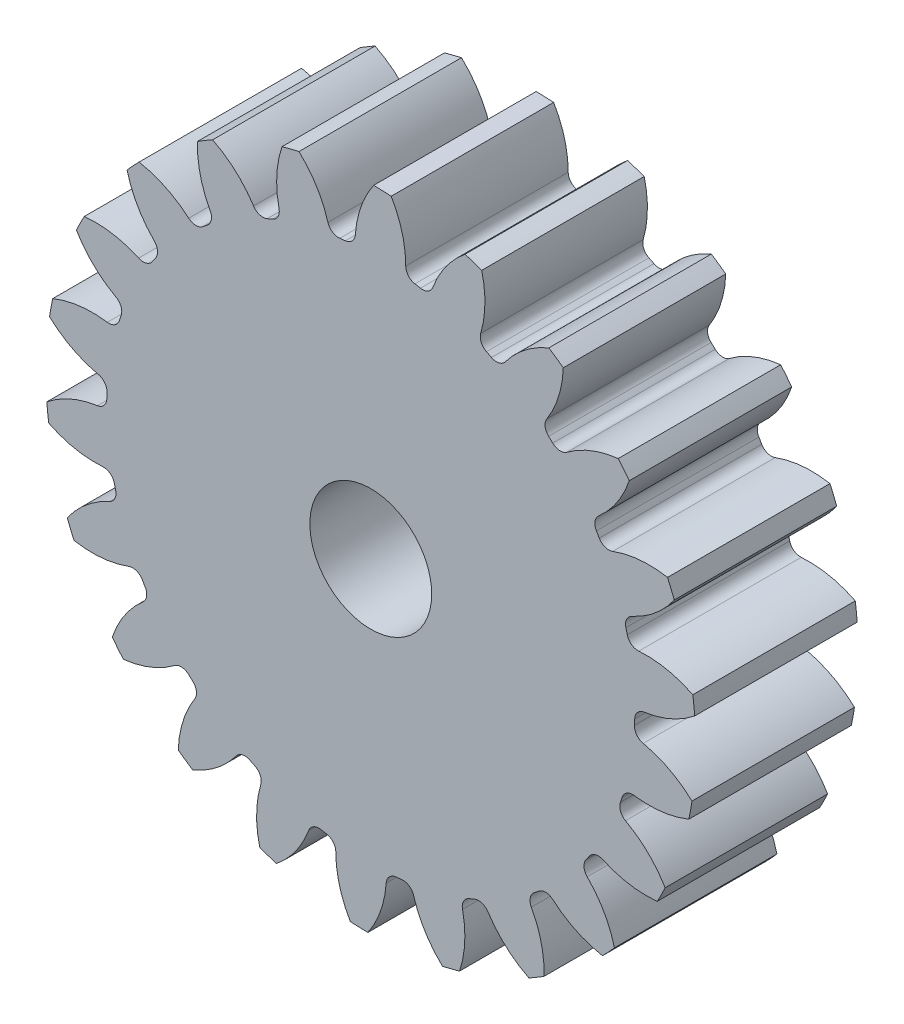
ISO-10303-21;
HEADER;
FILE_DESCRIPTION(('STEP AP214'),'2;1');
FILE_NAME('part.step','',(''),(''),'','','');
FILE_SCHEMA(('AUTOMOTIVE_DESIGN { 1 0 10303 214 1 1 1 1 }'));
ENDSEC;
DATA;
#1=APPLICATION_CONTEXT('core data for automotive mechanical design processes');
#2=APPLICATION_PROTOCOL_DEFINITION('international standard','automotive_design',2000,#1);
#3=PRODUCT_CONTEXT('',#1,'mechanical');
#4=PRODUCT('Part','Part','',(#3));
#5=PRODUCT_RELATED_PRODUCT_CATEGORY('part','',(#4));
#6=PRODUCT_DEFINITION_FORMATION('','',#4);
#7=PRODUCT_DEFINITION_CONTEXT('part definition',#1,'design');
#8=PRODUCT_DEFINITION('design','',#6,#7);
#9=PRODUCT_DEFINITION_SHAPE('','',#8);
#10=(LENGTH_UNIT() NAMED_UNIT(*) SI_UNIT(.MILLI.,.METRE.));
#11=(NAMED_UNIT(*) PLANE_ANGLE_UNIT() SI_UNIT($,.RADIAN.));
#12=(NAMED_UNIT(*) SI_UNIT($,.STERADIAN.) SOLID_ANGLE_UNIT());
#13=UNCERTAINTY_MEASURE_WITH_UNIT(LENGTH_MEASURE(1.E-05),#10,'distance_accuracy_value','');
#14=(GEOMETRIC_REPRESENTATION_CONTEXT(3) GLOBAL_UNCERTAINTY_ASSIGNED_CONTEXT((#13)) GLOBAL_UNIT_ASSIGNED_CONTEXT((#10,
#11,#12)) REPRESENTATION_CONTEXT('',''));
#15=CARTESIAN_POINT('',(0.,0.,0.));
#16=DIRECTION('',(0.,0.,1.));
#17=DIRECTION('',(1.,0.,0.));
#18=AXIS2_PLACEMENT_3D('',#15,#16,#17);
#19=CARTESIAN_POINT('',(0.,0.,101.6));
#20=DIRECTION('',(0.,0.,-1.));
#21=DIRECTION('',(-1.,0.,0.));
#22=AXIS2_PLACEMENT_3D('',#19,#20,#21);
#23=CYLINDRICAL_SURFACE('',#22,203.2);
#24=DIRECTION('',(0.,0.,-1.));
#25=VECTOR('',#24,1.);
#26=CARTESIAN_POINT('',(201.378460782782,27.1469249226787,50.8));
#27=LINE('',#26,#25);
#28=CARTESIAN_POINT('',(201.378460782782,27.1469249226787,101.6));
#29=VERTEX_POINT('',#28);
#30=CARTESIAN_POINT('',(201.378460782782,27.1469249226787,0.));
#31=VERTEX_POINT('',#30);
#32=EDGE_CURVE('E888',#29,#31,#27,.T.);
#33=ORIENTED_EDGE('',*,*,#32,.F.);
#34=CARTESIAN_POINT('',(0.,0.,101.6));
#35=DIRECTION('',(0.,0.,1.));
#36=DIRECTION('',(1.,0.,0.));
#37=AXIS2_PLACEMENT_3D('',#34,#35,#36);
#38=CIRCLE('',#37,203.2);
#39=CARTESIAN_POINT('',(202.551874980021,16.216594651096,101.6));
#40=VERTEX_POINT('',#39);
#41=EDGE_CURVE('E1685',#40,#29,#38,.T.);
#42=ORIENTED_EDGE('',*,*,#41,.F.);
#43=DIRECTION('',(0.,0.,-1.));
#44=VECTOR('',#43,1.);
#45=CARTESIAN_POINT('',(202.551874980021,16.216594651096,50.8));
#46=LINE('',#45,#44);
#47=CARTESIAN_POINT('',(202.551874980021,16.216594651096,0.));
#48=VERTEX_POINT('',#47);
#49=EDGE_CURVE('E1679',#48,#40,#46,.F.);
#50=ORIENTED_EDGE('',*,*,#49,.F.);
#51=CARTESIAN_POINT('',(0.,0.,0.));
#52=DIRECTION('',(0.,0.,1.));
#53=DIRECTION('',(1.,0.,0.));
#54=AXIS2_PLACEMENT_3D('',#51,#52,#53);
#55=CIRCLE('',#54,203.2);
#56=EDGE_CURVE('E1690',#48,#31,#55,.T.);
#57=ORIENTED_EDGE('',*,*,#56,.T.);
#58=EDGE_LOOP('',(#33,#42,#50,#57));
#59=FACE_BOUND('',#58,.T.);
#60=ADVANCED_FACE('F33',(#59),#23,.T.);
#61=DIRECTION('',(0.,0.,-1.));
#62=VECTOR('',#61,1.);
#63=CARTESIAN_POINT('',(189.778358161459,72.6251662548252,50.8));
#64=LINE('',#63,#62);
#65=CARTESIAN_POINT('',(189.778358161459,72.6251662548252,0.));
#66=VERTEX_POINT('',#65);
#67=CARTESIAN_POINT('',(189.778358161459,72.6251662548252,101.6));
#68=VERTEX_POINT('',#67);
#69=EDGE_CURVE('E859',#66,#68,#64,.F.);
#70=ORIENTED_EDGE('',*,*,#69,.F.);
#71=CARTESIAN_POINT('',(185.573045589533,82.7821523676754,0.));
#72=VERTEX_POINT('',#71);
#73=EDGE_CURVE('E1693',#66,#72,#55,.T.);
#74=ORIENTED_EDGE('',*,*,#73,.T.);
#75=DIRECTION('',(0.,0.,-1.));
#76=VECTOR('',#75,1.);
#77=CARTESIAN_POINT('',(185.573045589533,82.7821523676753,50.8));
#78=LINE('',#77,#76);
#79=CARTESIAN_POINT('',(185.573045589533,82.7821523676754,101.6));
#80=VERTEX_POINT('',#79);
#81=EDGE_CURVE('E921',#80,#72,#78,.T.);
#82=ORIENTED_EDGE('',*,*,#81,.F.);
#83=EDGE_CURVE('E1688',#68,#80,#38,.T.);
#84=ORIENTED_EDGE('',*,*,#83,.F.);
#85=EDGE_LOOP('',(#70,#74,#82,#84));
#86=FACE_BOUND('',#85,.T.);
#87=ADVANCED_FACE('F1941',(#86),#23,.T.);
#88=CARTESIAN_POINT('',(0.,0.,101.6));
#89=DIRECTION('',(0.,0.,1.));
#90=DIRECTION('',(1.,0.,0.));
#91=AXIS2_PLACEMENT_3D('',#88,#89,#90);
#92=PLANE('',#91);
#93=CARTESIAN_POINT('',(0.,0.,101.599999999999));
#94=DIRECTION('',(0.,0.,1.));
#95=DIRECTION('',(1.,0.,0.));
#96=AXIS2_PLACEMENT_3D('',#93,#94,#95);
#97=CIRCLE('',#96,38.1);
#98=CARTESIAN_POINT('',(38.1,0.,101.599999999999));
#99=VERTEX_POINT('',#98);
#100=EDGE_CURVE('E876',#99,#99,#97,.T.);
#101=ORIENTED_EDGE('',*,*,#100,.F.);
#102=EDGE_LOOP('',(#101));
#103=FACE_BOUND('',#102,.T.);
#104=ORIENTED_EDGE('',*,*,#41,.T.);
#105=CARTESIAN_POINT('',(172.242676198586,-31.1312683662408,101.6));
#106=DIRECTION('',(0.,0.,-1.));
#107=DIRECTION('',(0.959492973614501,0.281732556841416,0.));
#108=AXIS2_PLACEMENT_3D('',#105,#106,#107);
#109=CIRCLE('',#108,65.1555197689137);
#110=CARTESIAN_POINT('',(167.591053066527,33.8579935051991,101.6));
#111=VERTEX_POINT('',#110);
#112=EDGE_CURVE('E868',#111,#29,#109,.T.);
#113=ORIENTED_EDGE('',*,*,#112,.F.);
#114=CARTESIAN_POINT('',(167.099024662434,40.7322741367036,101.6));
#115=DIRECTION('',(0.,0.,1.));
#116=DIRECTION('',(-0.959492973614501,-0.281732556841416,0.));
#117=AXIS2_PLACEMENT_3D('',#114,#115,#116);
#118=CIRCLE('',#117,6.89186666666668);
#119=CARTESIAN_POINT('',(160.403218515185,39.100095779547,101.6));
#120=VERTEX_POINT('',#119);
#121=EDGE_CURVE('E866',#120,#111,#118,.T.);
#122=ORIENTED_EDGE('',*,*,#121,.F.);
#123=CARTESIAN_POINT('',(0.,0.,101.6));
#124=DIRECTION('',(0.,0.,-1.));
#125=DIRECTION('',(0.959492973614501,0.281732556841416,0.));
#126=AXIS2_PLACEMENT_3D('',#123,#124,#125);
#127=CIRCLE('',#126,165.1);
#128=CARTESIAN_POINT('',(159.534432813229,42.5061730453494,101.6));
#129=VERTEX_POINT('',#128);
#130=EDGE_CURVE('E851',#129,#120,#127,.T.);
#131=ORIENTED_EDGE('',*,*,#130,.F.);
#132=CARTESIAN_POINT('',(166.193972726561,44.2805332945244,101.6));
#133=DIRECTION('',(0.,0.,1.));
#134=DIRECTION('',(-0.959492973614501,-0.281732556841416,0.));
#135=AXIS2_PLACEMENT_3D('',#132,#133,#134);
#136=CIRCLE('',#135,6.89186666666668);
#137=CARTESIAN_POINT('',(163.333272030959,50.5506383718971,101.6));
#138=VERTEX_POINT('',#137);
#139=EDGE_CURVE('E843',#138,#129,#136,.T.);
#140=ORIENTED_EDGE('',*,*,#139,.F.);
#141=CARTESIAN_POINT('',(136.288285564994,109.8280410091,101.6));
#142=DIRECTION('',(0.,0.,-1.));
#143=DIRECTION('',(-0.959492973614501,-0.281732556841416,0.));
#144=AXIS2_PLACEMENT_3D('',#141,#142,#143);
#145=CIRCLE('',#144,65.1555197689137);
#146=EDGE_CURVE('E873',#68,#138,#145,.T.);
#147=ORIENTED_EDGE('',*,*,#146,.F.);
#148=ORIENTED_EDGE('',*,*,#83,.T.);
#149=CARTESIAN_POINT('',(174.036329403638,18.656136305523,101.6));
#150=DIRECTION('',(0.,0.,-1.));
#151=DIRECTION('',(0.841253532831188,0.540640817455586,0.));
#152=AXIS2_PLACEMENT_3D('',#149,#150,#151);
#153=CIRCLE('',#152,65.1555197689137);
#154=CARTESIAN_POINT('',(151.263538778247,79.7023627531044,101.6));
#155=VERTEX_POINT('',#154);
#156=EDGE_CURVE('E897',#155,#80,#153,.T.);
#157=ORIENTED_EDGE('',*,*,#156,.F.);
#158=CARTESIAN_POINT('',(148.854732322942,86.1595662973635,101.6));
#159=DIRECTION('',(0.,0.,1.));
#160=DIRECTION('',(-0.841253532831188,-0.540640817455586,0.));
#161=AXIS2_PLACEMENT_3D('',#158,#159,#160);
#162=CIRCLE('',#161,6.89186666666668);
#163=CARTESIAN_POINT('',(142.889991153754,82.707076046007,101.6));
#164=VERTEX_POINT('',#163);
#165=EDGE_CURVE('E895',#164,#155,#162,.T.);
#166=ORIENTED_EDGE('',*,*,#165,.F.);
#167=CARTESIAN_POINT('',(0.,0.,101.6));
#168=DIRECTION('',(0.,0.,-1.));
#169=DIRECTION('',(0.841253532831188,0.540640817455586,0.));
#170=AXIS2_PLACEMENT_3D('',#167,#168,#169);
#171=CIRCLE('',#170,165.1);
#172=CARTESIAN_POINT('',(141.096794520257,85.7304180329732,101.6));
#173=VERTEX_POINT('',#172);
#174=EDGE_CURVE('E892',#173,#164,#171,.T.);
#175=ORIENTED_EDGE('',*,*,#174,.F.);
#176=CARTESIAN_POINT('',(146.986681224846,89.3091134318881,101.6));
#177=DIRECTION('',(0.,0.,1.));
#178=DIRECTION('',(-0.841253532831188,-0.540640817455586,0.));
#179=AXIS2_PLACEMENT_3D('',#176,#177,#178);
#180=CIRCLE('',#179,6.89186666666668);
#181=CARTESIAN_POINT('',(142.47536627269,94.5192826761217,101.6));
#182=VERTEX_POINT('',#181);
#183=EDGE_CURVE('E890',#182,#173,#180,.T.);
#184=ORIENTED_EDGE('',*,*,#183,.F.);
#185=CARTESIAN_POINT('',(99.8255175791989,143.776080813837,101.6));
#186=DIRECTION('',(0.,0.,-1.));
#187=DIRECTION('',(-0.841253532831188,-0.540640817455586,0.));
#188=AXIS2_PLACEMENT_3D('',#185,#186,#187);
#189=CIRCLE('',#188,65.1555197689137);
#190=CARTESIAN_POINT('',(161.630127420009,123.150078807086,101.6));
#191=VERTEX_POINT('',#190);
#192=EDGE_CURVE('E900',#191,#182,#189,.T.);
#193=ORIENTED_EDGE('',*,*,#192,.F.);
#194=CARTESIAN_POINT('',(154.733605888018,131.71086215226,101.6));
#195=VERTEX_POINT('',#194);
#196=EDGE_CURVE('E1745',#191,#195,#38,.T.);
#197=ORIENTED_EDGE('',*,*,#196,.T.);
#198=CARTESIAN_POINT('',(161.730594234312,66.9321317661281,101.6));
#199=DIRECTION('',(0.,0.,-1.));
#200=DIRECTION('',(0.654860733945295,0.75574957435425,0.));
#201=AXIS2_PLACEMENT_3D('',#198,#199,#200);
#202=CIRCLE('',#201,65.1555197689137);
#203=CARTESIAN_POINT('',(122.681552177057,119.089720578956,101.6));
#204=VERTEX_POINT('',#203);
#205=EDGE_CURVE('E932',#204,#195,#202,.T.);
#206=ORIENTED_EDGE('',*,*,#205,.F.);
#207=CARTESIAN_POINT('',(118.551114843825,124.606722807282,101.6));
#208=DIRECTION('',(0.,0.,1.));
#209=DIRECTION('',(-0.654860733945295,-0.75574957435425,0.));
#210=AXIS2_PLACEMENT_3D('',#207,#208,#209);
#211=CIRCLE('',#210,6.89186666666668);
#212=CARTESIAN_POINT('',(113.800666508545,119.61362088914,101.6));
#213=VERTEX_POINT('',#212);
#214=EDGE_CURVE('E930',#213,#204,#211,.T.);
#215=ORIENTED_EDGE('',*,*,#214,.F.);
#216=CARTESIAN_POINT('',(0.,0.,101.6));
#217=DIRECTION('',(0.,0.,-1.));
#218=DIRECTION('',(0.654860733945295,0.75574957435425,0.));
#219=AXIS2_PLACEMENT_3D('',#216,#217,#218);
#220=CIRCLE('',#219,165.1);
#221=CARTESIAN_POINT('',(111.228333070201,122.009294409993,101.6));
#222=VERTEX_POINT('',#221);
#223=EDGE_CURVE('E927',#222,#213,#220,.T.);
#224=ORIENTED_EDGE('',*,*,#223,.F.);
#225=CARTESIAN_POINT('',(115.871402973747,127.102400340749,101.6));
#226=DIRECTION('',(0.,0.,1.));
#227=DIRECTION('',(-0.654860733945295,-0.75574957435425,0.));
#228=AXIS2_PLACEMENT_3D('',#225,#226,#227);
#229=CIRCLE('',#228,6.89186666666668);
#230=CARTESIAN_POINT('',(110.074953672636,130.830536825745,101.6));
#231=VERTEX_POINT('',#230);
#232=EDGE_CURVE('E925',#231,#222,#229,.T.);
#233=ORIENTED_EDGE('',*,*,#232,.F.);
#234=CARTESIAN_POINT('',(55.2754798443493,166.076237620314,101.6));
#235=DIRECTION('',(0.,0.,-1.));
#236=DIRECTION('',(-0.654860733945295,-0.75574957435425,0.));
#237=AXIS2_PLACEMENT_3D('',#234,#235,#236);
#238=CIRCLE('',#237,65.1555197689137);
#239=CARTESIAN_POINT('',(120.387585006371,163.698104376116,101.6));
#240=VERTEX_POINT('',#239);
#241=EDGE_CURVE('E935',#240,#231,#238,.T.);
#242=ORIENTED_EDGE('',*,*,#241,.F.);
#243=CARTESIAN_POINT('',(111.358569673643,169.969141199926,101.6));
#244=VERTEX_POINT('',#243);
#245=EDGE_CURVE('E1923',#240,#244,#38,.T.);
#246=ORIENTED_EDGE('',*,*,#245,.T.);
#247=CARTESIAN_POINT('',(136.322408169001,109.785683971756,101.6));
#248=DIRECTION('',(0.,0.,-1.));
#249=DIRECTION('',(0.415415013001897,0.909631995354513,0.));
#250=AXIS2_PLACEMENT_3D('',#247,#248,#249);
#251=CIRCLE('',#250,65.1555197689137);
#252=CARTESIAN_POINT('',(84.1606358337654,148.829137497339,101.6));
#253=VERTEX_POINT('',#252);
#254=EDGE_CURVE('E970',#253,#244,#251,.T.);
#255=ORIENTED_EDGE('',*,*,#254,.F.);
#256=CARTESIAN_POINT('',(78.6431910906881,152.958983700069,101.6));
#257=DIRECTION('',(0.,0.,1.));
#258=DIRECTION('',(-0.415415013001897,-0.909631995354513,0.));
#259=AXIS2_PLACEMENT_3D('',#256,#257,#258);
#260=CIRCLE('',#259,6.89186666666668);
#261=CARTESIAN_POINT('',(75.4918886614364,146.82978153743,101.6));
#262=VERTEX_POINT('',#261);
#263=EDGE_CURVE('E968',#262,#253,#260,.T.);
#264=ORIENTED_EDGE('',*,*,#263,.F.);
#265=CARTESIAN_POINT('',(0.,0.,101.6));
#266=DIRECTION('',(0.,0.,-1.));
#267=DIRECTION('',(0.415415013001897,0.909631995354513,0.));
#268=AXIS2_PLACEMENT_3D('',#265,#266,#267);
#269=CIRCLE('',#268,165.1);
#270=CARTESIAN_POINT('',(72.3488135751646,148.403703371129,101.6));
#271=VERTEX_POINT('',#270);
#272=EDGE_CURVE('E965',#271,#262,#269,.T.);
#273=ORIENTED_EDGE('',*,*,#272,.F.);
#274=CARTESIAN_POINT('',(75.3689127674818,154.598606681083,101.6));
#275=DIRECTION('',(0.,0.,1.));
#276=DIRECTION('',(-0.415415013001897,-0.909631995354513,0.));
#277=AXIS2_PLACEMENT_3D('',#274,#275,#276);
#278=CIRCLE('',#277,6.89186666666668);
#279=CARTESIAN_POINT('',(68.7569229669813,156.542678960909,101.6));
#280=VERTEX_POINT('',#279);
#281=EDGE_CURVE('E963',#280,#271,#278,.T.);
#282=ORIENTED_EDGE('',*,*,#281,.F.);
#283=CARTESIAN_POINT('',(6.247351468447,174.921885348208,101.6));
#284=DIRECTION('',(0.,0.,-1.));
#285=DIRECTION('',(-0.415415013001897,-0.909631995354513,0.));
#286=AXIS2_PLACEMENT_3D('',#283,#284,#285);
#287=CIRCLE('',#286,65.1555197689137);
#288=CARTESIAN_POINT('',(69.3919564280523,190.984283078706,101.6));
#289=VERTEX_POINT('',#288);
#290=EDGE_CURVE('E973',#289,#280,#287,.T.);
#291=ORIENTED_EDGE('',*,*,#290,.F.);
#292=CARTESIAN_POINT('',(58.9619244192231,194.457531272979,101.6));
#293=VERTEX_POINT('',#292);
#294=EDGE_CURVE('E1919',#289,#293,#38,.T.);
#295=ORIENTED_EDGE('',*,*,#294,.T.);
#296=CARTESIAN_POINT('',(99.8701913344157,143.745052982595,101.6));
#297=DIRECTION('',(0.,0.,-1.));
#298=DIRECTION('',(0.142314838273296,0.989821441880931,0.));
#299=AXIS2_PLACEMENT_3D('',#296,#297,#298);
#300=CIRCLE('',#299,65.1555197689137);
#301=CARTESIAN_POINT('',(38.8215252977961,166.51130281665,101.6));
#302=VERTEX_POINT('',#301);
#303=EDGE_CURVE('E1008',#302,#293,#300,.T.);
#304=ORIENTED_EDGE('',*,*,#303,.F.);
#305=CARTESIAN_POINT('',(32.3640637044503,168.919417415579,101.6));
#306=DIRECTION('',(0.,0.,1.));
#307=DIRECTION('',(-0.142314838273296,-0.989821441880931,0.));
#308=AXIS2_PLACEMENT_3D('',#305,#306,#307);
#309=CIRCLE('',#308,6.89186666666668);
#310=CARTESIAN_POINT('',(31.0672069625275,162.15066651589,101.6));
#311=VERTEX_POINT('',#310);
#312=EDGE_CURVE('E1006',#311,#302,#309,.T.);
#313=ORIENTED_EDGE('',*,*,#312,.F.);
#314=CARTESIAN_POINT('',(0.,0.,101.6));
#315=DIRECTION('',(0.,0.,-1.));
#316=DIRECTION('',(0.142314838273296,0.989821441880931,0.));
#317=AXIS2_PLACEMENT_3D('',#314,#315,#316);
#318=CIRCLE('',#317,165.1);
#319=CARTESIAN_POINT('',(27.6080234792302,162.775326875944,101.6));
#320=VERTEX_POINT('',#319);
#321=EDGE_CURVE('E1003',#320,#311,#318,.T.);
#322=ORIENTED_EDGE('',*,*,#321,.F.);
#323=CARTESIAN_POINT('',(28.7604814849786,169.570153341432,101.6));
#324=DIRECTION('',(0.,0.,1.));
#325=DIRECTION('',(-0.142314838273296,-0.989821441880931,0.));
#326=AXIS2_PLACEMENT_3D('',#323,#324,#325);
#327=CIRCLE('',#326,6.89186666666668);
#328=CARTESIAN_POINT('',(21.8686152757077,169.572664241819,101.6));
#329=VERTEX_POINT('',#328);
#330=EDGE_CURVE('E1001',#329,#320,#327,.T.);
#331=ORIENTED_EDGE('',*,*,#330,.F.);
#332=CARTESIAN_POINT('',(-43.2869001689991,169.596402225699,101.6));
#333=DIRECTION('',(0.,0.,-1.));
#334=DIRECTION('',(-0.142314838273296,-0.989821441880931,0.));
#335=AXIS2_PLACEMENT_3D('',#332,#333,#334);
#336=CIRCLE('',#335,65.1555197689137);
#337=CARTESIAN_POINT('',(12.7746042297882,202.798050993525,101.6));
#338=VERTEX_POINT('',#337);
#339=EDGE_CURVE('E1011',#338,#329,#336,.T.);
#340=ORIENTED_EDGE('',*,*,#339,.F.);
#341=CARTESIAN_POINT('',(1.7885347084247,203.192128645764,101.6));
#342=VERTEX_POINT('',#341);
#343=EDGE_CURVE('E1915',#338,#342,#38,.T.);
#344=ORIENTED_EDGE('',*,*,#343,.T.);
#345=CARTESIAN_POINT('',(55.3270855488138,166.059052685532,101.6));
#346=DIRECTION('',(0.,0.,-1.));
#347=DIRECTION('',(-0.142314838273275,0.989821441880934,0.));
#348=AXIS2_PLACEMENT_3D('',#345,#346,#347);
#349=CIRCLE('',#348,65.1555197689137);
#350=CARTESIAN_POINT('',(-9.6626743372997,170.703712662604,101.6));
#351=VERTEX_POINT('',#350);
#352=EDGE_CURVE('E1046',#351,#342,#349,.T.);
#353=ORIENTED_EDGE('',*,*,#352,.F.);
#354=CARTESIAN_POINT('',(-16.5370076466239,171.195004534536,101.6));
#355=DIRECTION('',(0.,0.,1.));
#356=DIRECTION('',(0.142314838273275,-0.989821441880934,0.));
#357=AXIS2_PLACEMENT_3D('',#354,#355,#356);
#358=CIRCLE('',#357,6.89186666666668);
#359=CARTESIAN_POINT('',(-15.8743550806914,164.335068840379,101.6));
#360=VERTEX_POINT('',#359);
#361=EDGE_CURVE('E1044',#360,#351,#358,.T.);
#362=ORIENTED_EDGE('',*,*,#361,.F.);
#363=CARTESIAN_POINT('',(0.,0.,101.6));
#364=DIRECTION('',(0.,0.,-1.));
#365=DIRECTION('',(-0.142314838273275,0.989821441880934,0.));
#366=AXIS2_PLACEMENT_3D('',#363,#364,#365);
#367=CIRCLE('',#366,165.1);
#368=CARTESIAN_POINT('',(-19.3694044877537,163.959861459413,101.6));
#369=VERTEX_POINT('',#368);
#370=EDGE_CURVE('E1041',#369,#360,#367,.T.);
#371=ORIENTED_EDGE('',*,*,#370,.F.);
#372=CARTESIAN_POINT('',(-20.1779529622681,170.80413465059,101.6));
#373=DIRECTION('',(0.,0.,1.));
#374=DIRECTION('',(0.142314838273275,-0.989821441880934,0.));
#375=AXIS2_PLACEMENT_3D('',#372,#373,#374);
#376=CIRCLE('',#375,6.89186666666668);
#377=CARTESIAN_POINT('',(-26.7913575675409,168.864880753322,101.6));
#378=VERTEX_POINT('',#377);
#379=EDGE_CURVE('E1039',#378,#369,#376,.T.);
#380=ORIENTED_EDGE('',*,*,#379,.F.);
#381=CARTESIAN_POINT('',(-89.3143045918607,150.531227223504,101.6));
#382=DIRECTION('',(0.,0.,-1.));
#383=DIRECTION('',(0.142314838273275,-0.989821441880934,0.));
#384=AXIS2_PLACEMENT_3D('',#381,#382,#383);
#385=CIRCLE('',#384,65.1555197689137);
#386=CARTESIAN_POINT('',(-44.8776704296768,198.182326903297,101.6));
#387=VERTEX_POINT('',#386);
#388=EDGE_CURVE('E1049',#387,#378,#385,.T.);
#389=ORIENTED_EDGE('',*,*,#388,.F.);
#390=CARTESIAN_POINT('',(-55.5297514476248,195.465308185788,101.6));
#391=VERTEX_POINT('',#390);
#392=EDGE_CURVE('E1911',#387,#391,#38,.T.);
#393=ORIENTED_EDGE('',*,*,#392,.T.);
#394=CARTESIAN_POINT('',(6.30170833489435,174.919935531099,101.6));
#395=DIRECTION('',(0.,0.,-1.));
#396=DIRECTION('',(-0.415415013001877,0.909631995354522,0.));
#397=AXIS2_PLACEMENT_3D('',#394,#395,#396);
#398=CIRCLE('',#397,65.1555197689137);
#399=CARTESIAN_POINT('',(-57.3640615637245,161.066722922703,101.6));
#400=VERTEX_POINT('',#399);
#401=EDGE_CURVE('E1084',#400,#391,#398,.T.);
#402=ORIENTED_EDGE('',*,*,#401,.F.);
#403=CARTESIAN_POINT('',(-64.0983489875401,159.601390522,101.6));
#404=DIRECTION('',(0.,0.,1.));
#405=DIRECTION('',(0.415415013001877,-0.909631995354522,0.));
#406=AXIS2_PLACEMENT_3D('',#403,#404,#405);
#407=CIRCLE('',#406,6.89186666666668);
#408=CARTESIAN_POINT('',(-61.5298712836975,153.206021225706,101.6));
#409=VERTEX_POINT('',#408);
#410=EDGE_CURVE('E1082',#409,#400,#407,.T.);
#411=ORIENTED_EDGE('',*,*,#410,.F.);
#412=CARTESIAN_POINT('',(0.,0.,101.6));
#413=DIRECTION('',(0.,0.,-1.));
#414=DIRECTION('',(-0.415415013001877,0.909631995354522,0.));
#415=AXIS2_PLACEMENT_3D('',#412,#413,#414);
#416=CIRCLE('',#415,165.1);
#417=CARTESIAN_POINT('',(-64.7776384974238,151.861343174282,101.6));
#418=VERTEX_POINT('',#417);
#419=EDGE_CURVE('E1079',#418,#409,#416,.T.);
#420=ORIENTED_EDGE('',*,*,#419,.F.);
#421=CARTESIAN_POINT('',(-67.4816896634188,158.20058078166,101.6));
#422=DIRECTION('',(0.,0.,1.));
#423=DIRECTION('',(0.415415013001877,-0.909631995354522,0.));
#424=AXIS2_PLACEMENT_3D('',#421,#422,#423);
#425=CIRCLE('',#424,6.89186666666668);
#426=CARTESIAN_POINT('',(-73.2808539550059,154.476668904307,101.6));
#427=VERTEX_POINT('',#426);
#428=EDGE_CURVE('E1077',#427,#418,#425,.T.);
#429=ORIENTED_EDGE('',*,*,#428,.F.);
#430=CARTESIAN_POINT('',(-128.105995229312,119.270907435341,101.6));
#431=DIRECTION('',(0.,0.,-1.));
#432=DIRECTION('',(0.415415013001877,-0.909631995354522,0.));
#433=AXIS2_PLACEMENT_3D('',#430,#431,#432);
#434=CIRCLE('',#433,65.1555197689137);
#435=CARTESIAN_POINT('',(-98.894223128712,177.511049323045,101.6));
#436=VERTEX_POINT('',#435);
#437=EDGE_CURVE('E1087',#436,#427,#434,.T.);
#438=ORIENTED_EDGE('',*,*,#437,.F.);
#439=CARTESIAN_POINT('',(-108.349347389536,171.903050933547,101.6));
#440=VERTEX_POINT('',#439);
#441=EDGE_CURVE('E1907',#436,#440,#38,.T.);
#442=ORIENTED_EDGE('',*,*,#441,.T.);
#443=CARTESIAN_POINT('',(-43.2341958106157,169.609845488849,101.6));
#444=DIRECTION('',(0.,0.,-1.));
#445=DIRECTION('',(-0.654860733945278,0.755749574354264,0.));
#446=AXIS2_PLACEMENT_3D('',#443,#444,#445);
#447=CIRCLE('',#446,65.1555197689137);
#448=CARTESIAN_POINT('',(-100.418153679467,138.38106519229,101.6));
#449=VERTEX_POINT('',#448);
#450=EDGE_CURVE('E1122',#449,#440,#447,.T.);
#451=ORIENTED_EDGE('',*,*,#450,.F.);
#452=CARTESIAN_POINT('',(-106.466823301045,135.077821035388,101.6));
#453=DIRECTION('',(0.,0.,1.));
#454=DIRECTION('',(0.654860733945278,-0.755749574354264,0.));
#455=AXIS2_PLACEMENT_3D('',#452,#453,#454);
#456=CIRCLE('',#455,6.89186666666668);
#457=CARTESIAN_POINT('',(-102.200603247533,129.665132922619,101.6));
#458=VERTEX_POINT('',#457);
#459=EDGE_CURVE('E1120',#458,#449,#456,.T.);
#460=ORIENTED_EDGE('',*,*,#459,.F.);
#461=CARTESIAN_POINT('',(0.,0.,101.6));
#462=DIRECTION('',(0.,0.,-1.));
#463=DIRECTION('',(-0.654860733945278,0.755749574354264,0.));
#464=AXIS2_PLACEMENT_3D('',#461,#462,#463);
#465=CIRCLE('',#464,165.1);
#466=CARTESIAN_POINT('',(-104.937973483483,127.459922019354,101.6));
#467=VERTEX_POINT('',#466);
#468=EDGE_CURVE('E1117',#467,#458,#465,.T.);
#469=ORIENTED_EDGE('',*,*,#468,.F.);
#470=CARTESIAN_POINT('',(-109.318461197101,132.78055671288,101.6));
#471=DIRECTION('',(0.,0.,1.));
#472=DIRECTION('',(0.654860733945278,-0.755749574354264,0.));
#473=AXIS2_PLACEMENT_3D('',#470,#471,#472);
#474=CIRCLE('',#473,6.89186666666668);
#475=CARTESIAN_POINT('',(-113.833571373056,127.573676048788,101.6));
#476=VERTEX_POINT('',#475);
#477=EDGE_CURVE('E1115',#476,#467,#474,.T.);
#478=ORIENTED_EDGE('',*,*,#477,.F.);
#479=CARTESIAN_POINT('',(-156.519300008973,78.3479680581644,101.6));
#480=DIRECTION('',(0.,0.,-1.));
#481=DIRECTION('',(0.654860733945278,-0.755749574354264,0.));
#482=AXIS2_PLACEMENT_3D('',#479,#480,#481);
#483=CIRCLE('',#482,65.1555197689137);
#484=CARTESIAN_POINT('',(-144.89895401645,142.458882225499,101.6));
#485=VERTEX_POINT('',#484);
#486=EDGE_CURVE('E1125',#485,#476,#483,.T.);
#487=ORIENTED_EDGE('',*,*,#486,.F.);
#488=CARTESIAN_POINT('',(-152.391123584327,134.414230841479,101.6));
#489=VERTEX_POINT('',#488);
#490=EDGE_CURVE('E1903',#485,#489,#38,.T.);
#491=ORIENTED_EDGE('',*,*,#490,.T.);
#492=CARTESIAN_POINT('',(-89.2675225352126,150.558974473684,101.6));
#493=DIRECTION('',(0.,0.,-1.));
#494=DIRECTION('',(-0.841253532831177,0.540640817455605,0.));
#495=AXIS2_PLACEMENT_3D('',#492,#493,#494);
#496=CIRCLE('',#495,65.1555197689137);
#497=CARTESIAN_POINT('',(-135.336964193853,104.48459654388,101.6));
#498=VERTEX_POINT('',#497);
#499=EDGE_CURVE('E1160',#498,#489,#496,.T.);
#500=ORIENTED_EDGE('',*,*,#499,.F.);
#501=CARTESIAN_POINT('',(-140.209988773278,99.6110498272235,101.6));
#502=DIRECTION('',(0.,0.,1.));
#503=DIRECTION('',(0.841253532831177,-0.540640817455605,0.));
#504=AXIS2_PLACEMENT_3D('',#501,#502,#503);
#505=CIRCLE('',#504,6.89186666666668);
#506=CARTESIAN_POINT('',(-134.591650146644,95.6195466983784,101.6));
#507=VERTEX_POINT('',#506);
#508=EDGE_CURVE('E1158',#507,#498,#505,.T.);
#509=ORIENTED_EDGE('',*,*,#508,.F.);
#510=CARTESIAN_POINT('',(0.,0.,101.6));
#511=DIRECTION('',(0.,0.,-1.));
#512=DIRECTION('',(-0.841253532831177,0.540640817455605,0.));
#513=AXIS2_PLACEMENT_3D('',#510,#511,#512);
#514=CIRCLE('',#513,165.1);
#515=CARTESIAN_POINT('',(-136.596857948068,92.7324560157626,101.6));
#516=VERTEX_POINT('',#515);
#517=EDGE_CURVE('E1155',#516,#507,#514,.T.);
#518=ORIENTED_EDGE('',*,*,#517,.F.);
#519=CARTESIAN_POINT('',(-142.298901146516,96.6034416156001,101.6));
#520=DIRECTION('',(0.,0.,1.));
#521=DIRECTION('',(0.841253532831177,-0.540640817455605,0.));
#522=AXIS2_PLACEMENT_3D('',#519,#520,#521);
#523=CIRCLE('',#522,6.89186666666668);
#524=CARTESIAN_POINT('',(-145.164169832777,90.3354226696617,101.6));
#525=VERTEX_POINT('',#524);
#526=EDGE_CURVE('E1153',#525,#516,#523,.T.);
#527=ORIENTED_EDGE('',*,*,#526,.F.);
#528=CARTESIAN_POINT('',(-172.252341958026,31.0777422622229,101.6));
#529=DIRECTION('',(0.,0.,-1.));
#530=DIRECTION('',(0.841253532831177,-0.540640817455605,0.));
#531=AXIS2_PLACEMENT_3D('',#528,#529,#530);
#532=CIRCLE('',#531,65.1555197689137);
#533=CARTESIAN_POINT('',(-179.164833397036,95.8655437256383,101.6));
#534=VERTEX_POINT('',#533);
#535=EDGE_CURVE('E1163',#534,#525,#532,.T.);
#536=ORIENTED_EDGE('',*,*,#535,.F.);
#537=CARTESIAN_POINT('',(-184.087077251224,86.0359691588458,101.6));
#538=VERTEX_POINT('',#537);
#539=EDGE_CURVE('E1899',#534,#538,#38,.T.);
#540=ORIENTED_EDGE('',*,*,#539,.T.);
#541=CARTESIAN_POINT('',(-128.068925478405,119.310710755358,101.6));
#542=DIRECTION('',(0.,0.,-1.));
#543=DIRECTION('',(-0.959492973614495,0.281732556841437,0.));
#544=AXIS2_PLACEMENT_3D('',#541,#542,#543);
#545=CIRCLE('',#544,65.1555197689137);
#546=CARTESIAN_POINT('',(-159.291578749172,62.1234072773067,101.6));
#547=VERTEX_POINT('',#546);
#548=EDGE_CURVE('E1198',#547,#538,#545,.T.);
#549=ORIENTED_EDGE('',*,*,#548,.F.);
#550=CARTESIAN_POINT('',(-162.594174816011,56.0743837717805,101.6));
#551=DIRECTION('',(0.,0.,1.));
#552=DIRECTION('',(0.959492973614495,-0.281732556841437,0.));
#553=AXIS2_PLACEMENT_3D('',#550,#551,#552);
#554=CIRCLE('',#553,6.89186666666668);
#555=CARTESIAN_POINT('',(-156.078881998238,53.8274334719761,101.6));
#556=VERTEX_POINT('',#555);
#557=EDGE_CURVE('E1196',#556,#547,#554,.T.);
#558=ORIENTED_EDGE('',*,*,#557,.F.);
#559=CARTESIAN_POINT('',(0.,0.,101.6));
#560=DIRECTION('',(0.,0.,-1.));
#561=DIRECTION('',(-0.959492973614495,0.281732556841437,0.));
#562=AXIS2_PLACEMENT_3D('',#559,#560,#561);
#563=CIRCLE('',#562,165.1);
#564=CARTESIAN_POINT('',(-157.189477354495,50.4923579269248,101.6));
#565=VERTEX_POINT('',#564);
#566=EDGE_CURVE('E1193',#565,#556,#563,.T.);
#567=ORIENTED_EDGE('',*,*,#566,.F.);
#568=CARTESIAN_POINT('',(-163.75113040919,52.6000902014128,101.6));
#569=DIRECTION('',(0.,0.,1.));
#570=DIRECTION('',(0.959492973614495,-0.281732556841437,0.));
#571=AXIS2_PLACEMENT_3D('',#568,#569,#570);
#572=CIRCLE('',#571,6.89186666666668);
#573=CARTESIAN_POINT('',(-164.734430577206,45.7787305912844,101.6));
#574=VERTEX_POINT('',#573);
#575=EDGE_CURVE('E1191',#574,#565,#572,.T.);
#576=ORIENTED_EDGE('',*,*,#575,.F.);
#577=CARTESIAN_POINT('',(-174.030523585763,-18.7102173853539,101.6));
#578=DIRECTION('',(0.,0.,-1.));
#579=DIRECTION('',(0.959492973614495,-0.281732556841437,0.));
#580=AXIS2_PLACEMENT_3D('',#577,#578,#579);
#581=CIRCLE('',#580,65.1555197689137);
#582=CARTESIAN_POINT('',(-198.915843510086,41.5057490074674,101.6));
#583=VERTEX_POINT('',#582);
#584=EDGE_CURVE('E1201',#583,#574,#581,.T.);
#585=ORIENTED_EDGE('',*,*,#584,.F.);
#586=CARTESIAN_POINT('',(-200.869390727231,30.6875849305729,101.6));
#587=VERTEX_POINT('',#586);
#588=EDGE_CURVE('E1895',#583,#587,#38,.T.);
#589=ORIENTED_EDGE('',*,*,#588,.T.);
#590=CARTESIAN_POINT('',(-156.494945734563,78.3966028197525,101.6));
#591=DIRECTION('',(0.,0.,-1.));
#592=DIRECTION('',(-1.,0.,0.));
#593=AXIS2_PLACEMENT_3D('',#590,#591,#592);
#594=CIRCLE('',#593,65.1555197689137);
#595=CARTESIAN_POINT('',(-170.341336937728,14.7293490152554,101.6));
#596=VERTEX_POINT('',#595);
#597=EDGE_CURVE('E1236',#596,#587,#594,.T.);
#598=ORIENTED_EDGE('',*,*,#597,.F.);
#599=CARTESIAN_POINT('',(-171.805947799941,7.99490463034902,101.6));
#600=DIRECTION('',(0.,0.,1.));
#601=DIRECTION('',(1.,0.,0.));
#602=AXIS2_PLACEMENT_3D('',#599,#600,#601);
#603=CIRCLE('',#602,6.89186666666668);
#604=CARTESIAN_POINT('',(-164.921531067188,7.67454170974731,101.6));
#605=VERTEX_POINT('',#604);
#606=EDGE_CURVE('E1234',#605,#596,#603,.T.);
#607=ORIENTED_EDGE('',*,*,#606,.F.);
#608=CARTESIAN_POINT('',(0.,0.,101.6));
#609=DIRECTION('',(0.,0.,-1.));
#610=DIRECTION('',(-1.,0.,0.));
#611=AXIS2_PLACEMENT_3D('',#608,#609,#610);
#612=CIRCLE('',#611,165.1);
#613=CARTESIAN_POINT('',(-165.047540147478,4.16166928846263,101.6));
#614=VERTEX_POINT('',#613);
#615=EDGE_CURVE('E1231',#614,#605,#612,.T.);
#616=ORIENTED_EDGE('',*,*,#615,.F.);
#617=CARTESIAN_POINT('',(-171.937216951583,4.33539230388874,101.6));
#618=DIRECTION('',(0.,0.,1.));
#619=DIRECTION('',(1.,0.,0.));
#620=AXIS2_PLACEMENT_3D('',#617,#618,#619);
#621=CIRCLE('',#620,6.89186666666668);
#622=CARTESIAN_POINT('',(-170.958887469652,-2.48668198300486,101.6));
#623=VERTEX_POINT('',#622);
#624=EDGE_CURVE('E1229',#623,#614,#621,.T.);
#625=ORIENTED_EDGE('',*,*,#624,.F.);
#626=CARTESIAN_POINT('',(-161.709787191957,-66.9823864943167,101.6));
#627=DIRECTION('',(0.,0.,-1.));
#628=DIRECTION('',(1.,0.,0.));
#629=AXIS2_PLACEMENT_3D('',#626,#627,#628);
#630=CIRCLE('',#629,65.1555197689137);
#631=CARTESIAN_POINT('',(-202.551874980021,-16.2165946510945,101.6));
#632=VERTEX_POINT('',#631);
#633=EDGE_CURVE('E1239',#632,#623,#630,.T.);
#634=ORIENTED_EDGE('',*,*,#633,.F.);
#635=CARTESIAN_POINT('',(-201.378460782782,-27.1469249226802,101.6));
#636=VERTEX_POINT('',#635);
#637=EDGE_CURVE('E1891',#632,#636,#38,.T.);
#638=ORIENTED_EDGE('',*,*,#637,.T.);
#639=CARTESIAN_POINT('',(-172.242676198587,31.1312683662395,101.6));
#640=DIRECTION('',(0.,0.,-1.));
#641=DIRECTION('',(-0.959492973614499,-0.281732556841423,0.));
#642=AXIS2_PLACEMENT_3D('',#639,#640,#641);
#643=CIRCLE('',#642,65.1555197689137);
#644=CARTESIAN_POINT('',(-167.591053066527,-33.8579935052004,101.6));
#645=VERTEX_POINT('',#644);
#646=EDGE_CURVE('E1274',#645,#636,#643,.T.);
#647=ORIENTED_EDGE('',*,*,#646,.F.);
#648=CARTESIAN_POINT('',(-167.099024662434,-40.7322741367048,101.6));
#649=DIRECTION('',(0.,0.,1.));
#650=DIRECTION('',(0.959492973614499,0.281732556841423,0.));
#651=AXIS2_PLACEMENT_3D('',#648,#649,#650);
#652=CIRCLE('',#651,6.89186666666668);
#653=CARTESIAN_POINT('',(-160.403218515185,-39.1000957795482,101.6));
#654=VERTEX_POINT('',#653);
#655=EDGE_CURVE('E1272',#654,#645,#652,.T.);
#656=ORIENTED_EDGE('',*,*,#655,.F.);
#657=CARTESIAN_POINT('',(0.,0.,101.6));
#658=DIRECTION('',(0.,0.,-1.));
#659=DIRECTION('',(-0.959492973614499,-0.281732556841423,0.));
#660=AXIS2_PLACEMENT_3D('',#657,#658,#659);
#661=CIRCLE('',#660,165.1);
#662=CARTESIAN_POINT('',(-159.534432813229,-42.5061730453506,101.6));
#663=VERTEX_POINT('',#662);
#664=EDGE_CURVE('E1269',#663,#654,#661,.T.);
#665=ORIENTED_EDGE('',*,*,#664,.F.);
#666=CARTESIAN_POINT('',(-166.193972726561,-44.2805332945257,101.6));
#667=DIRECTION('',(0.,0.,1.));
#668=DIRECTION('',(0.959492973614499,0.281732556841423,0.));
#669=AXIS2_PLACEMENT_3D('',#666,#667,#668);
#670=CIRCLE('',#669,6.89186666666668);
#671=CARTESIAN_POINT('',(-163.333272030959,-50.5506383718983,101.6));
#672=VERTEX_POINT('',#671);
#673=EDGE_CURVE('E1267',#672,#663,#670,.T.);
#674=ORIENTED_EDGE('',*,*,#673,.F.);
#675=CARTESIAN_POINT('',(-136.288285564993,-109.828041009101,101.6));
#676=DIRECTION('',(0.,0.,-1.));
#677=DIRECTION('',(0.959492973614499,0.281732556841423,0.));
#678=AXIS2_PLACEMENT_3D('',#675,#676,#677);
#679=CIRCLE('',#678,65.1555197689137);
#680=CARTESIAN_POINT('',(-189.778358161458,-72.6251662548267,101.6));
#681=VERTEX_POINT('',#680);
#682=EDGE_CURVE('E1277',#681,#672,#679,.T.);
#683=ORIENTED_EDGE('',*,*,#682,.F.);
#684=CARTESIAN_POINT('',(-185.573045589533,-82.7821523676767,101.6));
#685=VERTEX_POINT('',#684);
#686=EDGE_CURVE('E1887',#681,#685,#38,.T.);
#687=ORIENTED_EDGE('',*,*,#686,.T.);
#688=CARTESIAN_POINT('',(-174.036329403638,-18.6561363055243,101.6));
#689=DIRECTION('',(0.,0.,-1.));
#690=DIRECTION('',(-0.841253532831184,-0.540640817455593,0.));
#691=AXIS2_PLACEMENT_3D('',#688,#689,#690);
#692=CIRCLE('',#691,65.1555197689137);
#693=CARTESIAN_POINT('',(-151.263538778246,-79.7023627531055,101.6));
#694=VERTEX_POINT('',#693);
#695=EDGE_CURVE('E1312',#694,#685,#692,.T.);
#696=ORIENTED_EDGE('',*,*,#695,.F.);
#697=CARTESIAN_POINT('',(-148.854732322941,-86.1595662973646,101.6));
#698=DIRECTION('',(0.,0.,1.));
#699=DIRECTION('',(0.841253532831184,0.540640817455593,0.));
#700=AXIS2_PLACEMENT_3D('',#697,#698,#699);
#701=CIRCLE('',#700,6.89186666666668);
#702=CARTESIAN_POINT('',(-142.889991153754,-82.7070760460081,101.6));
#703=VERTEX_POINT('',#702);
#704=EDGE_CURVE('E1310',#703,#694,#701,.T.);
#705=ORIENTED_EDGE('',*,*,#704,.F.);
#706=CARTESIAN_POINT('',(0.,0.,101.6));
#707=DIRECTION('',(0.,0.,-1.));
#708=DIRECTION('',(-0.841253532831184,-0.540640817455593,0.));
#709=AXIS2_PLACEMENT_3D('',#706,#707,#708);
#710=CIRCLE('',#709,165.1);
#711=CARTESIAN_POINT('',(-141.096794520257,-85.7304180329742,101.6));
#712=VERTEX_POINT('',#711);
#713=EDGE_CURVE('E1307',#712,#703,#710,.T.);
#714=ORIENTED_EDGE('',*,*,#713,.F.);
#715=CARTESIAN_POINT('',(-146.986681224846,-89.3091134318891,101.6));
#716=DIRECTION('',(0.,0.,1.));
#717=DIRECTION('',(0.841253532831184,0.540640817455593,0.));
#718=AXIS2_PLACEMENT_3D('',#715,#716,#717);
#719=CIRCLE('',#718,6.89186666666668);
#720=CARTESIAN_POINT('',(-142.475366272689,-94.5192826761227,101.6));
#721=VERTEX_POINT('',#720);
#722=EDGE_CURVE('E1305',#721,#712,#719,.T.);
#723=ORIENTED_EDGE('',*,*,#722,.F.);
#724=CARTESIAN_POINT('',(-99.8255175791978,-143.776080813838,101.6));
#725=DIRECTION('',(0.,0.,-1.));
#726=DIRECTION('',(0.841253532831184,0.540640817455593,0.));
#727=AXIS2_PLACEMENT_3D('',#724,#725,#726);
#728=CIRCLE('',#727,65.1555197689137);
#729=CARTESIAN_POINT('',(-161.630127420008,-123.150078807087,101.6));
#730=VERTEX_POINT('',#729);
#731=EDGE_CURVE('E1315',#730,#721,#728,.T.);
#732=ORIENTED_EDGE('',*,*,#731,.F.);
#733=CARTESIAN_POINT('',(-154.733605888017,-131.710862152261,101.6));
#734=VERTEX_POINT('',#733);
#735=EDGE_CURVE('E1883',#730,#734,#38,.T.);
#736=ORIENTED_EDGE('',*,*,#735,.T.);
#737=CARTESIAN_POINT('',(-161.730594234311,-66.9321317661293,101.6));
#738=DIRECTION('',(0.,0.,-1.));
#739=DIRECTION('',(-0.654860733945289,-0.755749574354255,0.));
#740=AXIS2_PLACEMENT_3D('',#737,#738,#739);
#741=CIRCLE('',#740,65.1555197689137);
#742=CARTESIAN_POINT('',(-122.681552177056,-119.089720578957,101.6));
#743=VERTEX_POINT('',#742);
#744=EDGE_CURVE('E1350',#743,#734,#741,.T.);
#745=ORIENTED_EDGE('',*,*,#744,.F.);
#746=CARTESIAN_POINT('',(-118.551114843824,-124.606722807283,101.6));
#747=DIRECTION('',(0.,0.,1.));
#748=DIRECTION('',(0.654860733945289,0.755749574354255,0.));
#749=AXIS2_PLACEMENT_3D('',#746,#747,#748);
#750=CIRCLE('',#749,6.89186666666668);
#751=CARTESIAN_POINT('',(-113.800666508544,-119.613620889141,101.6));
#752=VERTEX_POINT('',#751);
#753=EDGE_CURVE('E1348',#752,#743,#750,.T.);
#754=ORIENTED_EDGE('',*,*,#753,.F.);
#755=CARTESIAN_POINT('',(0.,0.,101.6));
#756=DIRECTION('',(0.,0.,-1.));
#757=DIRECTION('',(-0.654860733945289,-0.755749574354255,0.));
#758=AXIS2_PLACEMENT_3D('',#755,#756,#757);
#759=CIRCLE('',#758,165.1);
#760=CARTESIAN_POINT('',(-111.2283330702,-122.009294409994,101.6));
#761=VERTEX_POINT('',#760);
#762=EDGE_CURVE('E1345',#761,#752,#759,.T.);
#763=ORIENTED_EDGE('',*,*,#762,.F.);
#764=CARTESIAN_POINT('',(-115.871402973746,-127.10240034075,101.6));
#765=DIRECTION('',(0.,0.,1.));
#766=DIRECTION('',(0.654860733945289,0.755749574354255,0.));
#767=AXIS2_PLACEMENT_3D('',#764,#765,#766);
#768=CIRCLE('',#767,6.89186666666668);
#769=CARTESIAN_POINT('',(-110.074953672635,-130.830536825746,101.6));
#770=VERTEX_POINT('',#769);
#771=EDGE_CURVE('E1343',#770,#761,#768,.T.);
#772=ORIENTED_EDGE('',*,*,#771,.F.);
#773=CARTESIAN_POINT('',(-55.2754798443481,-166.076237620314,101.6));
#774=DIRECTION('',(0.,0.,-1.));
#775=DIRECTION('',(0.654860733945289,0.755749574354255,0.));
#776=AXIS2_PLACEMENT_3D('',#773,#774,#775);
#777=CIRCLE('',#776,65.1555197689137);
#778=CARTESIAN_POINT('',(-120.38758500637,-163.698104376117,101.6));
#779=VERTEX_POINT('',#778);
#780=EDGE_CURVE('E1353',#779,#770,#777,.T.);
#781=ORIENTED_EDGE('',*,*,#780,.F.);
#782=CARTESIAN_POINT('',(-111.358569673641,-169.969141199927,101.6));
#783=VERTEX_POINT('',#782);
#784=EDGE_CURVE('E1879',#779,#783,#38,.T.);
#785=ORIENTED_EDGE('',*,*,#784,.T.);
#786=CARTESIAN_POINT('',(-136.322408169,-109.785683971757,101.6));
#787=DIRECTION('',(0.,0.,-1.));
#788=DIRECTION('',(-0.415415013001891,-0.909631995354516,0.));
#789=AXIS2_PLACEMENT_3D('',#786,#787,#788);
#790=CIRCLE('',#789,65.1555197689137);
#791=CARTESIAN_POINT('',(-84.1606358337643,-148.82913749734,101.6));
#792=VERTEX_POINT('',#791);
#793=EDGE_CURVE('E1388',#792,#783,#790,.T.);
#794=ORIENTED_EDGE('',*,*,#793,.F.);
#795=CARTESIAN_POINT('',(-78.6431910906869,-152.95898370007,101.6));
#796=DIRECTION('',(0.,0.,1.));
#797=DIRECTION('',(0.415415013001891,0.909631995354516,0.));
#798=AXIS2_PLACEMENT_3D('',#795,#796,#797);
#799=CIRCLE('',#798,6.89186666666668);
#800=CARTESIAN_POINT('',(-75.4918886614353,-146.82978153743,101.6));
#801=VERTEX_POINT('',#800);
#802=EDGE_CURVE('E1386',#801,#792,#799,.T.);
#803=ORIENTED_EDGE('',*,*,#802,.F.);
#804=CARTESIAN_POINT('',(0.,0.,101.6));
#805=DIRECTION('',(0.,0.,-1.));
#806=DIRECTION('',(-0.415415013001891,-0.909631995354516,0.));
#807=AXIS2_PLACEMENT_3D('',#804,#805,#806);
#808=CIRCLE('',#807,165.1);
#809=CARTESIAN_POINT('',(-72.3488135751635,-148.40370337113,101.6));
#810=VERTEX_POINT('',#809);
#811=EDGE_CURVE('E1383',#810,#801,#808,.T.);
#812=ORIENTED_EDGE('',*,*,#811,.F.);
#813=CARTESIAN_POINT('',(-75.3689127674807,-154.598606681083,101.6));
#814=DIRECTION('',(0.,0.,1.));
#815=DIRECTION('',(0.415415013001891,0.909631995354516,0.));
#816=AXIS2_PLACEMENT_3D('',#813,#814,#815);
#817=CIRCLE('',#816,6.89186666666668);
#818=CARTESIAN_POINT('',(-68.7569229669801,-156.54267896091,101.6));
#819=VERTEX_POINT('',#818);
#820=EDGE_CURVE('E1381',#819,#810,#817,.T.);
#821=ORIENTED_EDGE('',*,*,#820,.F.);
#822=CARTESIAN_POINT('',(-6.24735146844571,-174.921885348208,101.6));
#823=DIRECTION('',(0.,0.,-1.));
#824=DIRECTION('',(0.415415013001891,0.909631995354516,0.));
#825=AXIS2_PLACEMENT_3D('',#822,#823,#824);
#826=CIRCLE('',#825,65.1555197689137);
#827=CARTESIAN_POINT('',(-69.3919564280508,-190.984283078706,101.6));
#828=VERTEX_POINT('',#827);
#829=EDGE_CURVE('E1391',#828,#819,#826,.T.);
#830=ORIENTED_EDGE('',*,*,#829,.F.);
#831=CARTESIAN_POINT('',(-58.9619244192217,-194.45753127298,101.6));
#832=VERTEX_POINT('',#831);
#833=EDGE_CURVE('E1875',#828,#832,#38,.T.);
#834=ORIENTED_EDGE('',*,*,#833,.T.);
#835=CARTESIAN_POINT('',(-99.8701913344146,-143.745052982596,101.6));
#836=DIRECTION('',(0.,0.,-1.));
#837=DIRECTION('',(-0.142314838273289,-0.989821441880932,0.));
#838=AXIS2_PLACEMENT_3D('',#835,#836,#837);
#839=CIRCLE('',#838,65.1555197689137);
#840=CARTESIAN_POINT('',(-38.8215252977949,-166.511302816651,101.6));
#841=VERTEX_POINT('',#840);
#842=EDGE_CURVE('E1426',#841,#832,#839,.T.);
#843=ORIENTED_EDGE('',*,*,#842,.F.);
#844=CARTESIAN_POINT('',(-32.3640637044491,-168.91941741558,101.6));
#845=DIRECTION('',(0.,0.,1.));
#846=DIRECTION('',(0.142314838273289,0.989821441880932,0.));
#847=AXIS2_PLACEMENT_3D('',#844,#845,#846);
#848=CIRCLE('',#847,6.89186666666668);
#849=CARTESIAN_POINT('',(-31.0672069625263,-162.150666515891,101.6));
#850=VERTEX_POINT('',#849);
#851=EDGE_CURVE('E1424',#850,#841,#848,.T.);
#852=ORIENTED_EDGE('',*,*,#851,.F.);
#853=CARTESIAN_POINT('',(0.,0.,101.6));
#854=DIRECTION('',(0.,0.,-1.));
#855=DIRECTION('',(-0.142314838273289,-0.989821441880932,0.));
#856=AXIS2_PLACEMENT_3D('',#853,#854,#855);
#857=CIRCLE('',#856,165.1);
#858=CARTESIAN_POINT('',(-27.608023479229,-162.775326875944,101.6));
#859=VERTEX_POINT('',#858);
#860=EDGE_CURVE('E1421',#859,#850,#857,.T.);
#861=ORIENTED_EDGE('',*,*,#860,.F.);
#862=CARTESIAN_POINT('',(-28.7604814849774,-169.570153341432,101.6));
#863=DIRECTION('',(0.,0.,1.));
#864=DIRECTION('',(0.142314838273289,0.989821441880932,0.));
#865=AXIS2_PLACEMENT_3D('',#862,#863,#864);
#866=CIRCLE('',#865,6.89186666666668);
#867=CARTESIAN_POINT('',(-21.8686152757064,-169.572664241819,101.6));
#868=VERTEX_POINT('',#867);
#869=EDGE_CURVE('E1419',#868,#859,#866,.T.);
#870=ORIENTED_EDGE('',*,*,#869,.F.);
#871=CARTESIAN_POINT('',(43.2869001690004,-169.596402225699,101.6));
#872=DIRECTION('',(0.,0.,-1.));
#873=DIRECTION('',(0.142314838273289,0.989821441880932,0.));
#874=AXIS2_PLACEMENT_3D('',#871,#872,#873);
#875=CIRCLE('',#874,65.1555197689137);
#876=CARTESIAN_POINT('',(-12.7746042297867,-202.798050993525,101.6));
#877=VERTEX_POINT('',#876);
#878=EDGE_CURVE('E1429',#877,#868,#875,.T.);
#879=ORIENTED_EDGE('',*,*,#878,.F.);
#880=CARTESIAN_POINT('',(-1.78853470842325,-203.192128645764,101.6));
#881=VERTEX_POINT('',#880);
#882=EDGE_CURVE('E1871',#877,#881,#38,.T.);
#883=ORIENTED_EDGE('',*,*,#882,.T.);
#884=CARTESIAN_POINT('',(-55.3270855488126,-166.059052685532,101.6));
#885=DIRECTION('',(0.,0.,-1.));
#886=DIRECTION('',(0.142314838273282,-0.989821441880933,0.));
#887=AXIS2_PLACEMENT_3D('',#884,#885,#886);
#888=CIRCLE('',#887,65.1555197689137);
#889=CARTESIAN_POINT('',(9.66267433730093,-170.703712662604,101.6));
#890=VERTEX_POINT('',#889);
#891=EDGE_CURVE('E1464',#890,#881,#888,.T.);
#892=ORIENTED_EDGE('',*,*,#891,.F.);
#893=CARTESIAN_POINT('',(16.5370076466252,-171.195004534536,101.6));
#894=DIRECTION('',(0.,0.,1.));
#895=DIRECTION('',(-0.142314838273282,0.989821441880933,0.));
#896=AXIS2_PLACEMENT_3D('',#893,#894,#895);
#897=CIRCLE('',#896,6.89186666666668);
#898=CARTESIAN_POINT('',(15.8743550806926,-164.335068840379,101.6));
#899=VERTEX_POINT('',#898);
#900=EDGE_CURVE('E1462',#899,#890,#897,.T.);
#901=ORIENTED_EDGE('',*,*,#900,.F.);
#902=CARTESIAN_POINT('',(0.,0.,101.6));
#903=DIRECTION('',(0.,0.,-1.));
#904=DIRECTION('',(0.142314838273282,-0.989821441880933,0.));
#905=AXIS2_PLACEMENT_3D('',#902,#903,#904);
#906=CIRCLE('',#905,165.1);
#907=CARTESIAN_POINT('',(19.3694044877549,-163.959861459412,101.6));
#908=VERTEX_POINT('',#907);
#909=EDGE_CURVE('E1459',#908,#899,#906,.T.);
#910=ORIENTED_EDGE('',*,*,#909,.F.);
#911=CARTESIAN_POINT('',(20.1779529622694,-170.80413465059,101.6));
#912=DIRECTION('',(0.,0.,1.));
#913=DIRECTION('',(-0.142314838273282,0.989821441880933,0.));
#914=AXIS2_PLACEMENT_3D('',#911,#912,#913);
#915=CIRCLE('',#914,6.89186666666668);
#916=CARTESIAN_POINT('',(26.7913575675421,-168.864880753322,101.6));
#917=VERTEX_POINT('',#916);
#918=EDGE_CURVE('E1457',#917,#908,#915,.T.);
#919=ORIENTED_EDGE('',*,*,#918,.F.);
#920=CARTESIAN_POINT('',(89.3143045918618,-150.531227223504,101.6));
#921=DIRECTION('',(0.,0.,-1.));
#922=DIRECTION('',(-0.142314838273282,0.989821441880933,0.));
#923=AXIS2_PLACEMENT_3D('',#920,#921,#922);
#924=CIRCLE('',#923,65.1555197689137);
#925=CARTESIAN_POINT('',(44.8776704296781,-198.182326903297,101.6));
#926=VERTEX_POINT('',#925);
#927=EDGE_CURVE('E1467',#926,#917,#924,.T.);
#928=ORIENTED_EDGE('',*,*,#927,.F.);
#929=CARTESIAN_POINT('',(55.5297514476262,-195.465308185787,101.6));
#930=VERTEX_POINT('',#929);
#931=EDGE_CURVE('E1867',#926,#930,#38,.T.);
#932=ORIENTED_EDGE('',*,*,#931,.T.);
#933=CARTESIAN_POINT('',(-6.30170833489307,-174.919935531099,101.6));
#934=DIRECTION('',(0.,0.,-1.));
#935=DIRECTION('',(0.415415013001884,-0.909631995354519,0.));
#936=AXIS2_PLACEMENT_3D('',#933,#934,#935);
#937=CIRCLE('',#936,65.1555197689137);
#938=CARTESIAN_POINT('',(57.3640615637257,-161.066722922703,101.6));
#939=VERTEX_POINT('',#938);
#940=EDGE_CURVE('E1502',#939,#930,#937,.T.);
#941=ORIENTED_EDGE('',*,*,#940,.F.);
#942=CARTESIAN_POINT('',(64.0983489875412,-159.601390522,101.6));
#943=DIRECTION('',(0.,0.,1.));
#944=DIRECTION('',(-0.415415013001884,0.909631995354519,0.));
#945=AXIS2_PLACEMENT_3D('',#942,#943,#944);
#946=CIRCLE('',#945,6.89186666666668);
#947=CARTESIAN_POINT('',(61.5298712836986,-153.206021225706,101.6));
#948=VERTEX_POINT('',#947);
#949=EDGE_CURVE('E1500',#948,#939,#946,.T.);
#950=ORIENTED_EDGE('',*,*,#949,.F.);
#951=CARTESIAN_POINT('',(0.,0.,101.6));
#952=DIRECTION('',(0.,0.,-1.));
#953=DIRECTION('',(0.415415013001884,-0.909631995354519,0.));
#954=AXIS2_PLACEMENT_3D('',#951,#952,#953);
#955=CIRCLE('',#954,165.1);
#956=CARTESIAN_POINT('',(64.7776384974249,-151.861343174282,101.6));
#957=VERTEX_POINT('',#956);
#958=EDGE_CURVE('E1497',#957,#948,#955,.T.);
#959=ORIENTED_EDGE('',*,*,#958,.F.);
#960=CARTESIAN_POINT('',(67.48168966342,-158.200580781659,101.6));
#961=DIRECTION('',(0.,0.,1.));
#962=DIRECTION('',(-0.415415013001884,0.909631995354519,0.));
#963=AXIS2_PLACEMENT_3D('',#960,#961,#962);
#964=CIRCLE('',#963,6.89186666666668);
#965=CARTESIAN_POINT('',(73.280853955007,-154.476668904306,101.6));
#966=VERTEX_POINT('',#965);
#967=EDGE_CURVE('E1495',#966,#957,#964,.T.);
#968=ORIENTED_EDGE('',*,*,#967,.F.);
#969=CARTESIAN_POINT('',(128.105995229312,-119.27090743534,101.6));
#970=DIRECTION('',(0.,0.,-1.));
#971=DIRECTION('',(-0.415415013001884,0.909631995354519,0.));
#972=AXIS2_PLACEMENT_3D('',#969,#970,#971);
#973=CIRCLE('',#972,65.1555197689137);
#974=CARTESIAN_POINT('',(98.8942231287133,-177.511049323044,101.6));
#975=VERTEX_POINT('',#974);
#976=EDGE_CURVE('E1505',#975,#966,#973,.T.);
#977=ORIENTED_EDGE('',*,*,#976,.F.);
#978=CARTESIAN_POINT('',(108.349347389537,-171.903050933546,101.6));
#979=VERTEX_POINT('',#978);
#980=EDGE_CURVE('E1863',#975,#979,#38,.T.);
#981=ORIENTED_EDGE('',*,*,#980,.T.);
#982=CARTESIAN_POINT('',(43.234195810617,-169.609845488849,101.6));
#983=DIRECTION('',(0.,0.,-1.));
#984=DIRECTION('',(0.654860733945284,-0.755749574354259,0.));
#985=AXIS2_PLACEMENT_3D('',#982,#983,#984);
#986=CIRCLE('',#985,65.1555197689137);
#987=CARTESIAN_POINT('',(100.418153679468,-138.381065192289,101.6));
#988=VERTEX_POINT('',#987);
#989=EDGE_CURVE('E1540',#988,#979,#986,.T.);
#990=ORIENTED_EDGE('',*,*,#989,.F.);
#991=CARTESIAN_POINT('',(106.466823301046,-135.077821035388,101.6));
#992=DIRECTION('',(0.,0.,1.));
#993=DIRECTION('',(-0.654860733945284,0.755749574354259,0.));
#994=AXIS2_PLACEMENT_3D('',#991,#992,#993);
#995=CIRCLE('',#994,6.89186666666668);
#996=CARTESIAN_POINT('',(102.200603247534,-129.665132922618,101.6));
#997=VERTEX_POINT('',#996);
#998=EDGE_CURVE('E1538',#997,#988,#995,.T.);
#999=ORIENTED_EDGE('',*,*,#998,.F.);
#1000=CARTESIAN_POINT('',(0.,0.,101.6));
#1001=DIRECTION('',(0.,0.,-1.));
#1002=DIRECTION('',(0.654860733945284,-0.755749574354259,0.));
#1003=AXIS2_PLACEMENT_3D('',#1000,#1001,#1002);
#1004=CIRCLE('',#1003,165.1);
#1005=CARTESIAN_POINT('',(104.937973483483,-127.459922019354,101.6));
#1006=VERTEX_POINT('',#1005);
#1007=EDGE_CURVE('E1535',#1006,#997,#1004,.T.);
#1008=ORIENTED_EDGE('',*,*,#1007,.F.);
#1009=CARTESIAN_POINT('',(109.318461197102,-132.78055671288,101.6));
#1010=DIRECTION('',(0.,0.,1.));
#1011=DIRECTION('',(-0.654860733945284,0.755749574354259,0.));
#1012=AXIS2_PLACEMENT_3D('',#1009,#1010,#1011);
#1013=CIRCLE('',#1012,6.89186666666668);
#1014=CARTESIAN_POINT('',(113.833571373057,-127.573676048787,101.6));
#1015=VERTEX_POINT('',#1014);
#1016=EDGE_CURVE('E1533',#1015,#1006,#1013,.T.);
#1017=ORIENTED_EDGE('',*,*,#1016,.F.);
#1018=CARTESIAN_POINT('',(156.519300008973,-78.3479680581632,101.6));
#1019=DIRECTION('',(0.,0.,-1.));
#1020=DIRECTION('',(-0.654860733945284,0.755749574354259,0.));
#1021=AXIS2_PLACEMENT_3D('',#1018,#1019,#1020);
#1022=CIRCLE('',#1021,65.1555197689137);
#1023=CARTESIAN_POINT('',(144.898954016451,-142.458882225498,101.6));
#1024=VERTEX_POINT('',#1023);
#1025=EDGE_CURVE('E1543',#1024,#1015,#1022,.T.);
#1026=ORIENTED_EDGE('',*,*,#1025,.F.);
#1027=CARTESIAN_POINT('',(152.391123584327,-134.414230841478,101.6));
#1028=VERTEX_POINT('',#1027);
#1029=EDGE_CURVE('E1859',#1024,#1028,#38,.T.);
#1030=ORIENTED_EDGE('',*,*,#1029,.T.);
#1031=CARTESIAN_POINT('',(89.2675225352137,-150.558974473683,101.6));
#1032=DIRECTION('',(0.,0.,-1.));
#1033=DIRECTION('',(0.841253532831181,-0.540640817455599,0.));
#1034=AXIS2_PLACEMENT_3D('',#1031,#1032,#1033);
#1035=CIRCLE('',#1034,65.1555197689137);
#1036=CARTESIAN_POINT('',(135.336964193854,-104.484596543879,101.6));
#1037=VERTEX_POINT('',#1036);
#1038=EDGE_CURVE('E1578',#1037,#1028,#1035,.T.);
#1039=ORIENTED_EDGE('',*,*,#1038,.F.);
#1040=CARTESIAN_POINT('',(140.209988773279,-99.6110498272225,101.6));
#1041=DIRECTION('',(0.,0.,1.));
#1042=DIRECTION('',(-0.841253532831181,0.540640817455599,0.));
#1043=AXIS2_PLACEMENT_3D('',#1040,#1041,#1042);
#1044=CIRCLE('',#1043,6.89186666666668);
#1045=CARTESIAN_POINT('',(134.591650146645,-95.6195466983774,101.6));
#1046=VERTEX_POINT('',#1045);
#1047=EDGE_CURVE('E1576',#1046,#1037,#1044,.T.);
#1048=ORIENTED_EDGE('',*,*,#1047,.F.);
#1049=CARTESIAN_POINT('',(0.,0.,101.6));
#1050=DIRECTION('',(0.,0.,-1.));
#1051=DIRECTION('',(0.841253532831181,-0.540640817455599,0.));
#1052=AXIS2_PLACEMENT_3D('',#1049,#1050,#1051);
#1053=CIRCLE('',#1052,165.1);
#1054=CARTESIAN_POINT('',(136.596857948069,-92.7324560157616,101.6));
#1055=VERTEX_POINT('',#1054);
#1056=EDGE_CURVE('E1573',#1055,#1046,#1053,.T.);
#1057=ORIENTED_EDGE('',*,*,#1056,.F.);
#1058=CARTESIAN_POINT('',(142.298901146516,-96.6034416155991,101.6));
#1059=DIRECTION('',(0.,0.,1.));
#1060=DIRECTION('',(-0.841253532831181,0.540640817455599,0.));
#1061=AXIS2_PLACEMENT_3D('',#1058,#1059,#1060);
#1062=CIRCLE('',#1061,6.89186666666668);
#1063=CARTESIAN_POINT('',(145.164169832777,-90.3354226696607,101.6));
#1064=VERTEX_POINT('',#1063);
#1065=EDGE_CURVE('E1571',#1064,#1055,#1062,.T.);
#1066=ORIENTED_EDGE('',*,*,#1065,.F.);
#1067=CARTESIAN_POINT('',(172.252341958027,-31.0777422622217,101.6));
#1068=DIRECTION('',(0.,0.,-1.));
#1069=DIRECTION('',(-0.841253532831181,0.540640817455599,0.));
#1070=AXIS2_PLACEMENT_3D('',#1067,#1068,#1069);
#1071=CIRCLE('',#1070,65.1555197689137);
#1072=CARTESIAN_POINT('',(179.164833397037,-95.865543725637,101.6));
#1073=VERTEX_POINT('',#1072);
#1074=EDGE_CURVE('E1581',#1073,#1064,#1071,.T.);
#1075=ORIENTED_EDGE('',*,*,#1074,.F.);
#1076=CARTESIAN_POINT('',(184.087077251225,-86.0359691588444,101.6));
#1077=VERTEX_POINT('',#1076);
#1078=EDGE_CURVE('E1858',#1073,#1077,#38,.T.);
#1079=ORIENTED_EDGE('',*,*,#1078,.T.);
#1080=CARTESIAN_POINT('',(128.068925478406,-119.310710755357,101.6));
#1081=DIRECTION('',(0.,0.,-1.));
#1082=DIRECTION('',(0.959492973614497,-0.28173255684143,0.));
#1083=AXIS2_PLACEMENT_3D('',#1080,#1081,#1082);
#1084=CIRCLE('',#1083,65.1555197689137);
#1085=CARTESIAN_POINT('',(159.291578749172,-62.1234072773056,101.6));
#1086=VERTEX_POINT('',#1085);
#1087=EDGE_CURVE('E1616',#1086,#1077,#1084,.T.);
#1088=ORIENTED_EDGE('',*,*,#1087,.F.);
#1089=CARTESIAN_POINT('',(162.594174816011,-56.0743837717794,101.6));
#1090=DIRECTION('',(0.,0.,1.));
#1091=DIRECTION('',(-0.959492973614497,0.28173255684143,0.));
#1092=AXIS2_PLACEMENT_3D('',#1089,#1090,#1091);
#1093=CIRCLE('',#1092,6.89186666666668);
#1094=CARTESIAN_POINT('',(156.078881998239,-53.8274334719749,101.6));
#1095=VERTEX_POINT('',#1094);
#1096=EDGE_CURVE('E1614',#1095,#1086,#1093,.T.);
#1097=ORIENTED_EDGE('',*,*,#1096,.F.);
#1098=CARTESIAN_POINT('',(0.,0.,101.6));
#1099=DIRECTION('',(0.,0.,-1.));
#1100=DIRECTION('',(0.959492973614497,-0.28173255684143,0.));
#1101=AXIS2_PLACEMENT_3D('',#1098,#1099,#1100);
#1102=CIRCLE('',#1101,165.1);
#1103=CARTESIAN_POINT('',(157.189477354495,-50.4923579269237,101.6));
#1104=VERTEX_POINT('',#1103);
#1105=EDGE_CURVE('E1611',#1104,#1095,#1102,.T.);
#1106=ORIENTED_EDGE('',*,*,#1105,.F.);
#1107=CARTESIAN_POINT('',(163.751130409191,-52.6000902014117,101.6));
#1108=DIRECTION('',(0.,0.,1.));
#1109=DIRECTION('',(-0.959492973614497,0.28173255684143,0.));
#1110=AXIS2_PLACEMENT_3D('',#1107,#1108,#1109);
#1111=CIRCLE('',#1110,6.89186666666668);
#1112=CARTESIAN_POINT('',(164.734430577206,-45.7787305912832,101.6));
#1113=VERTEX_POINT('',#1112);
#1114=EDGE_CURVE('E1609',#1113,#1104,#1111,.T.);
#1115=ORIENTED_EDGE('',*,*,#1114,.F.);
#1116=CARTESIAN_POINT('',(174.030523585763,18.7102173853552,101.6));
#1117=DIRECTION('',(0.,0.,-1.));
#1118=DIRECTION('',(-0.959492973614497,0.28173255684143,0.));
#1119=AXIS2_PLACEMENT_3D('',#1116,#1117,#1118);
#1120=CIRCLE('',#1119,65.1555197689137);
#1121=CARTESIAN_POINT('',(198.915843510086,-41.505749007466,101.6));
#1122=VERTEX_POINT('',#1121);
#1123=EDGE_CURVE('E1619',#1122,#1113,#1120,.T.);
#1124=ORIENTED_EDGE('',*,*,#1123,.F.);
#1125=CARTESIAN_POINT('',(200.869390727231,-30.6875849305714,101.6));
#1126=VERTEX_POINT('',#1125);
#1127=EDGE_CURVE('E1689',#1122,#1126,#38,.T.);
#1128=ORIENTED_EDGE('',*,*,#1127,.T.);
#1129=CARTESIAN_POINT('',(156.494945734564,-78.3966028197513,101.6));
#1130=DIRECTION('',(0.,0.,-1.));
#1131=DIRECTION('',(1.,0.,0.));
#1132=AXIS2_PLACEMENT_3D('',#1129,#1130,#1131);
#1133=CIRCLE('',#1132,65.1555197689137);
#1134=CARTESIAN_POINT('',(170.341336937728,-14.7293490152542,101.6));
#1135=VERTEX_POINT('',#1134);
#1136=EDGE_CURVE('E1654',#1135,#1126,#1133,.T.);
#1137=ORIENTED_EDGE('',*,*,#1136,.F.);
#1138=CARTESIAN_POINT('',(171.805947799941,-7.99490463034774,101.6));
#1139=DIRECTION('',(0.,0.,1.));
#1140=DIRECTION('',(-1.,0.,0.));
#1141=AXIS2_PLACEMENT_3D('',#1138,#1139,#1140);
#1142=CIRCLE('',#1141,6.89186666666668);
#1143=CARTESIAN_POINT('',(164.921531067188,-7.67454170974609,101.6));
#1144=VERTEX_POINT('',#1143);
#1145=EDGE_CURVE('E1652',#1144,#1135,#1142,.T.);
#1146=ORIENTED_EDGE('',*,*,#1145,.F.);
#1147=CARTESIAN_POINT('',(0.,0.,101.6));
#1148=DIRECTION('',(0.,0.,-1.));
#1149=DIRECTION('',(1.,0.,0.));
#1150=AXIS2_PLACEMENT_3D('',#1147,#1148,#1149);
#1151=CIRCLE('',#1150,165.1);
#1152=CARTESIAN_POINT('',(165.047540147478,-4.1616692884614,101.6));
#1153=VERTEX_POINT('',#1152);
#1154=EDGE_CURVE('E1649',#1153,#1144,#1151,.T.);
#1155=ORIENTED_EDGE('',*,*,#1154,.F.);
#1156=CARTESIAN_POINT('',(171.937216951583,-4.33539230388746,101.6));
#1157=DIRECTION('',(0.,0.,1.));
#1158=DIRECTION('',(-1.,0.,0.));
#1159=AXIS2_PLACEMENT_3D('',#1156,#1157,#1158);
#1160=CIRCLE('',#1159,6.89186666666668);
#1161=CARTESIAN_POINT('',(170.958887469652,2.48668198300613,101.6));
#1162=VERTEX_POINT('',#1161);
#1163=EDGE_CURVE('E1647',#1162,#1153,#1160,.T.);
#1164=ORIENTED_EDGE('',*,*,#1163,.F.);
#1165=CARTESIAN_POINT('',(161.709787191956,66.9823864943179,101.6));
#1166=DIRECTION('',(0.,0.,-1.));
#1167=DIRECTION('',(-1.,0.,0.));
#1168=AXIS2_PLACEMENT_3D('',#1165,#1166,#1167);
#1169=CIRCLE('',#1168,65.1555197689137);
#1170=EDGE_CURVE('E1657',#40,#1162,#1169,.T.);
#1171=ORIENTED_EDGE('',*,*,#1170,.F.);
#1172=EDGE_LOOP('',(#104,#113,#122,#131,#140,#147,#148,#157,#166,#175,#184,#193,#197,#206,#215,
#224,#233,#242,#246,#255,#264,#273,#282,#291,#295,#304,#313,#322,#331,#340,#344,#353,#362,#371,
#380,#389,#393,#402,#411,#420,#429,#438,#442,#451,#460,#469,#478,#487,#491,#500,#509,#518,#527,
#536,#540,#549,#558,#567,#576,#585,#589,#598,#607,#616,#625,#634,#638,#647,#656,#665,#674,#683,
#687,#696,#705,#714,#723,#732,#736,#745,#754,#763,#772,#781,#785,#794,#803,#812,#821,#830,#834,
#843,#852,#861,#870,#879,#883,#892,#901,#910,#919,#928,#932,#941,#950,#959,#968,#977,#981,#990,
#999,#1008,#1017,#1026,#1030,#1039,#1048,#1057,#1066,#1075,#1079,#1088,#1097,#1106,#1115,#1124,
#1128,#1137,#1146,#1155,#1164,#1171));
#1173=FACE_BOUND('',#1172,.T.);
#1174=ADVANCED_FACE('F864',(#103,#1173),#92,.T.);
#1175=CARTESIAN_POINT('',(0.,0.,0.));
#1176=DIRECTION('',(0.,0.,1.));
#1177=DIRECTION('',(1.,0.,0.));
#1178=AXIS2_PLACEMENT_3D('',#1175,#1176,#1177);
#1179=PLANE('',#1178);
#1180=CARTESIAN_POINT('',(0.,0.,0.));
#1181=DIRECTION('',(0.,0.,1.));
#1182=DIRECTION('',(1.,0.,0.));
#1183=AXIS2_PLACEMENT_3D('',#1180,#1181,#1182);
#1184=CIRCLE('',#1183,38.1);
#1185=CARTESIAN_POINT('',(38.1,0.,-1.77635683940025E-12));
#1186=VERTEX_POINT('',#1185);
#1187=EDGE_CURVE('E36',#1186,#1186,#1184,.T.);
#1188=ORIENTED_EDGE('',*,*,#1187,.T.);
#1189=EDGE_LOOP('',(#1188));
#1190=FACE_BOUND('',#1189,.T.);
#1191=CARTESIAN_POINT('',(172.242676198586,-31.1312683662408,0.));
#1192=DIRECTION('',(0.,0.,-1.));
#1193=DIRECTION('',(0.959492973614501,0.281732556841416,0.));
#1194=AXIS2_PLACEMENT_3D('',#1191,#1192,#1193);
#1195=CIRCLE('',#1194,65.1555197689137);
#1196=CARTESIAN_POINT('',(167.591053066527,33.8579935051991,0.));
#1197=VERTEX_POINT('',#1196);
#1198=EDGE_CURVE('E852',#1197,#31,#1195,.T.);
#1199=ORIENTED_EDGE('',*,*,#1198,.T.);
#1200=ORIENTED_EDGE('',*,*,#56,.F.);
#1201=CARTESIAN_POINT('',(161.709787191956,66.9823864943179,0.));
#1202=DIRECTION('',(0.,0.,1.));
#1203=DIRECTION('',(1.,0.,0.));
#1204=AXIS2_PLACEMENT_3D('',#1201,#1202,#1203);
#1205=CIRCLE('',#1204,65.1555197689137);
#1206=CARTESIAN_POINT('',(170.958887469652,2.48668198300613,0.));
#1207=VERTEX_POINT('',#1206);
#1208=EDGE_CURVE('E1687',#1207,#48,#1205,.T.);
#1209=ORIENTED_EDGE('',*,*,#1208,.F.);
#1210=CARTESIAN_POINT('',(171.937216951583,-4.33539230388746,0.));
#1211=DIRECTION('',(0.,0.,1.));
#1212=DIRECTION('',(-1.,0.,0.));
#1213=AXIS2_PLACEMENT_3D('',#1210,#1211,#1212);
#1214=CIRCLE('',#1213,6.89186666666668);
#1215=CARTESIAN_POINT('',(165.047540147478,-4.1616692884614,0.));
#1216=VERTEX_POINT('',#1215);
#1217=EDGE_CURVE('E1646',#1207,#1216,#1214,.T.);
#1218=ORIENTED_EDGE('',*,*,#1217,.T.);
#1219=CARTESIAN_POINT('',(0.,0.,0.));
#1220=DIRECTION('',(0.,0.,-1.));
#1221=DIRECTION('',(1.,0.,0.));
#1222=AXIS2_PLACEMENT_3D('',#1219,#1220,#1221);
#1223=CIRCLE('',#1222,165.1);
#1224=CARTESIAN_POINT('',(164.921531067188,-7.67454170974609,0.));
#1225=VERTEX_POINT('',#1224);
#1226=EDGE_CURVE('E1662',#1216,#1225,#1223,.T.);
#1227=ORIENTED_EDGE('',*,*,#1226,.T.);
#1228=CARTESIAN_POINT('',(171.805947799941,-7.99490463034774,0.));
#1229=DIRECTION('',(0.,0.,1.));
#1230=DIRECTION('',(-1.,0.,0.));
#1231=AXIS2_PLACEMENT_3D('',#1228,#1229,#1230);
#1232=CIRCLE('',#1231,6.89186666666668);
#1233=CARTESIAN_POINT('',(170.341336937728,-14.7293490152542,0.));
#1234=VERTEX_POINT('',#1233);
#1235=EDGE_CURVE('E1665',#1225,#1234,#1232,.T.);
#1236=ORIENTED_EDGE('',*,*,#1235,.T.);
#1237=CARTESIAN_POINT('',(156.494945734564,-78.3966028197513,0.));
#1238=DIRECTION('',(0.,0.,-1.));
#1239=DIRECTION('',(1.,0.,0.));
#1240=AXIS2_PLACEMENT_3D('',#1237,#1238,#1239);
#1241=CIRCLE('',#1240,65.1555197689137);
#1242=CARTESIAN_POINT('',(200.869390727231,-30.6875849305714,0.));
#1243=VERTEX_POINT('',#1242);
#1244=EDGE_CURVE('E1650',#1234,#1243,#1241,.T.);
#1245=ORIENTED_EDGE('',*,*,#1244,.T.);
#1246=CARTESIAN_POINT('',(198.915843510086,-41.505749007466,0.));
#1247=VERTEX_POINT('',#1246);
#1248=EDGE_CURVE('E1684',#1247,#1243,#55,.T.);
#1249=ORIENTED_EDGE('',*,*,#1248,.F.);
#1250=CARTESIAN_POINT('',(174.030523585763,18.7102173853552,0.));
#1251=DIRECTION('',(0.,0.,1.));
#1252=DIRECTION('',(1.,0.,0.));
#1253=AXIS2_PLACEMENT_3D('',#1250,#1251,#1252);
#1254=CIRCLE('',#1253,65.1555197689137);
#1255=CARTESIAN_POINT('',(164.734430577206,-45.7787305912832,0.));
#1256=VERTEX_POINT('',#1255);
#1257=EDGE_CURVE('E1695',#1256,#1247,#1254,.T.);
#1258=ORIENTED_EDGE('',*,*,#1257,.F.);
#1259=CARTESIAN_POINT('',(163.751130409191,-52.6000902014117,0.));
#1260=DIRECTION('',(0.,0.,1.));
#1261=DIRECTION('',(-0.959492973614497,0.28173255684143,0.));
#1262=AXIS2_PLACEMENT_3D('',#1259,#1260,#1261);
#1263=CIRCLE('',#1262,6.89186666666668);
#1264=CARTESIAN_POINT('',(157.189477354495,-50.4923579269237,0.));
#1265=VERTEX_POINT('',#1264);
#1266=EDGE_CURVE('E1608',#1256,#1265,#1263,.T.);
#1267=ORIENTED_EDGE('',*,*,#1266,.T.);
#1268=CARTESIAN_POINT('',(0.,0.,0.));
#1269=DIRECTION('',(0.,0.,-1.));
#1270=DIRECTION('',(0.959492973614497,-0.28173255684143,0.));
#1271=AXIS2_PLACEMENT_3D('',#1268,#1269,#1270);
#1272=CIRCLE('',#1271,165.1);
#1273=CARTESIAN_POINT('',(156.078881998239,-53.8274334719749,0.));
#1274=VERTEX_POINT('',#1273);
#1275=EDGE_CURVE('E1624',#1265,#1274,#1272,.T.);
#1276=ORIENTED_EDGE('',*,*,#1275,.T.);
#1277=CARTESIAN_POINT('',(162.594174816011,-56.0743837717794,0.));
#1278=DIRECTION('',(0.,0.,1.));
#1279=DIRECTION('',(-0.959492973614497,0.28173255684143,0.));
#1280=AXIS2_PLACEMENT_3D('',#1277,#1278,#1279);
#1281=CIRCLE('',#1280,6.89186666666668);
#1282=CARTESIAN_POINT('',(159.291578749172,-62.1234072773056,0.));
#1283=VERTEX_POINT('',#1282);
#1284=EDGE_CURVE('E1627',#1274,#1283,#1281,.T.);
#1285=ORIENTED_EDGE('',*,*,#1284,.T.);
#1286=CARTESIAN_POINT('',(128.068925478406,-119.310710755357,0.));
#1287=DIRECTION('',(0.,0.,-1.));
#1288=DIRECTION('',(0.959492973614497,-0.28173255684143,0.));
#1289=AXIS2_PLACEMENT_3D('',#1286,#1287,#1288);
#1290=CIRCLE('',#1289,65.1555197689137);
#1291=CARTESIAN_POINT('',(184.087077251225,-86.0359691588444,0.));
#1292=VERTEX_POINT('',#1291);
#1293=EDGE_CURVE('E1612',#1283,#1292,#1290,.T.);
#1294=ORIENTED_EDGE('',*,*,#1293,.T.);
#1295=CARTESIAN_POINT('',(179.164833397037,-95.865543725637,0.));
#1296=VERTEX_POINT('',#1295);
#1297=EDGE_CURVE('E1829',#1296,#1292,#55,.T.);
#1298=ORIENTED_EDGE('',*,*,#1297,.F.);
#1299=CARTESIAN_POINT('',(172.252341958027,-31.0777422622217,0.));
#1300=DIRECTION('',(0.,0.,1.));
#1301=DIRECTION('',(1.,0.,0.));
#1302=AXIS2_PLACEMENT_3D('',#1299,#1300,#1301);
#1303=CIRCLE('',#1302,65.1555197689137);
#1304=CARTESIAN_POINT('',(145.164169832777,-90.3354226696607,0.));
#1305=VERTEX_POINT('',#1304);
#1306=EDGE_CURVE('E1697',#1305,#1296,#1303,.T.);
#1307=ORIENTED_EDGE('',*,*,#1306,.F.);
#1308=CARTESIAN_POINT('',(142.298901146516,-96.6034416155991,0.));
#1309=DIRECTION('',(0.,0.,1.));
#1310=DIRECTION('',(-0.841253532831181,0.540640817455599,0.));
#1311=AXIS2_PLACEMENT_3D('',#1308,#1309,#1310);
#1312=CIRCLE('',#1311,6.89186666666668);
#1313=CARTESIAN_POINT('',(136.596857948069,-92.7324560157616,0.));
#1314=VERTEX_POINT('',#1313);
#1315=EDGE_CURVE('E1570',#1305,#1314,#1312,.T.);
#1316=ORIENTED_EDGE('',*,*,#1315,.T.);
#1317=CARTESIAN_POINT('',(0.,0.,0.));
#1318=DIRECTION('',(0.,0.,-1.));
#1319=DIRECTION('',(0.841253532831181,-0.540640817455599,0.));
#1320=AXIS2_PLACEMENT_3D('',#1317,#1318,#1319);
#1321=CIRCLE('',#1320,165.1);
#1322=CARTESIAN_POINT('',(134.591650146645,-95.6195466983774,0.));
#1323=VERTEX_POINT('',#1322);
#1324=EDGE_CURVE('E1586',#1314,#1323,#1321,.T.);
#1325=ORIENTED_EDGE('',*,*,#1324,.T.);
#1326=CARTESIAN_POINT('',(140.209988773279,-99.6110498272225,0.));
#1327=DIRECTION('',(0.,0.,1.));
#1328=DIRECTION('',(-0.841253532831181,0.540640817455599,0.));
#1329=AXIS2_PLACEMENT_3D('',#1326,#1327,#1328);
#1330=CIRCLE('',#1329,6.89186666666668);
#1331=CARTESIAN_POINT('',(135.336964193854,-104.484596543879,0.));
#1332=VERTEX_POINT('',#1331);
#1333=EDGE_CURVE('E1589',#1323,#1332,#1330,.T.);
#1334=ORIENTED_EDGE('',*,*,#1333,.T.);
#1335=CARTESIAN_POINT('',(89.2675225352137,-150.558974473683,0.));
#1336=DIRECTION('',(0.,0.,-1.));
#1337=DIRECTION('',(0.841253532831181,-0.540640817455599,0.));
#1338=AXIS2_PLACEMENT_3D('',#1335,#1336,#1337);
#1339=CIRCLE('',#1338,65.1555197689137);
#1340=CARTESIAN_POINT('',(152.391123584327,-134.414230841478,0.));
#1341=VERTEX_POINT('',#1340);
#1342=EDGE_CURVE('E1574',#1332,#1341,#1339,.T.);
#1343=ORIENTED_EDGE('',*,*,#1342,.T.);
#1344=CARTESIAN_POINT('',(144.898954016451,-142.458882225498,0.));
#1345=VERTEX_POINT('',#1344);
#1346=EDGE_CURVE('E1824',#1345,#1341,#55,.T.);
#1347=ORIENTED_EDGE('',*,*,#1346,.F.);
#1348=CARTESIAN_POINT('',(156.519300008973,-78.3479680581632,0.));
#1349=DIRECTION('',(0.,0.,1.));
#1350=DIRECTION('',(1.,0.,0.));
#1351=AXIS2_PLACEMENT_3D('',#1348,#1349,#1350);
#1352=CIRCLE('',#1351,65.1555197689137);
#1353=CARTESIAN_POINT('',(113.833571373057,-127.573676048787,0.));
#1354=VERTEX_POINT('',#1353);
#1355=EDGE_CURVE('E1699',#1354,#1345,#1352,.T.);
#1356=ORIENTED_EDGE('',*,*,#1355,.F.);
#1357=CARTESIAN_POINT('',(109.318461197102,-132.78055671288,0.));
#1358=DIRECTION('',(0.,0.,1.));
#1359=DIRECTION('',(-0.654860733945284,0.755749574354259,0.));
#1360=AXIS2_PLACEMENT_3D('',#1357,#1358,#1359);
#1361=CIRCLE('',#1360,6.89186666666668);
#1362=CARTESIAN_POINT('',(104.937973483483,-127.459922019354,0.));
#1363=VERTEX_POINT('',#1362);
#1364=EDGE_CURVE('E1532',#1354,#1363,#1361,.T.);
#1365=ORIENTED_EDGE('',*,*,#1364,.T.);
#1366=CARTESIAN_POINT('',(0.,0.,0.));
#1367=DIRECTION('',(0.,0.,-1.));
#1368=DIRECTION('',(0.654860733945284,-0.755749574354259,0.));
#1369=AXIS2_PLACEMENT_3D('',#1366,#1367,#1368);
#1370=CIRCLE('',#1369,165.1);
#1371=CARTESIAN_POINT('',(102.200603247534,-129.665132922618,0.));
#1372=VERTEX_POINT('',#1371);
#1373=EDGE_CURVE('E1548',#1363,#1372,#1370,.T.);
#1374=ORIENTED_EDGE('',*,*,#1373,.T.);
#1375=CARTESIAN_POINT('',(106.466823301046,-135.077821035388,0.));
#1376=DIRECTION('',(0.,0.,1.));
#1377=DIRECTION('',(-0.654860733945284,0.755749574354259,0.));
#1378=AXIS2_PLACEMENT_3D('',#1375,#1376,#1377);
#1379=CIRCLE('',#1378,6.89186666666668);
#1380=CARTESIAN_POINT('',(100.418153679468,-138.381065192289,0.));
#1381=VERTEX_POINT('',#1380);
#1382=EDGE_CURVE('E1551',#1372,#1381,#1379,.T.);
#1383=ORIENTED_EDGE('',*,*,#1382,.T.);
#1384=CARTESIAN_POINT('',(43.234195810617,-169.609845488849,0.));
#1385=DIRECTION('',(0.,0.,-1.));
#1386=DIRECTION('',(0.654860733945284,-0.755749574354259,0.));
#1387=AXIS2_PLACEMENT_3D('',#1384,#1385,#1386);
#1388=CIRCLE('',#1387,65.1555197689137);
#1389=CARTESIAN_POINT('',(108.349347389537,-171.903050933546,0.));
#1390=VERTEX_POINT('',#1389);
#1391=EDGE_CURVE('E1536',#1381,#1390,#1388,.T.);
#1392=ORIENTED_EDGE('',*,*,#1391,.T.);
#1393=CARTESIAN_POINT('',(98.8942231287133,-177.511049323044,0.));
#1394=VERTEX_POINT('',#1393);
#1395=EDGE_CURVE('E1819',#1394,#1390,#55,.T.);
#1396=ORIENTED_EDGE('',*,*,#1395,.F.);
#1397=CARTESIAN_POINT('',(128.105995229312,-119.27090743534,0.));
#1398=DIRECTION('',(0.,0.,1.));
#1399=DIRECTION('',(1.,0.,0.));
#1400=AXIS2_PLACEMENT_3D('',#1397,#1398,#1399);
#1401=CIRCLE('',#1400,65.1555197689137);
#1402=CARTESIAN_POINT('',(73.280853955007,-154.476668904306,0.));
#1403=VERTEX_POINT('',#1402);
#1404=EDGE_CURVE('E1701',#1403,#1394,#1401,.T.);
#1405=ORIENTED_EDGE('',*,*,#1404,.F.);
#1406=CARTESIAN_POINT('',(67.48168966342,-158.200580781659,0.));
#1407=DIRECTION('',(0.,0.,1.));
#1408=DIRECTION('',(-0.415415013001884,0.909631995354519,0.));
#1409=AXIS2_PLACEMENT_3D('',#1406,#1407,#1408);
#1410=CIRCLE('',#1409,6.89186666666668);
#1411=CARTESIAN_POINT('',(64.7776384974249,-151.861343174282,0.));
#1412=VERTEX_POINT('',#1411);
#1413=EDGE_CURVE('E1494',#1403,#1412,#1410,.T.);
#1414=ORIENTED_EDGE('',*,*,#1413,.T.);
#1415=CARTESIAN_POINT('',(0.,0.,0.));
#1416=DIRECTION('',(0.,0.,-1.));
#1417=DIRECTION('',(0.415415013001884,-0.909631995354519,0.));
#1418=AXIS2_PLACEMENT_3D('',#1415,#1416,#1417);
#1419=CIRCLE('',#1418,165.1);
#1420=CARTESIAN_POINT('',(61.5298712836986,-153.206021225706,0.));
#1421=VERTEX_POINT('',#1420);
#1422=EDGE_CURVE('E1510',#1412,#1421,#1419,.T.);
#1423=ORIENTED_EDGE('',*,*,#1422,.T.);
#1424=CARTESIAN_POINT('',(64.0983489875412,-159.601390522,0.));
#1425=DIRECTION('',(0.,0.,1.));
#1426=DIRECTION('',(-0.415415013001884,0.909631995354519,0.));
#1427=AXIS2_PLACEMENT_3D('',#1424,#1425,#1426);
#1428=CIRCLE('',#1427,6.89186666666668);
#1429=CARTESIAN_POINT('',(57.3640615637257,-161.066722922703,0.));
#1430=VERTEX_POINT('',#1429);
#1431=EDGE_CURVE('E1513',#1421,#1430,#1428,.T.);
#1432=ORIENTED_EDGE('',*,*,#1431,.T.);
#1433=CARTESIAN_POINT('',(-6.30170833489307,-174.919935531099,0.));
#1434=DIRECTION('',(0.,0.,-1.));
#1435=DIRECTION('',(0.415415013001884,-0.909631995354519,0.));
#1436=AXIS2_PLACEMENT_3D('',#1433,#1434,#1435);
#1437=CIRCLE('',#1436,65.1555197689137);
#1438=CARTESIAN_POINT('',(55.5297514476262,-195.465308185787,0.));
#1439=VERTEX_POINT('',#1438);
#1440=EDGE_CURVE('E1498',#1430,#1439,#1437,.T.);
#1441=ORIENTED_EDGE('',*,*,#1440,.T.);
#1442=CARTESIAN_POINT('',(44.8776704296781,-198.182326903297,0.));
#1443=VERTEX_POINT('',#1442);
#1444=EDGE_CURVE('E1814',#1443,#1439,#55,.T.);
#1445=ORIENTED_EDGE('',*,*,#1444,.F.);
#1446=CARTESIAN_POINT('',(89.3143045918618,-150.531227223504,0.));
#1447=DIRECTION('',(0.,0.,1.));
#1448=DIRECTION('',(1.,0.,0.));
#1449=AXIS2_PLACEMENT_3D('',#1446,#1447,#1448);
#1450=CIRCLE('',#1449,65.1555197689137);
#1451=CARTESIAN_POINT('',(26.7913575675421,-168.864880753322,0.));
#1452=VERTEX_POINT('',#1451);
#1453=EDGE_CURVE('E1703',#1452,#1443,#1450,.T.);
#1454=ORIENTED_EDGE('',*,*,#1453,.F.);
#1455=CARTESIAN_POINT('',(20.1779529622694,-170.80413465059,0.));
#1456=DIRECTION('',(0.,0.,1.));
#1457=DIRECTION('',(-0.142314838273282,0.989821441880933,0.));
#1458=AXIS2_PLACEMENT_3D('',#1455,#1456,#1457);
#1459=CIRCLE('',#1458,6.89186666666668);
#1460=CARTESIAN_POINT('',(19.3694044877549,-163.959861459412,0.));
#1461=VERTEX_POINT('',#1460);
#1462=EDGE_CURVE('E1456',#1452,#1461,#1459,.T.);
#1463=ORIENTED_EDGE('',*,*,#1462,.T.);
#1464=CARTESIAN_POINT('',(0.,0.,0.));
#1465=DIRECTION('',(0.,0.,-1.));
#1466=DIRECTION('',(0.142314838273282,-0.989821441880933,0.));
#1467=AXIS2_PLACEMENT_3D('',#1464,#1465,#1466);
#1468=CIRCLE('',#1467,165.1);
#1469=CARTESIAN_POINT('',(15.8743550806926,-164.335068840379,0.));
#1470=VERTEX_POINT('',#1469);
#1471=EDGE_CURVE('E1472',#1461,#1470,#1468,.T.);
#1472=ORIENTED_EDGE('',*,*,#1471,.T.);
#1473=CARTESIAN_POINT('',(16.5370076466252,-171.195004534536,0.));
#1474=DIRECTION('',(0.,0.,1.));
#1475=DIRECTION('',(-0.142314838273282,0.989821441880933,0.));
#1476=AXIS2_PLACEMENT_3D('',#1473,#1474,#1475);
#1477=CIRCLE('',#1476,6.89186666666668);
#1478=CARTESIAN_POINT('',(9.66267433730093,-170.703712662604,0.));
#1479=VERTEX_POINT('',#1478);
#1480=EDGE_CURVE('E1475',#1470,#1479,#1477,.T.);
#1481=ORIENTED_EDGE('',*,*,#1480,.T.);
#1482=CARTESIAN_POINT('',(-55.3270855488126,-166.059052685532,0.));
#1483=DIRECTION('',(0.,0.,-1.));
#1484=DIRECTION('',(0.142314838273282,-0.989821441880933,0.));
#1485=AXIS2_PLACEMENT_3D('',#1482,#1483,#1484);
#1486=CIRCLE('',#1485,65.1555197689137);
#1487=CARTESIAN_POINT('',(-1.78853470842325,-203.192128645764,0.));
#1488=VERTEX_POINT('',#1487);
#1489=EDGE_CURVE('E1460',#1479,#1488,#1486,.T.);
#1490=ORIENTED_EDGE('',*,*,#1489,.T.);
#1491=CARTESIAN_POINT('',(-12.7746042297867,-202.798050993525,0.));
#1492=VERTEX_POINT('',#1491);
#1493=EDGE_CURVE('E1809',#1492,#1488,#55,.T.);
#1494=ORIENTED_EDGE('',*,*,#1493,.F.);
#1495=CARTESIAN_POINT('',(43.2869001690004,-169.596402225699,0.));
#1496=DIRECTION('',(0.,0.,1.));
#1497=DIRECTION('',(1.,0.,0.));
#1498=AXIS2_PLACEMENT_3D('',#1495,#1496,#1497);
#1499=CIRCLE('',#1498,65.1555197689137);
#1500=CARTESIAN_POINT('',(-21.8686152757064,-169.572664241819,0.));
#1501=VERTEX_POINT('',#1500);
#1502=EDGE_CURVE('E1705',#1501,#1492,#1499,.T.);
#1503=ORIENTED_EDGE('',*,*,#1502,.F.);
#1504=CARTESIAN_POINT('',(-28.7604814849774,-169.570153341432,0.));
#1505=DIRECTION('',(0.,0.,1.));
#1506=DIRECTION('',(0.142314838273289,0.989821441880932,0.));
#1507=AXIS2_PLACEMENT_3D('',#1504,#1505,#1506);
#1508=CIRCLE('',#1507,6.89186666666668);
#1509=CARTESIAN_POINT('',(-27.608023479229,-162.775326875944,0.));
#1510=VERTEX_POINT('',#1509);
#1511=EDGE_CURVE('E1418',#1501,#1510,#1508,.T.);
#1512=ORIENTED_EDGE('',*,*,#1511,.T.);
#1513=CARTESIAN_POINT('',(0.,0.,0.));
#1514=DIRECTION('',(0.,0.,-1.));
#1515=DIRECTION('',(-0.142314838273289,-0.989821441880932,0.));
#1516=AXIS2_PLACEMENT_3D('',#1513,#1514,#1515);
#1517=CIRCLE('',#1516,165.1);
#1518=CARTESIAN_POINT('',(-31.0672069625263,-162.150666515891,0.));
#1519=VERTEX_POINT('',#1518);
#1520=EDGE_CURVE('E1434',#1510,#1519,#1517,.T.);
#1521=ORIENTED_EDGE('',*,*,#1520,.T.);
#1522=CARTESIAN_POINT('',(-32.3640637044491,-168.91941741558,0.));
#1523=DIRECTION('',(0.,0.,1.));
#1524=DIRECTION('',(0.142314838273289,0.989821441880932,0.));
#1525=AXIS2_PLACEMENT_3D('',#1522,#1523,#1524);
#1526=CIRCLE('',#1525,6.89186666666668);
#1527=CARTESIAN_POINT('',(-38.8215252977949,-166.511302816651,0.));
#1528=VERTEX_POINT('',#1527);
#1529=EDGE_CURVE('E1437',#1519,#1528,#1526,.T.);
#1530=ORIENTED_EDGE('',*,*,#1529,.T.);
#1531=CARTESIAN_POINT('',(-99.8701913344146,-143.745052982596,0.));
#1532=DIRECTION('',(0.,0.,-1.));
#1533=DIRECTION('',(-0.142314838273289,-0.989821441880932,0.));
#1534=AXIS2_PLACEMENT_3D('',#1531,#1532,#1533);
#1535=CIRCLE('',#1534,65.1555197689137);
#1536=CARTESIAN_POINT('',(-58.9619244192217,-194.45753127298,0.));
#1537=VERTEX_POINT('',#1536);
#1538=EDGE_CURVE('E1422',#1528,#1537,#1535,.T.);
#1539=ORIENTED_EDGE('',*,*,#1538,.T.);
#1540=CARTESIAN_POINT('',(-69.3919564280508,-190.984283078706,0.));
#1541=VERTEX_POINT('',#1540);
#1542=EDGE_CURVE('E1804',#1541,#1537,#55,.T.);
#1543=ORIENTED_EDGE('',*,*,#1542,.F.);
#1544=CARTESIAN_POINT('',(-6.24735146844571,-174.921885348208,0.));
#1545=DIRECTION('',(0.,0.,1.));
#1546=DIRECTION('',(1.,0.,0.));
#1547=AXIS2_PLACEMENT_3D('',#1544,#1545,#1546);
#1548=CIRCLE('',#1547,65.1555197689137);
#1549=CARTESIAN_POINT('',(-68.7569229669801,-156.54267896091,0.));
#1550=VERTEX_POINT('',#1549);
#1551=EDGE_CURVE('E1707',#1550,#1541,#1548,.T.);
#1552=ORIENTED_EDGE('',*,*,#1551,.F.);
#1553=CARTESIAN_POINT('',(-75.3689127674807,-154.598606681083,0.));
#1554=DIRECTION('',(0.,0.,1.));
#1555=DIRECTION('',(0.415415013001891,0.909631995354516,0.));
#1556=AXIS2_PLACEMENT_3D('',#1553,#1554,#1555);
#1557=CIRCLE('',#1556,6.89186666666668);
#1558=CARTESIAN_POINT('',(-72.3488135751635,-148.40370337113,0.));
#1559=VERTEX_POINT('',#1558);
#1560=EDGE_CURVE('E1380',#1550,#1559,#1557,.T.);
#1561=ORIENTED_EDGE('',*,*,#1560,.T.);
#1562=CARTESIAN_POINT('',(0.,0.,0.));
#1563=DIRECTION('',(0.,0.,-1.));
#1564=DIRECTION('',(-0.415415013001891,-0.909631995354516,0.));
#1565=AXIS2_PLACEMENT_3D('',#1562,#1563,#1564);
#1566=CIRCLE('',#1565,165.1);
#1567=CARTESIAN_POINT('',(-75.4918886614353,-146.82978153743,0.));
#1568=VERTEX_POINT('',#1567);
#1569=EDGE_CURVE('E1396',#1559,#1568,#1566,.T.);
#1570=ORIENTED_EDGE('',*,*,#1569,.T.);
#1571=CARTESIAN_POINT('',(-78.6431910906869,-152.95898370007,0.));
#1572=DIRECTION('',(0.,0.,1.));
#1573=DIRECTION('',(0.415415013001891,0.909631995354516,0.));
#1574=AXIS2_PLACEMENT_3D('',#1571,#1572,#1573);
#1575=CIRCLE('',#1574,6.89186666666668);
#1576=CARTESIAN_POINT('',(-84.1606358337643,-148.82913749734,0.));
#1577=VERTEX_POINT('',#1576);
#1578=EDGE_CURVE('E1399',#1568,#1577,#1575,.T.);
#1579=ORIENTED_EDGE('',*,*,#1578,.T.);
#1580=CARTESIAN_POINT('',(-136.322408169,-109.785683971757,0.));
#1581=DIRECTION('',(0.,0.,-1.));
#1582=DIRECTION('',(-0.415415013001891,-0.909631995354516,0.));
#1583=AXIS2_PLACEMENT_3D('',#1580,#1581,#1582);
#1584=CIRCLE('',#1583,65.1555197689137);
#1585=CARTESIAN_POINT('',(-111.358569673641,-169.969141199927,0.));
#1586=VERTEX_POINT('',#1585);
#1587=EDGE_CURVE('E1384',#1577,#1586,#1584,.T.);
#1588=ORIENTED_EDGE('',*,*,#1587,.T.);
#1589=CARTESIAN_POINT('',(-120.38758500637,-163.698104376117,0.));
#1590=VERTEX_POINT('',#1589);
#1591=EDGE_CURVE('E1799',#1590,#1586,#55,.T.);
#1592=ORIENTED_EDGE('',*,*,#1591,.F.);
#1593=CARTESIAN_POINT('',(-55.2754798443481,-166.076237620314,0.));
#1594=DIRECTION('',(0.,0.,1.));
#1595=DIRECTION('',(1.,0.,0.));
#1596=AXIS2_PLACEMENT_3D('',#1593,#1594,#1595);
#1597=CIRCLE('',#1596,65.1555197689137);
#1598=CARTESIAN_POINT('',(-110.074953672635,-130.830536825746,0.));
#1599=VERTEX_POINT('',#1598);
#1600=EDGE_CURVE('E1709',#1599,#1590,#1597,.T.);
#1601=ORIENTED_EDGE('',*,*,#1600,.F.);
#1602=CARTESIAN_POINT('',(-115.871402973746,-127.10240034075,0.));
#1603=DIRECTION('',(0.,0.,1.));
#1604=DIRECTION('',(0.654860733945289,0.755749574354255,0.));
#1605=AXIS2_PLACEMENT_3D('',#1602,#1603,#1604);
#1606=CIRCLE('',#1605,6.89186666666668);
#1607=CARTESIAN_POINT('',(-111.2283330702,-122.009294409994,0.));
#1608=VERTEX_POINT('',#1607);
#1609=EDGE_CURVE('E1342',#1599,#1608,#1606,.T.);
#1610=ORIENTED_EDGE('',*,*,#1609,.T.);
#1611=CARTESIAN_POINT('',(0.,0.,0.));
#1612=DIRECTION('',(0.,0.,-1.));
#1613=DIRECTION('',(-0.654860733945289,-0.755749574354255,0.));
#1614=AXIS2_PLACEMENT_3D('',#1611,#1612,#1613);
#1615=CIRCLE('',#1614,165.1);
#1616=CARTESIAN_POINT('',(-113.800666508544,-119.613620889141,0.));
#1617=VERTEX_POINT('',#1616);
#1618=EDGE_CURVE('E1358',#1608,#1617,#1615,.T.);
#1619=ORIENTED_EDGE('',*,*,#1618,.T.);
#1620=CARTESIAN_POINT('',(-118.551114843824,-124.606722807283,0.));
#1621=DIRECTION('',(0.,0.,1.));
#1622=DIRECTION('',(0.654860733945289,0.755749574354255,0.));
#1623=AXIS2_PLACEMENT_3D('',#1620,#1621,#1622);
#1624=CIRCLE('',#1623,6.89186666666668);
#1625=CARTESIAN_POINT('',(-122.681552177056,-119.089720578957,0.));
#1626=VERTEX_POINT('',#1625);
#1627=EDGE_CURVE('E1361',#1617,#1626,#1624,.T.);
#1628=ORIENTED_EDGE('',*,*,#1627,.T.);
#1629=CARTESIAN_POINT('',(-161.730594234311,-66.9321317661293,0.));
#1630=DIRECTION('',(0.,0.,-1.));
#1631=DIRECTION('',(-0.654860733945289,-0.755749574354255,0.));
#1632=AXIS2_PLACEMENT_3D('',#1629,#1630,#1631);
#1633=CIRCLE('',#1632,65.1555197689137);
#1634=CARTESIAN_POINT('',(-154.733605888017,-131.710862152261,0.));
#1635=VERTEX_POINT('',#1634);
#1636=EDGE_CURVE('E1346',#1626,#1635,#1633,.T.);
#1637=ORIENTED_EDGE('',*,*,#1636,.T.);
#1638=CARTESIAN_POINT('',(-161.630127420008,-123.150078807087,0.));
#1639=VERTEX_POINT('',#1638);
#1640=EDGE_CURVE('E1794',#1639,#1635,#55,.T.);
#1641=ORIENTED_EDGE('',*,*,#1640,.F.);
#1642=CARTESIAN_POINT('',(-99.8255175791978,-143.776080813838,0.));
#1643=DIRECTION('',(0.,0.,1.));
#1644=DIRECTION('',(1.,0.,0.));
#1645=AXIS2_PLACEMENT_3D('',#1642,#1643,#1644);
#1646=CIRCLE('',#1645,65.1555197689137);
#1647=CARTESIAN_POINT('',(-142.475366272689,-94.5192826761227,0.));
#1648=VERTEX_POINT('',#1647);
#1649=EDGE_CURVE('E1711',#1648,#1639,#1646,.T.);
#1650=ORIENTED_EDGE('',*,*,#1649,.F.);
#1651=CARTESIAN_POINT('',(-146.986681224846,-89.3091134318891,0.));
#1652=DIRECTION('',(0.,0.,1.));
#1653=DIRECTION('',(0.841253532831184,0.540640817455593,0.));
#1654=AXIS2_PLACEMENT_3D('',#1651,#1652,#1653);
#1655=CIRCLE('',#1654,6.89186666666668);
#1656=CARTESIAN_POINT('',(-141.096794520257,-85.7304180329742,0.));
#1657=VERTEX_POINT('',#1656);
#1658=EDGE_CURVE('E1304',#1648,#1657,#1655,.T.);
#1659=ORIENTED_EDGE('',*,*,#1658,.T.);
#1660=CARTESIAN_POINT('',(0.,0.,0.));
#1661=DIRECTION('',(0.,0.,-1.));
#1662=DIRECTION('',(-0.841253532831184,-0.540640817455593,0.));
#1663=AXIS2_PLACEMENT_3D('',#1660,#1661,#1662);
#1664=CIRCLE('',#1663,165.1);
#1665=CARTESIAN_POINT('',(-142.889991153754,-82.7070760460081,0.));
#1666=VERTEX_POINT('',#1665);
#1667=EDGE_CURVE('E1320',#1657,#1666,#1664,.T.);
#1668=ORIENTED_EDGE('',*,*,#1667,.T.);
#1669=CARTESIAN_POINT('',(-148.854732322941,-86.1595662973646,0.));
#1670=DIRECTION('',(0.,0.,1.));
#1671=DIRECTION('',(0.841253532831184,0.540640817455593,0.));
#1672=AXIS2_PLACEMENT_3D('',#1669,#1670,#1671);
#1673=CIRCLE('',#1672,6.89186666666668);
#1674=CARTESIAN_POINT('',(-151.263538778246,-79.7023627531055,0.));
#1675=VERTEX_POINT('',#1674);
#1676=EDGE_CURVE('E1323',#1666,#1675,#1673,.T.);
#1677=ORIENTED_EDGE('',*,*,#1676,.T.);
#1678=CARTESIAN_POINT('',(-174.036329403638,-18.6561363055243,0.));
#1679=DIRECTION('',(0.,0.,-1.));
#1680=DIRECTION('',(-0.841253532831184,-0.540640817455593,0.));
#1681=AXIS2_PLACEMENT_3D('',#1678,#1679,#1680);
#1682=CIRCLE('',#1681,65.1555197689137);
#1683=CARTESIAN_POINT('',(-185.573045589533,-82.7821523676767,0.));
#1684=VERTEX_POINT('',#1683);
#1685=EDGE_CURVE('E1308',#1675,#1684,#1682,.T.);
#1686=ORIENTED_EDGE('',*,*,#1685,.T.);
#1687=CARTESIAN_POINT('',(-189.778358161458,-72.6251662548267,0.));
#1688=VERTEX_POINT('',#1687);
#1689=EDGE_CURVE('E1789',#1688,#1684,#55,.T.);
#1690=ORIENTED_EDGE('',*,*,#1689,.F.);
#1691=CARTESIAN_POINT('',(-136.288285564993,-109.828041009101,0.));
#1692=DIRECTION('',(0.,0.,1.));
#1693=DIRECTION('',(1.,0.,0.));
#1694=AXIS2_PLACEMENT_3D('',#1691,#1692,#1693);
#1695=CIRCLE('',#1694,65.1555197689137);
#1696=CARTESIAN_POINT('',(-163.333272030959,-50.5506383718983,0.));
#1697=VERTEX_POINT('',#1696);
#1698=EDGE_CURVE('E1713',#1697,#1688,#1695,.T.);
#1699=ORIENTED_EDGE('',*,*,#1698,.F.);
#1700=CARTESIAN_POINT('',(-166.193972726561,-44.2805332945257,0.));
#1701=DIRECTION('',(0.,0.,1.));
#1702=DIRECTION('',(0.959492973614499,0.281732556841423,0.));
#1703=AXIS2_PLACEMENT_3D('',#1700,#1701,#1702);
#1704=CIRCLE('',#1703,6.89186666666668);
#1705=CARTESIAN_POINT('',(-159.534432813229,-42.5061730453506,0.));
#1706=VERTEX_POINT('',#1705);
#1707=EDGE_CURVE('E1266',#1697,#1706,#1704,.T.);
#1708=ORIENTED_EDGE('',*,*,#1707,.T.);
#1709=CARTESIAN_POINT('',(0.,0.,0.));
#1710=DIRECTION('',(0.,0.,-1.));
#1711=DIRECTION('',(-0.959492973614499,-0.281732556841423,0.));
#1712=AXIS2_PLACEMENT_3D('',#1709,#1710,#1711);
#1713=CIRCLE('',#1712,165.1);
#1714=CARTESIAN_POINT('',(-160.403218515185,-39.1000957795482,0.));
#1715=VERTEX_POINT('',#1714);
#1716=EDGE_CURVE('E1282',#1706,#1715,#1713,.T.);
#1717=ORIENTED_EDGE('',*,*,#1716,.T.);
#1718=CARTESIAN_POINT('',(-167.099024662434,-40.7322741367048,0.));
#1719=DIRECTION('',(0.,0.,1.));
#1720=DIRECTION('',(0.959492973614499,0.281732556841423,0.));
#1721=AXIS2_PLACEMENT_3D('',#1718,#1719,#1720);
#1722=CIRCLE('',#1721,6.89186666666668);
#1723=CARTESIAN_POINT('',(-167.591053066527,-33.8579935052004,0.));
#1724=VERTEX_POINT('',#1723);
#1725=EDGE_CURVE('E1285',#1715,#1724,#1722,.T.);
#1726=ORIENTED_EDGE('',*,*,#1725,.T.);
#1727=CARTESIAN_POINT('',(-172.242676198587,31.1312683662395,0.));
#1728=DIRECTION('',(0.,0.,-1.));
#1729=DIRECTION('',(-0.959492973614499,-0.281732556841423,0.));
#1730=AXIS2_PLACEMENT_3D('',#1727,#1728,#1729);
#1731=CIRCLE('',#1730,65.1555197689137);
#1732=CARTESIAN_POINT('',(-201.378460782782,-27.1469249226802,0.));
#1733=VERTEX_POINT('',#1732);
#1734=EDGE_CURVE('E1270',#1724,#1733,#1731,.T.);
#1735=ORIENTED_EDGE('',*,*,#1734,.T.);
#1736=CARTESIAN_POINT('',(-202.551874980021,-16.2165946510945,0.));
#1737=VERTEX_POINT('',#1736);
#1738=EDGE_CURVE('E1784',#1737,#1733,#55,.T.);
#1739=ORIENTED_EDGE('',*,*,#1738,.F.);
#1740=CARTESIAN_POINT('',(-161.709787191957,-66.9823864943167,0.));
#1741=DIRECTION('',(0.,0.,1.));
#1742=DIRECTION('',(1.,0.,0.));
#1743=AXIS2_PLACEMENT_3D('',#1740,#1741,#1742);
#1744=CIRCLE('',#1743,65.1555197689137);
#1745=CARTESIAN_POINT('',(-170.958887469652,-2.48668198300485,0.));
#1746=VERTEX_POINT('',#1745);
#1747=EDGE_CURVE('E1715',#1746,#1737,#1744,.T.);
#1748=ORIENTED_EDGE('',*,*,#1747,.F.);
#1749=CARTESIAN_POINT('',(-171.937216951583,4.33539230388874,0.));
#1750=DIRECTION('',(0.,0.,1.));
#1751=DIRECTION('',(1.,0.,0.));
#1752=AXIS2_PLACEMENT_3D('',#1749,#1750,#1751);
#1753=CIRCLE('',#1752,6.89186666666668);
#1754=CARTESIAN_POINT('',(-165.047540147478,4.16166928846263,0.));
#1755=VERTEX_POINT('',#1754);
#1756=EDGE_CURVE('E1228',#1746,#1755,#1753,.T.);
#1757=ORIENTED_EDGE('',*,*,#1756,.T.);
#1758=CARTESIAN_POINT('',(0.,0.,0.));
#1759=DIRECTION('',(0.,0.,-1.));
#1760=DIRECTION('',(-1.,0.,0.));
#1761=AXIS2_PLACEMENT_3D('',#1758,#1759,#1760);
#1762=CIRCLE('',#1761,165.1);
#1763=CARTESIAN_POINT('',(-164.921531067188,7.67454170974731,0.));
#1764=VERTEX_POINT('',#1763);
#1765=EDGE_CURVE('E1244',#1755,#1764,#1762,.T.);
#1766=ORIENTED_EDGE('',*,*,#1765,.T.);
#1767=CARTESIAN_POINT('',(-171.805947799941,7.99490463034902,0.));
#1768=DIRECTION('',(0.,0.,1.));
#1769=DIRECTION('',(1.,0.,0.));
#1770=AXIS2_PLACEMENT_3D('',#1767,#1768,#1769);
#1771=CIRCLE('',#1770,6.89186666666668);
#1772=CARTESIAN_POINT('',(-170.341336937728,14.7293490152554,0.));
#1773=VERTEX_POINT('',#1772);
#1774=EDGE_CURVE('E1247',#1764,#1773,#1771,.T.);
#1775=ORIENTED_EDGE('',*,*,#1774,.T.);
#1776=CARTESIAN_POINT('',(-156.494945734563,78.3966028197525,0.));
#1777=DIRECTION('',(0.,0.,-1.));
#1778=DIRECTION('',(-1.,0.,0.));
#1779=AXIS2_PLACEMENT_3D('',#1776,#1777,#1778);
#1780=CIRCLE('',#1779,65.1555197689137);
#1781=CARTESIAN_POINT('',(-200.869390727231,30.6875849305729,0.));
#1782=VERTEX_POINT('',#1781);
#1783=EDGE_CURVE('E1232',#1773,#1782,#1780,.T.);
#1784=ORIENTED_EDGE('',*,*,#1783,.T.);
#1785=CARTESIAN_POINT('',(-198.915843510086,41.5057490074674,0.));
#1786=VERTEX_POINT('',#1785);
#1787=EDGE_CURVE('E1779',#1786,#1782,#55,.T.);
#1788=ORIENTED_EDGE('',*,*,#1787,.F.);
#1789=CARTESIAN_POINT('',(-174.030523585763,-18.7102173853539,0.));
#1790=DIRECTION('',(0.,0.,1.));
#1791=DIRECTION('',(1.,0.,0.));
#1792=AXIS2_PLACEMENT_3D('',#1789,#1790,#1791);
#1793=CIRCLE('',#1792,65.1555197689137);
#1794=CARTESIAN_POINT('',(-164.734430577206,45.7787305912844,0.));
#1795=VERTEX_POINT('',#1794);
#1796=EDGE_CURVE('E1717',#1795,#1786,#1793,.T.);
#1797=ORIENTED_EDGE('',*,*,#1796,.F.);
#1798=CARTESIAN_POINT('',(-163.75113040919,52.6000902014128,0.));
#1799=DIRECTION('',(0.,0.,1.));
#1800=DIRECTION('',(0.959492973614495,-0.281732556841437,0.));
#1801=AXIS2_PLACEMENT_3D('',#1798,#1799,#1800);
#1802=CIRCLE('',#1801,6.89186666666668);
#1803=CARTESIAN_POINT('',(-157.189477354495,50.4923579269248,0.));
#1804=VERTEX_POINT('',#1803);
#1805=EDGE_CURVE('E1190',#1795,#1804,#1802,.T.);
#1806=ORIENTED_EDGE('',*,*,#1805,.T.);
#1807=CARTESIAN_POINT('',(0.,0.,0.));
#1808=DIRECTION('',(0.,0.,-1.));
#1809=DIRECTION('',(-0.959492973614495,0.281732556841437,0.));
#1810=AXIS2_PLACEMENT_3D('',#1807,#1808,#1809);
#1811=CIRCLE('',#1810,165.1);
#1812=CARTESIAN_POINT('',(-156.078881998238,53.8274334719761,0.));
#1813=VERTEX_POINT('',#1812);
#1814=EDGE_CURVE('E1206',#1804,#1813,#1811,.T.);
#1815=ORIENTED_EDGE('',*,*,#1814,.T.);
#1816=CARTESIAN_POINT('',(-162.594174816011,56.0743837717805,0.));
#1817=DIRECTION('',(0.,0.,1.));
#1818=DIRECTION('',(0.959492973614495,-0.281732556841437,0.));
#1819=AXIS2_PLACEMENT_3D('',#1816,#1817,#1818);
#1820=CIRCLE('',#1819,6.89186666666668);
#1821=CARTESIAN_POINT('',(-159.291578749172,62.1234072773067,0.));
#1822=VERTEX_POINT('',#1821);
#1823=EDGE_CURVE('E1209',#1813,#1822,#1820,.T.);
#1824=ORIENTED_EDGE('',*,*,#1823,.T.);
#1825=CARTESIAN_POINT('',(-128.068925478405,119.310710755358,0.));
#1826=DIRECTION('',(0.,0.,-1.));
#1827=DIRECTION('',(-0.959492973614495,0.281732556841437,0.));
#1828=AXIS2_PLACEMENT_3D('',#1825,#1826,#1827);
#1829=CIRCLE('',#1828,65.1555197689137);
#1830=CARTESIAN_POINT('',(-184.087077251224,86.0359691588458,0.));
#1831=VERTEX_POINT('',#1830);
#1832=EDGE_CURVE('E1194',#1822,#1831,#1829,.T.);
#1833=ORIENTED_EDGE('',*,*,#1832,.T.);
#1834=CARTESIAN_POINT('',(-179.164833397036,95.8655437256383,0.));
#1835=VERTEX_POINT('',#1834);
#1836=EDGE_CURVE('E1774',#1835,#1831,#55,.T.);
#1837=ORIENTED_EDGE('',*,*,#1836,.F.);
#1838=CARTESIAN_POINT('',(-172.252341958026,31.0777422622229,0.));
#1839=DIRECTION('',(0.,0.,1.));
#1840=DIRECTION('',(1.,0.,0.));
#1841=AXIS2_PLACEMENT_3D('',#1838,#1839,#1840);
#1842=CIRCLE('',#1841,65.1555197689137);
#1843=CARTESIAN_POINT('',(-145.164169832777,90.3354226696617,0.));
#1844=VERTEX_POINT('',#1843);
#1845=EDGE_CURVE('E1719',#1844,#1835,#1842,.T.);
#1846=ORIENTED_EDGE('',*,*,#1845,.F.);
#1847=CARTESIAN_POINT('',(-142.298901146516,96.6034416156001,0.));
#1848=DIRECTION('',(0.,0.,1.));
#1849=DIRECTION('',(0.841253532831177,-0.540640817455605,0.));
#1850=AXIS2_PLACEMENT_3D('',#1847,#1848,#1849);
#1851=CIRCLE('',#1850,6.89186666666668);
#1852=CARTESIAN_POINT('',(-136.596857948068,92.7324560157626,0.));
#1853=VERTEX_POINT('',#1852);
#1854=EDGE_CURVE('E1152',#1844,#1853,#1851,.T.);
#1855=ORIENTED_EDGE('',*,*,#1854,.T.);
#1856=CARTESIAN_POINT('',(0.,0.,0.));
#1857=DIRECTION('',(0.,0.,-1.));
#1858=DIRECTION('',(-0.841253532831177,0.540640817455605,0.));
#1859=AXIS2_PLACEMENT_3D('',#1856,#1857,#1858);
#1860=CIRCLE('',#1859,165.1);
#1861=CARTESIAN_POINT('',(-134.591650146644,95.6195466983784,0.));
#1862=VERTEX_POINT('',#1861);
#1863=EDGE_CURVE('E1168',#1853,#1862,#1860,.T.);
#1864=ORIENTED_EDGE('',*,*,#1863,.T.);
#1865=CARTESIAN_POINT('',(-140.209988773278,99.6110498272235,0.));
#1866=DIRECTION('',(0.,0.,1.));
#1867=DIRECTION('',(0.841253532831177,-0.540640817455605,0.));
#1868=AXIS2_PLACEMENT_3D('',#1865,#1866,#1867);
#1869=CIRCLE('',#1868,6.89186666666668);
#1870=CARTESIAN_POINT('',(-135.336964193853,104.48459654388,0.));
#1871=VERTEX_POINT('',#1870);
#1872=EDGE_CURVE('E1171',#1862,#1871,#1869,.T.);
#1873=ORIENTED_EDGE('',*,*,#1872,.T.);
#1874=CARTESIAN_POINT('',(-89.2675225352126,150.558974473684,0.));
#1875=DIRECTION('',(0.,0.,-1.));
#1876=DIRECTION('',(-0.841253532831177,0.540640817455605,0.));
#1877=AXIS2_PLACEMENT_3D('',#1874,#1875,#1876);
#1878=CIRCLE('',#1877,65.1555197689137);
#1879=CARTESIAN_POINT('',(-152.391123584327,134.414230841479,0.));
#1880=VERTEX_POINT('',#1879);
#1881=EDGE_CURVE('E1156',#1871,#1880,#1878,.T.);
#1882=ORIENTED_EDGE('',*,*,#1881,.T.);
#1883=CARTESIAN_POINT('',(-144.89895401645,142.458882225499,0.));
#1884=VERTEX_POINT('',#1883);
#1885=EDGE_CURVE('E1769',#1884,#1880,#55,.T.);
#1886=ORIENTED_EDGE('',*,*,#1885,.F.);
#1887=CARTESIAN_POINT('',(-156.519300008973,78.3479680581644,0.));
#1888=DIRECTION('',(0.,0.,1.));
#1889=DIRECTION('',(1.,0.,0.));
#1890=AXIS2_PLACEMENT_3D('',#1887,#1888,#1889);
#1891=CIRCLE('',#1890,65.1555197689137);
#1892=CARTESIAN_POINT('',(-113.833571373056,127.573676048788,0.));
#1893=VERTEX_POINT('',#1892);
#1894=EDGE_CURVE('E1721',#1893,#1884,#1891,.T.);
#1895=ORIENTED_EDGE('',*,*,#1894,.F.);
#1896=CARTESIAN_POINT('',(-109.318461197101,132.78055671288,0.));
#1897=DIRECTION('',(0.,0.,1.));
#1898=DIRECTION('',(0.654860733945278,-0.755749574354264,0.));
#1899=AXIS2_PLACEMENT_3D('',#1896,#1897,#1898);
#1900=CIRCLE('',#1899,6.89186666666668);
#1901=CARTESIAN_POINT('',(-104.937973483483,127.459922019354,0.));
#1902=VERTEX_POINT('',#1901);
#1903=EDGE_CURVE('E1114',#1893,#1902,#1900,.T.);
#1904=ORIENTED_EDGE('',*,*,#1903,.T.);
#1905=CARTESIAN_POINT('',(0.,0.,0.));
#1906=DIRECTION('',(0.,0.,-1.));
#1907=DIRECTION('',(-0.654860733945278,0.755749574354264,0.));
#1908=AXIS2_PLACEMENT_3D('',#1905,#1906,#1907);
#1909=CIRCLE('',#1908,165.1);
#1910=CARTESIAN_POINT('',(-102.200603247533,129.665132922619,0.));
#1911=VERTEX_POINT('',#1910);
#1912=EDGE_CURVE('E1130',#1902,#1911,#1909,.T.);
#1913=ORIENTED_EDGE('',*,*,#1912,.T.);
#1914=CARTESIAN_POINT('',(-106.466823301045,135.077821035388,0.));
#1915=DIRECTION('',(0.,0.,1.));
#1916=DIRECTION('',(0.654860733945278,-0.755749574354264,0.));
#1917=AXIS2_PLACEMENT_3D('',#1914,#1915,#1916);
#1918=CIRCLE('',#1917,6.89186666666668);
#1919=CARTESIAN_POINT('',(-100.418153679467,138.38106519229,0.));
#1920=VERTEX_POINT('',#1919);
#1921=EDGE_CURVE('E1133',#1911,#1920,#1918,.T.);
#1922=ORIENTED_EDGE('',*,*,#1921,.T.);
#1923=CARTESIAN_POINT('',(-43.2341958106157,169.609845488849,0.));
#1924=DIRECTION('',(0.,0.,-1.));
#1925=DIRECTION('',(-0.654860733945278,0.755749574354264,0.));
#1926=AXIS2_PLACEMENT_3D('',#1923,#1924,#1925);
#1927=CIRCLE('',#1926,65.1555197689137);
#1928=CARTESIAN_POINT('',(-108.349347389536,171.903050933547,0.));
#1929=VERTEX_POINT('',#1928);
#1930=EDGE_CURVE('E1118',#1920,#1929,#1927,.T.);
#1931=ORIENTED_EDGE('',*,*,#1930,.T.);
#1932=CARTESIAN_POINT('',(-98.894223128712,177.511049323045,0.));
#1933=VERTEX_POINT('',#1932);
#1934=EDGE_CURVE('E1764',#1933,#1929,#55,.T.);
#1935=ORIENTED_EDGE('',*,*,#1934,.F.);
#1936=CARTESIAN_POINT('',(-128.105995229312,119.270907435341,0.));
#1937=DIRECTION('',(0.,0.,1.));
#1938=DIRECTION('',(1.,0.,0.));
#1939=AXIS2_PLACEMENT_3D('',#1936,#1937,#1938);
#1940=CIRCLE('',#1939,65.1555197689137);
#1941=CARTESIAN_POINT('',(-73.2808539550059,154.476668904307,0.));
#1942=VERTEX_POINT('',#1941);
#1943=EDGE_CURVE('E1723',#1942,#1933,#1940,.T.);
#1944=ORIENTED_EDGE('',*,*,#1943,.F.);
#1945=CARTESIAN_POINT('',(-67.4816896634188,158.20058078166,0.));
#1946=DIRECTION('',(0.,0.,1.));
#1947=DIRECTION('',(0.415415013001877,-0.909631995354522,0.));
#1948=AXIS2_PLACEMENT_3D('',#1945,#1946,#1947);
#1949=CIRCLE('',#1948,6.89186666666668);
#1950=CARTESIAN_POINT('',(-64.7776384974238,151.861343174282,0.));
#1951=VERTEX_POINT('',#1950);
#1952=EDGE_CURVE('E1076',#1942,#1951,#1949,.T.);
#1953=ORIENTED_EDGE('',*,*,#1952,.T.);
#1954=CARTESIAN_POINT('',(0.,0.,0.));
#1955=DIRECTION('',(0.,0.,-1.));
#1956=DIRECTION('',(-0.415415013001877,0.909631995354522,0.));
#1957=AXIS2_PLACEMENT_3D('',#1954,#1955,#1956);
#1958=CIRCLE('',#1957,165.1);
#1959=CARTESIAN_POINT('',(-61.5298712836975,153.206021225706,0.));
#1960=VERTEX_POINT('',#1959);
#1961=EDGE_CURVE('E1092',#1951,#1960,#1958,.T.);
#1962=ORIENTED_EDGE('',*,*,#1961,.T.);
#1963=CARTESIAN_POINT('',(-64.0983489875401,159.601390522,0.));
#1964=DIRECTION('',(0.,0.,1.));
#1965=DIRECTION('',(0.415415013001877,-0.909631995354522,0.));
#1966=AXIS2_PLACEMENT_3D('',#1963,#1964,#1965);
#1967=CIRCLE('',#1966,6.89186666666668);
#1968=CARTESIAN_POINT('',(-57.3640615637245,161.066722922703,0.));
#1969=VERTEX_POINT('',#1968);
#1970=EDGE_CURVE('E1095',#1960,#1969,#1967,.T.);
#1971=ORIENTED_EDGE('',*,*,#1970,.T.);
#1972=CARTESIAN_POINT('',(6.30170833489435,174.919935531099,0.));
#1973=DIRECTION('',(0.,0.,-1.));
#1974=DIRECTION('',(-0.415415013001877,0.909631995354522,0.));
#1975=AXIS2_PLACEMENT_3D('',#1972,#1973,#1974);
#1976=CIRCLE('',#1975,65.1555197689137);
#1977=CARTESIAN_POINT('',(-55.5297514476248,195.465308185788,0.));
#1978=VERTEX_POINT('',#1977);
#1979=EDGE_CURVE('E1080',#1969,#1978,#1976,.T.);
#1980=ORIENTED_EDGE('',*,*,#1979,.T.);
#1981=CARTESIAN_POINT('',(-44.8776704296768,198.182326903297,0.));
#1982=VERTEX_POINT('',#1981);
#1983=EDGE_CURVE('E1759',#1982,#1978,#55,.T.);
#1984=ORIENTED_EDGE('',*,*,#1983,.F.);
#1985=CARTESIAN_POINT('',(-89.3143045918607,150.531227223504,0.));
#1986=DIRECTION('',(0.,0.,1.));
#1987=DIRECTION('',(1.,0.,0.));
#1988=AXIS2_PLACEMENT_3D('',#1985,#1986,#1987);
#1989=CIRCLE('',#1988,65.1555197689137);
#1990=CARTESIAN_POINT('',(-26.7913575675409,168.864880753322,0.));
#1991=VERTEX_POINT('',#1990);
#1992=EDGE_CURVE('E1725',#1991,#1982,#1989,.T.);
#1993=ORIENTED_EDGE('',*,*,#1992,.F.);
#1994=CARTESIAN_POINT('',(-20.1779529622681,170.80413465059,0.));
#1995=DIRECTION('',(0.,0.,1.));
#1996=DIRECTION('',(0.142314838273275,-0.989821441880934,0.));
#1997=AXIS2_PLACEMENT_3D('',#1994,#1995,#1996);
#1998=CIRCLE('',#1997,6.89186666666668);
#1999=CARTESIAN_POINT('',(-19.3694044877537,163.959861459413,0.));
#2000=VERTEX_POINT('',#1999);
#2001=EDGE_CURVE('E1038',#1991,#2000,#1998,.T.);
#2002=ORIENTED_EDGE('',*,*,#2001,.T.);
#2003=CARTESIAN_POINT('',(0.,0.,0.));
#2004=DIRECTION('',(0.,0.,-1.));
#2005=DIRECTION('',(-0.142314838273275,0.989821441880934,0.));
#2006=AXIS2_PLACEMENT_3D('',#2003,#2004,#2005);
#2007=CIRCLE('',#2006,165.1);
#2008=CARTESIAN_POINT('',(-15.8743550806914,164.335068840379,0.));
#2009=VERTEX_POINT('',#2008);
#2010=EDGE_CURVE('E1054',#2000,#2009,#2007,.T.);
#2011=ORIENTED_EDGE('',*,*,#2010,.T.);
#2012=CARTESIAN_POINT('',(-16.5370076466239,171.195004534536,0.));
#2013=DIRECTION('',(0.,0.,1.));
#2014=DIRECTION('',(0.142314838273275,-0.989821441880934,0.));
#2015=AXIS2_PLACEMENT_3D('',#2012,#2013,#2014);
#2016=CIRCLE('',#2015,6.89186666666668);
#2017=CARTESIAN_POINT('',(-9.6626743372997,170.703712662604,0.));
#2018=VERTEX_POINT('',#2017);
#2019=EDGE_CURVE('E1057',#2009,#2018,#2016,.T.);
#2020=ORIENTED_EDGE('',*,*,#2019,.T.);
#2021=CARTESIAN_POINT('',(55.3270855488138,166.059052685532,0.));
#2022=DIRECTION('',(0.,0.,-1.));
#2023=DIRECTION('',(-0.142314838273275,0.989821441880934,0.));
#2024=AXIS2_PLACEMENT_3D('',#2021,#2022,#2023);
#2025=CIRCLE('',#2024,65.1555197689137);
#2026=CARTESIAN_POINT('',(1.7885347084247,203.192128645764,0.));
#2027=VERTEX_POINT('',#2026);
#2028=EDGE_CURVE('E1042',#2018,#2027,#2025,.T.);
#2029=ORIENTED_EDGE('',*,*,#2028,.T.);
#2030=CARTESIAN_POINT('',(12.7746042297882,202.798050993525,0.));
#2031=VERTEX_POINT('',#2030);
#2032=EDGE_CURVE('E1754',#2031,#2027,#55,.T.);
#2033=ORIENTED_EDGE('',*,*,#2032,.F.);
#2034=CARTESIAN_POINT('',(-43.2869001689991,169.596402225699,0.));
#2035=DIRECTION('',(0.,0.,1.));
#2036=DIRECTION('',(1.,0.,0.));
#2037=AXIS2_PLACEMENT_3D('',#2034,#2035,#2036);
#2038=CIRCLE('',#2037,65.1555197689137);
#2039=CARTESIAN_POINT('',(21.8686152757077,169.572664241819,0.));
#2040=VERTEX_POINT('',#2039);
#2041=EDGE_CURVE('E1727',#2040,#2031,#2038,.T.);
#2042=ORIENTED_EDGE('',*,*,#2041,.F.);
#2043=CARTESIAN_POINT('',(28.7604814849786,169.570153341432,0.));
#2044=DIRECTION('',(0.,0.,1.));
#2045=DIRECTION('',(-0.142314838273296,-0.989821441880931,0.));
#2046=AXIS2_PLACEMENT_3D('',#2043,#2044,#2045);
#2047=CIRCLE('',#2046,6.89186666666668);
#2048=CARTESIAN_POINT('',(27.6080234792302,162.775326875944,0.));
#2049=VERTEX_POINT('',#2048);
#2050=EDGE_CURVE('E1000',#2040,#2049,#2047,.T.);
#2051=ORIENTED_EDGE('',*,*,#2050,.T.);
#2052=CARTESIAN_POINT('',(0.,0.,0.));
#2053=DIRECTION('',(0.,0.,-1.));
#2054=DIRECTION('',(0.142314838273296,0.989821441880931,0.));
#2055=AXIS2_PLACEMENT_3D('',#2052,#2053,#2054);
#2056=CIRCLE('',#2055,165.1);
#2057=CARTESIAN_POINT('',(31.0672069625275,162.15066651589,0.));
#2058=VERTEX_POINT('',#2057);
#2059=EDGE_CURVE('E1016',#2049,#2058,#2056,.T.);
#2060=ORIENTED_EDGE('',*,*,#2059,.T.);
#2061=CARTESIAN_POINT('',(32.3640637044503,168.919417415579,0.));
#2062=DIRECTION('',(0.,0.,1.));
#2063=DIRECTION('',(-0.142314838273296,-0.989821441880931,0.));
#2064=AXIS2_PLACEMENT_3D('',#2061,#2062,#2063);
#2065=CIRCLE('',#2064,6.89186666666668);
#2066=CARTESIAN_POINT('',(38.8215252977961,166.51130281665,0.));
#2067=VERTEX_POINT('',#2066);
#2068=EDGE_CURVE('E1019',#2058,#2067,#2065,.T.);
#2069=ORIENTED_EDGE('',*,*,#2068,.T.);
#2070=CARTESIAN_POINT('',(99.8701913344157,143.745052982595,0.));
#2071=DIRECTION('',(0.,0.,-1.));
#2072=DIRECTION('',(0.142314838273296,0.989821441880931,0.));
#2073=AXIS2_PLACEMENT_3D('',#2070,#2071,#2072);
#2074=CIRCLE('',#2073,65.1555197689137);
#2075=CARTESIAN_POINT('',(58.9619244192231,194.457531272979,0.));
#2076=VERTEX_POINT('',#2075);
#2077=EDGE_CURVE('E1004',#2067,#2076,#2074,.T.);
#2078=ORIENTED_EDGE('',*,*,#2077,.T.);
#2079=CARTESIAN_POINT('',(69.3919564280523,190.984283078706,0.));
#2080=VERTEX_POINT('',#2079);
#2081=EDGE_CURVE('E1749',#2080,#2076,#55,.T.);
#2082=ORIENTED_EDGE('',*,*,#2081,.F.);
#2083=CARTESIAN_POINT('',(6.247351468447,174.921885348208,0.));
#2084=DIRECTION('',(0.,0.,1.));
#2085=DIRECTION('',(1.,0.,0.));
#2086=AXIS2_PLACEMENT_3D('',#2083,#2084,#2085);
#2087=CIRCLE('',#2086,65.1555197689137);
#2088=CARTESIAN_POINT('',(68.7569229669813,156.542678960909,0.));
#2089=VERTEX_POINT('',#2088);
#2090=EDGE_CURVE('E1729',#2089,#2080,#2087,.T.);
#2091=ORIENTED_EDGE('',*,*,#2090,.F.);
#2092=CARTESIAN_POINT('',(75.3689127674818,154.598606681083,0.));
#2093=DIRECTION('',(0.,0.,1.));
#2094=DIRECTION('',(-0.415415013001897,-0.909631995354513,0.));
#2095=AXIS2_PLACEMENT_3D('',#2092,#2093,#2094);
#2096=CIRCLE('',#2095,6.89186666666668);
#2097=CARTESIAN_POINT('',(72.3488135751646,148.403703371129,0.));
#2098=VERTEX_POINT('',#2097);
#2099=EDGE_CURVE('E962',#2089,#2098,#2096,.T.);
#2100=ORIENTED_EDGE('',*,*,#2099,.T.);
#2101=CARTESIAN_POINT('',(0.,0.,0.));
#2102=DIRECTION('',(0.,0.,-1.));
#2103=DIRECTION('',(0.415415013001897,0.909631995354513,0.));
#2104=AXIS2_PLACEMENT_3D('',#2101,#2102,#2103);
#2105=CIRCLE('',#2104,165.1);
#2106=CARTESIAN_POINT('',(75.4918886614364,146.82978153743,0.));
#2107=VERTEX_POINT('',#2106);
#2108=EDGE_CURVE('E978',#2098,#2107,#2105,.T.);
#2109=ORIENTED_EDGE('',*,*,#2108,.T.);
#2110=CARTESIAN_POINT('',(78.6431910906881,152.958983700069,0.));
#2111=DIRECTION('',(0.,0.,1.));
#2112=DIRECTION('',(-0.415415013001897,-0.909631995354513,0.));
#2113=AXIS2_PLACEMENT_3D('',#2110,#2111,#2112);
#2114=CIRCLE('',#2113,6.89186666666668);
#2115=CARTESIAN_POINT('',(84.1606358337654,148.829137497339,0.));
#2116=VERTEX_POINT('',#2115);
#2117=EDGE_CURVE('E981',#2107,#2116,#2114,.T.);
#2118=ORIENTED_EDGE('',*,*,#2117,.T.);
#2119=CARTESIAN_POINT('',(136.322408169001,109.785683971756,0.));
#2120=DIRECTION('',(0.,0.,-1.));
#2121=DIRECTION('',(0.415415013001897,0.909631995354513,0.));
#2122=AXIS2_PLACEMENT_3D('',#2119,#2120,#2121);
#2123=CIRCLE('',#2122,65.1555197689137);
#2124=CARTESIAN_POINT('',(111.358569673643,169.969141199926,0.));
#2125=VERTEX_POINT('',#2124);
#2126=EDGE_CURVE('E966',#2116,#2125,#2123,.T.);
#2127=ORIENTED_EDGE('',*,*,#2126,.T.);
#2128=CARTESIAN_POINT('',(120.387585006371,163.698104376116,0.));
#2129=VERTEX_POINT('',#2128);
#2130=EDGE_CURVE('E1748',#2129,#2125,#55,.T.);
#2131=ORIENTED_EDGE('',*,*,#2130,.F.);
#2132=CARTESIAN_POINT('',(55.2754798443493,166.076237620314,0.));
#2133=DIRECTION('',(0.,0.,1.));
#2134=DIRECTION('',(1.,0.,0.));
#2135=AXIS2_PLACEMENT_3D('',#2132,#2133,#2134);
#2136=CIRCLE('',#2135,65.1555197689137);
#2137=CARTESIAN_POINT('',(110.074953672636,130.830536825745,0.));
#2138=VERTEX_POINT('',#2137);
#2139=EDGE_CURVE('E1731',#2138,#2129,#2136,.T.);
#2140=ORIENTED_EDGE('',*,*,#2139,.F.);
#2141=CARTESIAN_POINT('',(115.871402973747,127.102400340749,0.));
#2142=DIRECTION('',(0.,0.,1.));
#2143=DIRECTION('',(-0.654860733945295,-0.75574957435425,0.));
#2144=AXIS2_PLACEMENT_3D('',#2141,#2142,#2143);
#2145=CIRCLE('',#2144,6.89186666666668);
#2146=CARTESIAN_POINT('',(111.228333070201,122.009294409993,0.));
#2147=VERTEX_POINT('',#2146);
#2148=EDGE_CURVE('E924',#2138,#2147,#2145,.T.);
#2149=ORIENTED_EDGE('',*,*,#2148,.T.);
#2150=CARTESIAN_POINT('',(0.,0.,0.));
#2151=DIRECTION('',(0.,0.,-1.));
#2152=DIRECTION('',(0.654860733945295,0.75574957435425,0.));
#2153=AXIS2_PLACEMENT_3D('',#2150,#2151,#2152);
#2154=CIRCLE('',#2153,165.1);
#2155=CARTESIAN_POINT('',(113.800666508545,119.61362088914,0.));
#2156=VERTEX_POINT('',#2155);
#2157=EDGE_CURVE('E940',#2147,#2156,#2154,.T.);
#2158=ORIENTED_EDGE('',*,*,#2157,.T.);
#2159=CARTESIAN_POINT('',(118.551114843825,124.606722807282,0.));
#2160=DIRECTION('',(0.,0.,1.));
#2161=DIRECTION('',(-0.654860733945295,-0.75574957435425,0.));
#2162=AXIS2_PLACEMENT_3D('',#2159,#2160,#2161);
#2163=CIRCLE('',#2162,6.89186666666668);
#2164=CARTESIAN_POINT('',(122.681552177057,119.089720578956,0.));
#2165=VERTEX_POINT('',#2164);
#2166=EDGE_CURVE('E943',#2156,#2165,#2163,.T.);
#2167=ORIENTED_EDGE('',*,*,#2166,.T.);
#2168=CARTESIAN_POINT('',(161.730594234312,66.9321317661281,0.));
#2169=DIRECTION('',(0.,0.,-1.));
#2170=DIRECTION('',(0.654860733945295,0.75574957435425,0.));
#2171=AXIS2_PLACEMENT_3D('',#2168,#2169,#2170);
#2172=CIRCLE('',#2171,65.1555197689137);
#2173=CARTESIAN_POINT('',(154.733605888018,131.71086215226,0.));
#2174=VERTEX_POINT('',#2173);
#2175=EDGE_CURVE('E928',#2165,#2174,#2172,.T.);
#2176=ORIENTED_EDGE('',*,*,#2175,.T.);
#2177=CARTESIAN_POINT('',(161.630127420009,123.150078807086,0.));
#2178=VERTEX_POINT('',#2177);
#2179=EDGE_CURVE('E1744',#2178,#2174,#55,.T.);
#2180=ORIENTED_EDGE('',*,*,#2179,.F.);
#2181=CARTESIAN_POINT('',(99.8255175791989,143.776080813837,0.));
#2182=DIRECTION('',(0.,0.,1.));
#2183=DIRECTION('',(1.,0.,0.));
#2184=AXIS2_PLACEMENT_3D('',#2181,#2182,#2183);
#2185=CIRCLE('',#2184,65.1555197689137);
#2186=CARTESIAN_POINT('',(142.47536627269,94.5192826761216,0.));
#2187=VERTEX_POINT('',#2186);
#2188=EDGE_CURVE('E41',#2187,#2178,#2185,.T.);
#2189=ORIENTED_EDGE('',*,*,#2188,.F.);
#2190=CARTESIAN_POINT('',(146.986681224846,89.3091134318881,0.));
#2191=DIRECTION('',(0.,0.,1.));
#2192=DIRECTION('',(-0.841253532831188,-0.540640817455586,0.));
#2193=AXIS2_PLACEMENT_3D('',#2190,#2191,#2192);
#2194=CIRCLE('',#2193,6.89186666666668);
#2195=CARTESIAN_POINT('',(141.096794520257,85.7304180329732,0.));
#2196=VERTEX_POINT('',#2195);
#2197=EDGE_CURVE('E56',#2187,#2196,#2194,.T.);
#2198=ORIENTED_EDGE('',*,*,#2197,.T.);
#2199=CARTESIAN_POINT('',(0.,0.,0.));
#2200=DIRECTION('',(0.,0.,-1.));
#2201=DIRECTION('',(0.841253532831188,0.540640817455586,0.));
#2202=AXIS2_PLACEMENT_3D('',#2199,#2200,#2201);
#2203=CIRCLE('',#2202,165.1);
#2204=CARTESIAN_POINT('',(142.889991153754,82.707076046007,0.));
#2205=VERTEX_POINT('',#2204);
#2206=EDGE_CURVE('E904',#2196,#2205,#2203,.T.);
#2207=ORIENTED_EDGE('',*,*,#2206,.T.);
#2208=CARTESIAN_POINT('',(148.854732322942,86.1595662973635,0.));
#2209=DIRECTION('',(0.,0.,1.));
#2210=DIRECTION('',(-0.841253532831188,-0.540640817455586,0.));
#2211=AXIS2_PLACEMENT_3D('',#2208,#2209,#2210);
#2212=CIRCLE('',#2211,6.89186666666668);
#2213=CARTESIAN_POINT('',(151.263538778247,79.7023627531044,0.));
#2214=VERTEX_POINT('',#2213);
#2215=EDGE_CURVE('E907',#2205,#2214,#2212,.T.);
#2216=ORIENTED_EDGE('',*,*,#2215,.T.);
#2217=CARTESIAN_POINT('',(174.036329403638,18.656136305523,0.));
#2218=DIRECTION('',(0.,0.,-1.));
#2219=DIRECTION('',(0.841253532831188,0.540640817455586,0.));
#2220=AXIS2_PLACEMENT_3D('',#2217,#2218,#2219);
#2221=CIRCLE('',#2220,65.1555197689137);
#2222=EDGE_CURVE('E893',#2214,#72,#2221,.T.);
#2223=ORIENTED_EDGE('',*,*,#2222,.T.);
#2224=ORIENTED_EDGE('',*,*,#73,.F.);
#2225=CARTESIAN_POINT('',(136.288285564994,109.8280410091,0.));
#2226=DIRECTION('',(0.,0.,1.));
#2227=DIRECTION('',(1.,0.,0.));
#2228=AXIS2_PLACEMENT_3D('',#2225,#2226,#2227);
#2229=CIRCLE('',#2228,65.1555197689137);
#2230=CARTESIAN_POINT('',(163.333272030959,50.5506383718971,0.));
#2231=VERTEX_POINT('',#2230);
#2232=EDGE_CURVE('E11',#2231,#66,#2229,.T.);
#2233=ORIENTED_EDGE('',*,*,#2232,.F.);
#2234=CARTESIAN_POINT('',(166.193972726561,44.2805332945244,0.));
#2235=DIRECTION('',(0.,0.,1.));
#2236=DIRECTION('',(-0.959492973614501,-0.281732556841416,0.));
#2237=AXIS2_PLACEMENT_3D('',#2234,#2235,#2236);
#2238=CIRCLE('',#2237,6.89186666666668);
#2239=CARTESIAN_POINT('',(159.534432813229,42.5061730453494,0.));
#2240=VERTEX_POINT('',#2239);
#2241=EDGE_CURVE('E48',#2231,#2240,#2238,.T.);
#2242=ORIENTED_EDGE('',*,*,#2241,.T.);
#2243=CARTESIAN_POINT('',(0.,0.,0.));
#2244=DIRECTION('',(0.,0.,-1.));
#2245=DIRECTION('',(0.959492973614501,0.281732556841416,0.));
#2246=AXIS2_PLACEMENT_3D('',#2243,#2244,#2245);
#2247=CIRCLE('',#2246,165.1);
#2248=CARTESIAN_POINT('',(160.403218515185,39.100095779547,0.));
#2249=VERTEX_POINT('',#2248);
#2250=EDGE_CURVE('E858',#2240,#2249,#2247,.T.);
#2251=ORIENTED_EDGE('',*,*,#2250,.T.);
#2252=CARTESIAN_POINT('',(167.099024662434,40.7322741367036,0.));
#2253=DIRECTION('',(0.,0.,1.));
#2254=DIRECTION('',(-0.959492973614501,-0.281732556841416,0.));
#2255=AXIS2_PLACEMENT_3D('',#2252,#2253,#2254);
#2256=CIRCLE('',#2255,6.89186666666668);
#2257=EDGE_CURVE('E878',#2249,#1197,#2256,.T.);
#2258=ORIENTED_EDGE('',*,*,#2257,.T.);
#2259=EDGE_LOOP('',(#1199,#1200,#1209,#1218,#1227,#1236,#1245,#1249,#1258,#1267,#1276,#1285,
#1294,#1298,#1307,#1316,#1325,#1334,#1343,#1347,#1356,#1365,#1374,#1383,#1392,#1396,#1405,#1414,
#1423,#1432,#1441,#1445,#1454,#1463,#1472,#1481,#1490,#1494,#1503,#1512,#1521,#1530,#1539,#1543,
#1552,#1561,#1570,#1579,#1588,#1592,#1601,#1610,#1619,#1628,#1637,#1641,#1650,#1659,#1668,#1677,
#1686,#1690,#1699,#1708,#1717,#1726,#1735,#1739,#1748,#1757,#1766,#1775,#1784,#1788,#1797,#1806,
#1815,#1824,#1833,#1837,#1846,#1855,#1864,#1873,#1882,#1886,#1895,#1904,#1913,#1922,#1931,#1935,
#1944,#1953,#1962,#1971,#1980,#1984,#1993,#2002,#2011,#2020,#2029,#2033,#2042,#2051,#2060,#2069,
#2078,#2082,#2091,#2100,#2109,#2118,#2127,#2131,#2140,#2149,#2158,#2167,#2176,#2180,#2189,#2198,
#2207,#2216,#2223,#2224,#2233,#2242,#2251,#2258));
#2260=FACE_BOUND('',#2259,.T.);
#2261=ADVANCED_FACE('F1746',(#1190,#2260),#1179,.F.);
#2262=DIRECTION('',(0.,0.,-1.));
#2263=VECTOR('',#2262,1.);
#2264=CARTESIAN_POINT('',(161.630127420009,123.150078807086,50.8));
#2265=LINE('',#2264,#2263);
#2266=EDGE_CURVE('E919',#2178,#191,#2265,.F.);
#2267=ORIENTED_EDGE('',*,*,#2266,.F.);
#2268=ORIENTED_EDGE('',*,*,#2179,.T.);
#2269=DIRECTION('',(0.,0.,-1.));
#2270=VECTOR('',#2269,1.);
#2271=CARTESIAN_POINT('',(154.733605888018,131.71086215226,50.8));
#2272=LINE('',#2271,#2270);
#2273=EDGE_CURVE('E959',#195,#2174,#2272,.T.);
#2274=ORIENTED_EDGE('',*,*,#2273,.F.);
#2275=ORIENTED_EDGE('',*,*,#196,.F.);
#2276=EDGE_LOOP('',(#2267,#2268,#2274,#2275));
#2277=FACE_BOUND('',#2276,.T.);
#2278=ADVANCED_FACE('F1742',(#2277),#23,.T.);
#2279=DIRECTION('',(0.,0.,-1.));
#2280=VECTOR('',#2279,1.);
#2281=CARTESIAN_POINT('',(120.387585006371,163.698104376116,50.8));
#2282=LINE('',#2281,#2280);
#2283=EDGE_CURVE('E957',#2129,#240,#2282,.F.);
#2284=ORIENTED_EDGE('',*,*,#2283,.F.);
#2285=ORIENTED_EDGE('',*,*,#2130,.T.);
#2286=DIRECTION('',(0.,0.,-1.));
#2287=VECTOR('',#2286,1.);
#2288=CARTESIAN_POINT('',(111.358569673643,169.969141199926,50.8));
#2289=LINE('',#2288,#2287);
#2290=EDGE_CURVE('E997',#244,#2125,#2289,.T.);
#2291=ORIENTED_EDGE('',*,*,#2290,.F.);
#2292=ORIENTED_EDGE('',*,*,#245,.F.);
#2293=EDGE_LOOP('',(#2284,#2285,#2291,#2292));
#2294=FACE_BOUND('',#2293,.T.);
#2295=ADVANCED_FACE('F2039',(#2294),#23,.T.);
#2296=DIRECTION('',(0.,0.,-1.));
#2297=VECTOR('',#2296,1.);
#2298=CARTESIAN_POINT('',(69.3919564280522,190.984283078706,50.8));
#2299=LINE('',#2298,#2297);
#2300=EDGE_CURVE('E995',#2080,#289,#2299,.F.);
#2301=ORIENTED_EDGE('',*,*,#2300,.F.);
#2302=ORIENTED_EDGE('',*,*,#2081,.T.);
#2303=DIRECTION('',(0.,0.,-1.));
#2304=VECTOR('',#2303,1.);
#2305=CARTESIAN_POINT('',(58.9619244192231,194.457531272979,50.8));
#2306=LINE('',#2305,#2304);
#2307=EDGE_CURVE('E1035',#293,#2076,#2306,.T.);
#2308=ORIENTED_EDGE('',*,*,#2307,.F.);
#2309=ORIENTED_EDGE('',*,*,#294,.F.);
#2310=EDGE_LOOP('',(#2301,#2302,#2308,#2309));
#2311=FACE_BOUND('',#2310,.T.);
#2312=ADVANCED_FACE('F2127',(#2311),#23,.T.);
#2313=DIRECTION('',(0.,0.,-1.));
#2314=VECTOR('',#2313,1.);
#2315=CARTESIAN_POINT('',(12.7746042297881,202.798050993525,50.8));
#2316=LINE('',#2315,#2314);
#2317=EDGE_CURVE('E1033',#2031,#338,#2316,.F.);
#2318=ORIENTED_EDGE('',*,*,#2317,.F.);
#2319=ORIENTED_EDGE('',*,*,#2032,.T.);
#2320=DIRECTION('',(0.,0.,-1.));
#2321=VECTOR('',#2320,1.);
#2322=CARTESIAN_POINT('',(1.7885347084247,203.192128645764,50.8));
#2323=LINE('',#2322,#2321);
#2324=EDGE_CURVE('E1073',#342,#2027,#2323,.T.);
#2325=ORIENTED_EDGE('',*,*,#2324,.F.);
#2326=ORIENTED_EDGE('',*,*,#343,.F.);
#2327=EDGE_LOOP('',(#2318,#2319,#2325,#2326));
#2328=FACE_BOUND('',#2327,.T.);
#2329=ADVANCED_FACE('F2134',(#2328),#23,.T.);
#2330=DIRECTION('',(0.,0.,-1.));
#2331=VECTOR('',#2330,1.);
#2332=CARTESIAN_POINT('',(-44.8776704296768,198.182326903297,50.8));
#2333=LINE('',#2332,#2331);
#2334=EDGE_CURVE('E1071',#1982,#387,#2333,.F.);
#2335=ORIENTED_EDGE('',*,*,#2334,.F.);
#2336=ORIENTED_EDGE('',*,*,#1983,.T.);
#2337=DIRECTION('',(0.,0.,-1.));
#2338=VECTOR('',#2337,1.);
#2339=CARTESIAN_POINT('',(-55.5297514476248,195.465308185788,50.8));
#2340=LINE('',#2339,#2338);
#2341=EDGE_CURVE('E1111',#391,#1978,#2340,.T.);
#2342=ORIENTED_EDGE('',*,*,#2341,.F.);
#2343=ORIENTED_EDGE('',*,*,#392,.F.);
#2344=EDGE_LOOP('',(#2335,#2336,#2342,#2343));
#2345=FACE_BOUND('',#2344,.T.);
#2346=ADVANCED_FACE('F2141',(#2345),#23,.T.);
#2347=DIRECTION('',(0.,0.,-1.));
#2348=VECTOR('',#2347,1.);
#2349=CARTESIAN_POINT('',(-98.894223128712,177.511049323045,50.8));
#2350=LINE('',#2349,#2348);
#2351=EDGE_CURVE('E1109',#1933,#436,#2350,.F.);
#2352=ORIENTED_EDGE('',*,*,#2351,.F.);
#2353=ORIENTED_EDGE('',*,*,#1934,.T.);
#2354=DIRECTION('',(0.,0.,-1.));
#2355=VECTOR('',#2354,1.);
#2356=CARTESIAN_POINT('',(-108.349347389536,171.903050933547,50.8));
#2357=LINE('',#2356,#2355);
#2358=EDGE_CURVE('E1149',#440,#1929,#2357,.T.);
#2359=ORIENTED_EDGE('',*,*,#2358,.F.);
#2360=ORIENTED_EDGE('',*,*,#441,.F.);
#2361=EDGE_LOOP('',(#2352,#2353,#2359,#2360));
#2362=FACE_BOUND('',#2361,.T.);
#2363=ADVANCED_FACE('F2148',(#2362),#23,.T.);
#2364=DIRECTION('',(0.,0.,-1.));
#2365=VECTOR('',#2364,1.);
#2366=CARTESIAN_POINT('',(-144.89895401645,142.458882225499,50.8));
#2367=LINE('',#2366,#2365);
#2368=EDGE_CURVE('E1147',#1884,#485,#2367,.F.);
#2369=ORIENTED_EDGE('',*,*,#2368,.F.);
#2370=ORIENTED_EDGE('',*,*,#1885,.T.);
#2371=DIRECTION('',(0.,0.,-1.));
#2372=VECTOR('',#2371,1.);
#2373=CARTESIAN_POINT('',(-152.391123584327,134.414230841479,50.8));
#2374=LINE('',#2373,#2372);
#2375=EDGE_CURVE('E1187',#489,#1880,#2374,.T.);
#2376=ORIENTED_EDGE('',*,*,#2375,.F.);
#2377=ORIENTED_EDGE('',*,*,#490,.F.);
#2378=EDGE_LOOP('',(#2369,#2370,#2376,#2377));
#2379=FACE_BOUND('',#2378,.T.);
#2380=ADVANCED_FACE('F2155',(#2379),#23,.T.);
#2381=DIRECTION('',(0.,0.,-1.));
#2382=VECTOR('',#2381,1.);
#2383=CARTESIAN_POINT('',(-179.164833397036,95.8655437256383,50.8));
#2384=LINE('',#2383,#2382);
#2385=EDGE_CURVE('E1185',#1835,#534,#2384,.F.);
#2386=ORIENTED_EDGE('',*,*,#2385,.F.);
#2387=ORIENTED_EDGE('',*,*,#1836,.T.);
#2388=DIRECTION('',(0.,0.,-1.));
#2389=VECTOR('',#2388,1.);
#2390=CARTESIAN_POINT('',(-184.087077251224,86.0359691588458,50.8));
#2391=LINE('',#2390,#2389);
#2392=EDGE_CURVE('E1225',#538,#1831,#2391,.T.);
#2393=ORIENTED_EDGE('',*,*,#2392,.F.);
#2394=ORIENTED_EDGE('',*,*,#539,.F.);
#2395=EDGE_LOOP('',(#2386,#2387,#2393,#2394));
#2396=FACE_BOUND('',#2395,.T.);
#2397=ADVANCED_FACE('F2162',(#2396),#23,.T.);
#2398=DIRECTION('',(0.,0.,-1.));
#2399=VECTOR('',#2398,1.);
#2400=CARTESIAN_POINT('',(-198.915843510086,41.5057490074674,50.8));
#2401=LINE('',#2400,#2399);
#2402=EDGE_CURVE('E1223',#1786,#583,#2401,.F.);
#2403=ORIENTED_EDGE('',*,*,#2402,.F.);
#2404=ORIENTED_EDGE('',*,*,#1787,.T.);
#2405=DIRECTION('',(0.,0.,-1.));
#2406=VECTOR('',#2405,1.);
#2407=CARTESIAN_POINT('',(-200.869390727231,30.6875849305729,50.8));
#2408=LINE('',#2407,#2406);
#2409=EDGE_CURVE('E1263',#587,#1782,#2408,.T.);
#2410=ORIENTED_EDGE('',*,*,#2409,.F.);
#2411=ORIENTED_EDGE('',*,*,#588,.F.);
#2412=EDGE_LOOP('',(#2403,#2404,#2410,#2411));
#2413=FACE_BOUND('',#2412,.T.);
#2414=ADVANCED_FACE('F2169',(#2413),#23,.T.);
#2415=DIRECTION('',(0.,0.,-1.));
#2416=VECTOR('',#2415,1.);
#2417=CARTESIAN_POINT('',(-202.551874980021,-16.2165946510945,50.8));
#2418=LINE('',#2417,#2416);
#2419=EDGE_CURVE('E1261',#1737,#632,#2418,.F.);
#2420=ORIENTED_EDGE('',*,*,#2419,.F.);
#2421=ORIENTED_EDGE('',*,*,#1738,.T.);
#2422=DIRECTION('',(0.,0.,-1.));
#2423=VECTOR('',#2422,1.);
#2424=CARTESIAN_POINT('',(-201.378460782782,-27.1469249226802,50.8));
#2425=LINE('',#2424,#2423);
#2426=EDGE_CURVE('E1301',#636,#1733,#2425,.T.);
#2427=ORIENTED_EDGE('',*,*,#2426,.F.);
#2428=ORIENTED_EDGE('',*,*,#637,.F.);
#2429=EDGE_LOOP('',(#2420,#2421,#2427,#2428));
#2430=FACE_BOUND('',#2429,.T.);
#2431=ADVANCED_FACE('F2176',(#2430),#23,.T.);
#2432=DIRECTION('',(0.,0.,-1.));
#2433=VECTOR('',#2432,1.);
#2434=CARTESIAN_POINT('',(-189.778358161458,-72.6251662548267,50.8));
#2435=LINE('',#2434,#2433);
#2436=EDGE_CURVE('E1299',#1688,#681,#2435,.F.);
#2437=ORIENTED_EDGE('',*,*,#2436,.F.);
#2438=ORIENTED_EDGE('',*,*,#1689,.T.);
#2439=DIRECTION('',(0.,0.,-1.));
#2440=VECTOR('',#2439,1.);
#2441=CARTESIAN_POINT('',(-185.573045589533,-82.7821523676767,50.8));
#2442=LINE('',#2441,#2440);
#2443=EDGE_CURVE('E1339',#685,#1684,#2442,.T.);
#2444=ORIENTED_EDGE('',*,*,#2443,.F.);
#2445=ORIENTED_EDGE('',*,*,#686,.F.);
#2446=EDGE_LOOP('',(#2437,#2438,#2444,#2445));
#2447=FACE_BOUND('',#2446,.T.);
#2448=ADVANCED_FACE('F2183',(#2447),#23,.T.);
#2449=DIRECTION('',(0.,0.,-1.));
#2450=VECTOR('',#2449,1.);
#2451=CARTESIAN_POINT('',(-161.630127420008,-123.150078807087,50.8));
#2452=LINE('',#2451,#2450);
#2453=EDGE_CURVE('E1337',#1639,#730,#2452,.F.);
#2454=ORIENTED_EDGE('',*,*,#2453,.F.);
#2455=ORIENTED_EDGE('',*,*,#1640,.T.);
#2456=DIRECTION('',(0.,0.,-1.));
#2457=VECTOR('',#2456,1.);
#2458=CARTESIAN_POINT('',(-154.733605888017,-131.710862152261,50.8));
#2459=LINE('',#2458,#2457);
#2460=EDGE_CURVE('E1377',#734,#1635,#2459,.T.);
#2461=ORIENTED_EDGE('',*,*,#2460,.F.);
#2462=ORIENTED_EDGE('',*,*,#735,.F.);
#2463=EDGE_LOOP('',(#2454,#2455,#2461,#2462));
#2464=FACE_BOUND('',#2463,.T.);
#2465=ADVANCED_FACE('F2190',(#2464),#23,.T.);
#2466=DIRECTION('',(0.,0.,-1.));
#2467=VECTOR('',#2466,1.);
#2468=CARTESIAN_POINT('',(-120.38758500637,-163.698104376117,50.8));
#2469=LINE('',#2468,#2467);
#2470=EDGE_CURVE('E1375',#1590,#779,#2469,.F.);
#2471=ORIENTED_EDGE('',*,*,#2470,.F.);
#2472=ORIENTED_EDGE('',*,*,#1591,.T.);
#2473=DIRECTION('',(0.,0.,-1.));
#2474=VECTOR('',#2473,1.);
#2475=CARTESIAN_POINT('',(-111.358569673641,-169.969141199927,50.8));
#2476=LINE('',#2475,#2474);
#2477=EDGE_CURVE('E1415',#783,#1586,#2476,.T.);
#2478=ORIENTED_EDGE('',*,*,#2477,.F.);
#2479=ORIENTED_EDGE('',*,*,#784,.F.);
#2480=EDGE_LOOP('',(#2471,#2472,#2478,#2479));
#2481=FACE_BOUND('',#2480,.T.);
#2482=ADVANCED_FACE('F2197',(#2481),#23,.T.);
#2483=DIRECTION('',(0.,0.,-1.));
#2484=VECTOR('',#2483,1.);
#2485=CARTESIAN_POINT('',(-69.3919564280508,-190.984283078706,50.8));
#2486=LINE('',#2485,#2484);
#2487=EDGE_CURVE('E1413',#1541,#828,#2486,.F.);
#2488=ORIENTED_EDGE('',*,*,#2487,.F.);
#2489=ORIENTED_EDGE('',*,*,#1542,.T.);
#2490=DIRECTION('',(0.,0.,-1.));
#2491=VECTOR('',#2490,1.);
#2492=CARTESIAN_POINT('',(-58.9619244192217,-194.45753127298,50.8));
#2493=LINE('',#2492,#2491);
#2494=EDGE_CURVE('E1453',#832,#1537,#2493,.T.);
#2495=ORIENTED_EDGE('',*,*,#2494,.F.);
#2496=ORIENTED_EDGE('',*,*,#833,.F.);
#2497=EDGE_LOOP('',(#2488,#2489,#2495,#2496));
#2498=FACE_BOUND('',#2497,.T.);
#2499=ADVANCED_FACE('F2204',(#2498),#23,.T.);
#2500=DIRECTION('',(0.,0.,-1.));
#2501=VECTOR('',#2500,1.);
#2502=CARTESIAN_POINT('',(-12.7746042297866,-202.798050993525,50.8));
#2503=LINE('',#2502,#2501);
#2504=EDGE_CURVE('E1451',#1492,#877,#2503,.F.);
#2505=ORIENTED_EDGE('',*,*,#2504,.F.);
#2506=ORIENTED_EDGE('',*,*,#1493,.T.);
#2507=DIRECTION('',(0.,0.,-1.));
#2508=VECTOR('',#2507,1.);
#2509=CARTESIAN_POINT('',(-1.78853470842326,-203.192128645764,50.8));
#2510=LINE('',#2509,#2508);
#2511=EDGE_CURVE('E1491',#881,#1488,#2510,.T.);
#2512=ORIENTED_EDGE('',*,*,#2511,.F.);
#2513=ORIENTED_EDGE('',*,*,#882,.F.);
#2514=EDGE_LOOP('',(#2505,#2506,#2512,#2513));
#2515=FACE_BOUND('',#2514,.T.);
#2516=ADVANCED_FACE('F2211',(#2515),#23,.T.);
#2517=DIRECTION('',(0.,0.,-1.));
#2518=VECTOR('',#2517,1.);
#2519=CARTESIAN_POINT('',(44.8776704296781,-198.182326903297,50.8));
#2520=LINE('',#2519,#2518);
#2521=EDGE_CURVE('E1489',#1443,#926,#2520,.F.);
#2522=ORIENTED_EDGE('',*,*,#2521,.F.);
#2523=ORIENTED_EDGE('',*,*,#1444,.T.);
#2524=DIRECTION('',(0.,0.,-1.));
#2525=VECTOR('',#2524,1.);
#2526=CARTESIAN_POINT('',(55.5297514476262,-195.465308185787,50.8));
#2527=LINE('',#2526,#2525);
#2528=EDGE_CURVE('E1529',#930,#1439,#2527,.T.);
#2529=ORIENTED_EDGE('',*,*,#2528,.F.);
#2530=ORIENTED_EDGE('',*,*,#931,.F.);
#2531=EDGE_LOOP('',(#2522,#2523,#2529,#2530));
#2532=FACE_BOUND('',#2531,.T.);
#2533=ADVANCED_FACE('F2218',(#2532),#23,.T.);
#2534=DIRECTION('',(0.,0.,-1.));
#2535=VECTOR('',#2534,1.);
#2536=CARTESIAN_POINT('',(98.8942231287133,-177.511049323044,50.8));
#2537=LINE('',#2536,#2535);
#2538=EDGE_CURVE('E1527',#1394,#975,#2537,.F.);
#2539=ORIENTED_EDGE('',*,*,#2538,.F.);
#2540=ORIENTED_EDGE('',*,*,#1395,.T.);
#2541=DIRECTION('',(0.,0.,-1.));
#2542=VECTOR('',#2541,1.);
#2543=CARTESIAN_POINT('',(108.349347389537,-171.903050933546,50.8));
#2544=LINE('',#2543,#2542);
#2545=EDGE_CURVE('E1567',#979,#1390,#2544,.T.);
#2546=ORIENTED_EDGE('',*,*,#2545,.F.);
#2547=ORIENTED_EDGE('',*,*,#980,.F.);
#2548=EDGE_LOOP('',(#2539,#2540,#2546,#2547));
#2549=FACE_BOUND('',#2548,.T.);
#2550=ADVANCED_FACE('F1981',(#2549),#23,.T.);
#2551=DIRECTION('',(0.,0.,-1.));
#2552=VECTOR('',#2551,1.);
#2553=CARTESIAN_POINT('',(144.898954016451,-142.458882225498,50.8));
#2554=LINE('',#2553,#2552);
#2555=EDGE_CURVE('E1565',#1345,#1024,#2554,.F.);
#2556=ORIENTED_EDGE('',*,*,#2555,.F.);
#2557=ORIENTED_EDGE('',*,*,#1346,.T.);
#2558=DIRECTION('',(0.,0.,-1.));
#2559=VECTOR('',#2558,1.);
#2560=CARTESIAN_POINT('',(152.391123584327,-134.414230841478,50.8));
#2561=LINE('',#2560,#2559);
#2562=EDGE_CURVE('E1605',#1028,#1341,#2561,.T.);
#2563=ORIENTED_EDGE('',*,*,#2562,.F.);
#2564=ORIENTED_EDGE('',*,*,#1029,.F.);
#2565=EDGE_LOOP('',(#2556,#2557,#2563,#2564));
#2566=FACE_BOUND('',#2565,.T.);
#2567=ADVANCED_FACE('F1977',(#2566),#23,.T.);
#2568=DIRECTION('',(0.,0.,-1.));
#2569=VECTOR('',#2568,1.);
#2570=CARTESIAN_POINT('',(179.164833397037,-95.865543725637,50.8));
#2571=LINE('',#2570,#2569);
#2572=EDGE_CURVE('E1603',#1296,#1073,#2571,.F.);
#2573=ORIENTED_EDGE('',*,*,#2572,.F.);
#2574=ORIENTED_EDGE('',*,*,#1297,.T.);
#2575=DIRECTION('',(0.,0.,-1.));
#2576=VECTOR('',#2575,1.);
#2577=CARTESIAN_POINT('',(184.087077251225,-86.0359691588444,50.8));
#2578=LINE('',#2577,#2576);
#2579=EDGE_CURVE('E1643',#1077,#1292,#2578,.T.);
#2580=ORIENTED_EDGE('',*,*,#2579,.F.);
#2581=ORIENTED_EDGE('',*,*,#1078,.F.);
#2582=EDGE_LOOP('',(#2573,#2574,#2580,#2581));
#2583=FACE_BOUND('',#2582,.T.);
#2584=ADVANCED_FACE('F1970',(#2583),#23,.T.);
#2585=DIRECTION('',(0.,0.,-1.));
#2586=VECTOR('',#2585,1.);
#2587=CARTESIAN_POINT('',(198.915843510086,-41.505749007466,50.8));
#2588=LINE('',#2587,#2586);
#2589=EDGE_CURVE('E1641',#1247,#1122,#2588,.F.);
#2590=ORIENTED_EDGE('',*,*,#2589,.F.);
#2591=ORIENTED_EDGE('',*,*,#1248,.T.);
#2592=DIRECTION('',(0.,0.,-1.));
#2593=VECTOR('',#2592,1.);
#2594=CARTESIAN_POINT('',(200.869390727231,-30.6875849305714,50.8));
#2595=LINE('',#2594,#2593);
#2596=EDGE_CURVE('E1681',#1126,#1243,#2595,.T.);
#2597=ORIENTED_EDGE('',*,*,#2596,.F.);
#2598=ORIENTED_EDGE('',*,*,#1127,.F.);
#2599=EDGE_LOOP('',(#2590,#2591,#2597,#2598));
#2600=FACE_BOUND('',#2599,.T.);
#2601=ADVANCED_FACE('F1842',(#2600),#23,.T.);
#2602=CARTESIAN_POINT('',(156.494945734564,-78.3966028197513,101.6));
#2603=DIRECTION('',(0.,0.,-1.));
#2604=DIRECTION('',(-1.,0.,0.));
#2605=AXIS2_PLACEMENT_3D('',#2602,#2603,#2604);
#2606=CYLINDRICAL_SURFACE('',#2605,65.1555197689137);
#2607=ORIENTED_EDGE('',*,*,#2596,.T.);
#2608=ORIENTED_EDGE('',*,*,#1244,.F.);
#2609=DIRECTION('',(0.,0.,-1.));
#2610=VECTOR('',#2609,1.);
#2611=CARTESIAN_POINT('',(170.341336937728,-14.7293490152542,101.6));
#2612=LINE('',#2611,#2610);
#2613=EDGE_CURVE('E1672',#1135,#1234,#2612,.T.);
#2614=ORIENTED_EDGE('',*,*,#2613,.F.);
#2615=ORIENTED_EDGE('',*,*,#1136,.T.);
#2616=EDGE_LOOP('',(#2607,#2608,#2614,#2615));
#2617=FACE_BOUND('',#2616,.T.);
#2618=ADVANCED_FACE('F1847',(#2617),#2606,.T.);
#2619=CARTESIAN_POINT('',(161.709787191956,66.9823864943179,101.6));
#2620=DIRECTION('',(0.,0.,-1.));
#2621=DIRECTION('',(-1.,0.,0.));
#2622=AXIS2_PLACEMENT_3D('',#2619,#2620,#2621);
#2623=CYLINDRICAL_SURFACE('',#2622,65.1555197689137);
#2624=ORIENTED_EDGE('',*,*,#49,.T.);
#2625=ORIENTED_EDGE('',*,*,#1170,.T.);
#2626=DIRECTION('',(0.,0.,-1.));
#2627=VECTOR('',#2626,1.);
#2628=CARTESIAN_POINT('',(170.958887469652,2.48668198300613,101.6));
#2629=LINE('',#2628,#2627);
#2630=EDGE_CURVE('E1659',#1162,#1207,#2629,.T.);
#2631=ORIENTED_EDGE('',*,*,#2630,.T.);
#2632=ORIENTED_EDGE('',*,*,#1208,.T.);
#2633=EDGE_LOOP('',(#2624,#2625,#2631,#2632));
#2634=FACE_BOUND('',#2633,.T.);
#2635=ADVANCED_FACE('F1975',(#2634),#2623,.T.);
#2636=CARTESIAN_POINT('',(171.937216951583,-4.33539230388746,101.6));
#2637=DIRECTION('',(0.,0.,-1.));
#2638=DIRECTION('',(-1.,0.,0.));
#2639=AXIS2_PLACEMENT_3D('',#2636,#2637,#2638);
#2640=CYLINDRICAL_SURFACE('',#2639,6.89186666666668);
#2641=ORIENTED_EDGE('',*,*,#1217,.F.);
#2642=ORIENTED_EDGE('',*,*,#2630,.F.);
#2643=ORIENTED_EDGE('',*,*,#1163,.T.);
#2644=DIRECTION('',(0.,0.,-1.));
#2645=VECTOR('',#2644,1.);
#2646=CARTESIAN_POINT('',(165.047540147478,-4.1616692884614,101.6));
#2647=LINE('',#2646,#2645);
#2648=EDGE_CURVE('E1676',#1153,#1216,#2647,.T.);
#2649=ORIENTED_EDGE('',*,*,#2648,.T.);
#2650=EDGE_LOOP('',(#2641,#2642,#2643,#2649));
#2651=FACE_BOUND('',#2650,.T.);
#2652=ADVANCED_FACE('F2020',(#2651),#2640,.F.);
#2653=CARTESIAN_POINT('',(0.,0.,101.6));
#2654=DIRECTION('',(0.,0.,-1.));
#2655=DIRECTION('',(-1.,0.,0.));
#2656=AXIS2_PLACEMENT_3D('',#2653,#2654,#2655);
#2657=CYLINDRICAL_SURFACE('',#2656,165.1);
#2658=ORIENTED_EDGE('',*,*,#1226,.F.);
#2659=ORIENTED_EDGE('',*,*,#2648,.F.);
#2660=ORIENTED_EDGE('',*,*,#1154,.T.);
#2661=DIRECTION('',(0.,0.,-1.));
#2662=VECTOR('',#2661,1.);
#2663=CARTESIAN_POINT('',(164.921531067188,-7.67454170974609,101.6));
#2664=LINE('',#2663,#2662);
#2665=EDGE_CURVE('E1674',#1144,#1225,#2664,.T.);
#2666=ORIENTED_EDGE('',*,*,#2665,.T.);
#2667=EDGE_LOOP('',(#2658,#2659,#2660,#2666));
#2668=FACE_BOUND('',#2667,.T.);
#2669=ADVANCED_FACE('F2025',(#2668),#2657,.T.);
#2670=CARTESIAN_POINT('',(171.805947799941,-7.99490463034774,101.6));
#2671=DIRECTION('',(0.,0.,-1.));
#2672=DIRECTION('',(-1.,0.,0.));
#2673=AXIS2_PLACEMENT_3D('',#2670,#2671,#2672);
#2674=CYLINDRICAL_SURFACE('',#2673,6.89186666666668);
#2675=ORIENTED_EDGE('',*,*,#1235,.F.);
#2676=ORIENTED_EDGE('',*,*,#2665,.F.);
#2677=ORIENTED_EDGE('',*,*,#1145,.T.);
#2678=ORIENTED_EDGE('',*,*,#2613,.T.);
#2679=EDGE_LOOP('',(#2675,#2676,#2677,#2678));
#2680=FACE_BOUND('',#2679,.T.);
#2681=ADVANCED_FACE('F1853',(#2680),#2674,.F.);
#2682=CARTESIAN_POINT('',(128.068925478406,-119.310710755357,101.6));
#2683=DIRECTION('',(0.,0.,-1.));
#2684=DIRECTION('',(-1.,0.,0.));
#2685=AXIS2_PLACEMENT_3D('',#2682,#2683,#2684);
#2686=CYLINDRICAL_SURFACE('',#2685,65.1555197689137);
#2687=ORIENTED_EDGE('',*,*,#2579,.T.);
#2688=ORIENTED_EDGE('',*,*,#1293,.F.);
#2689=DIRECTION('',(0.,0.,-1.));
#2690=VECTOR('',#2689,1.);
#2691=CARTESIAN_POINT('',(159.291578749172,-62.1234072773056,101.6));
#2692=LINE('',#2691,#2690);
#2693=EDGE_CURVE('E1634',#1086,#1283,#2692,.T.);
#2694=ORIENTED_EDGE('',*,*,#2693,.F.);
#2695=ORIENTED_EDGE('',*,*,#1087,.T.);
#2696=EDGE_LOOP('',(#2687,#2688,#2694,#2695));
#2697=FACE_BOUND('',#2696,.T.);
#2698=ADVANCED_FACE('F1988',(#2697),#2686,.T.);
#2699=CARTESIAN_POINT('',(174.030523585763,18.7102173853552,101.6));
#2700=DIRECTION('',(0.,0.,-1.));
#2701=DIRECTION('',(-1.,0.,0.));
#2702=AXIS2_PLACEMENT_3D('',#2699,#2700,#2701);
#2703=CYLINDRICAL_SURFACE('',#2702,65.1555197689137);
#2704=ORIENTED_EDGE('',*,*,#2589,.T.);
#2705=ORIENTED_EDGE('',*,*,#1123,.T.);
#2706=DIRECTION('',(0.,0.,-1.));
#2707=VECTOR('',#2706,1.);
#2708=CARTESIAN_POINT('',(164.734430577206,-45.7787305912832,101.6));
#2709=LINE('',#2708,#2707);
#2710=EDGE_CURVE('E1621',#1113,#1256,#2709,.T.);
#2711=ORIENTED_EDGE('',*,*,#2710,.T.);
#2712=ORIENTED_EDGE('',*,*,#1257,.T.);
#2713=EDGE_LOOP('',(#2704,#2705,#2711,#2712));
#2714=FACE_BOUND('',#2713,.T.);
#2715=ADVANCED_FACE('F2001',(#2714),#2703,.T.);
#2716=CARTESIAN_POINT('',(163.751130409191,-52.6000902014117,101.6));
#2717=DIRECTION('',(0.,0.,-1.));
#2718=DIRECTION('',(-1.,0.,0.));
#2719=AXIS2_PLACEMENT_3D('',#2716,#2717,#2718);
#2720=CYLINDRICAL_SURFACE('',#2719,6.89186666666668);
#2721=ORIENTED_EDGE('',*,*,#1266,.F.);
#2722=ORIENTED_EDGE('',*,*,#2710,.F.);
#2723=ORIENTED_EDGE('',*,*,#1114,.T.);
#2724=DIRECTION('',(0.,0.,-1.));
#2725=VECTOR('',#2724,1.);
#2726=CARTESIAN_POINT('',(157.189477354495,-50.4923579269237,101.6));
#2727=LINE('',#2726,#2725);
#2728=EDGE_CURVE('E1638',#1104,#1265,#2727,.T.);
#2729=ORIENTED_EDGE('',*,*,#2728,.T.);
#2730=EDGE_LOOP('',(#2721,#2722,#2723,#2729));
#2731=FACE_BOUND('',#2730,.T.);
#2732=ADVANCED_FACE('F1998',(#2731),#2720,.F.);
#2733=CARTESIAN_POINT('',(0.,0.,101.6));
#2734=DIRECTION('',(0.,0.,-1.));
#2735=DIRECTION('',(-1.,0.,0.));
#2736=AXIS2_PLACEMENT_3D('',#2733,#2734,#2735);
#2737=CYLINDRICAL_SURFACE('',#2736,165.1);
#2738=ORIENTED_EDGE('',*,*,#1275,.F.);
#2739=ORIENTED_EDGE('',*,*,#2728,.F.);
#2740=ORIENTED_EDGE('',*,*,#1105,.T.);
#2741=DIRECTION('',(0.,0.,-1.));
#2742=VECTOR('',#2741,1.);
#2743=CARTESIAN_POINT('',(156.078881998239,-53.8274334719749,101.6));
#2744=LINE('',#2743,#2742);
#2745=EDGE_CURVE('E1636',#1095,#1274,#2744,.T.);
#2746=ORIENTED_EDGE('',*,*,#2745,.T.);
#2747=EDGE_LOOP('',(#2738,#2739,#2740,#2746));
#2748=FACE_BOUND('',#2747,.T.);
#2749=ADVANCED_FACE('F1995',(#2748),#2737,.T.);
#2750=CARTESIAN_POINT('',(162.594174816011,-56.0743837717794,101.6));
#2751=DIRECTION('',(0.,0.,-1.));
#2752=DIRECTION('',(-1.,0.,0.));
#2753=AXIS2_PLACEMENT_3D('',#2750,#2751,#2752);
#2754=CYLINDRICAL_SURFACE('',#2753,6.89186666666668);
#2755=ORIENTED_EDGE('',*,*,#1284,.F.);
#2756=ORIENTED_EDGE('',*,*,#2745,.F.);
#2757=ORIENTED_EDGE('',*,*,#1096,.T.);
#2758=ORIENTED_EDGE('',*,*,#2693,.T.);
#2759=EDGE_LOOP('',(#2755,#2756,#2757,#2758));
#2760=FACE_BOUND('',#2759,.T.);
#2761=ADVANCED_FACE('F1993',(#2760),#2754,.F.);
#2762=CARTESIAN_POINT('',(89.2675225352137,-150.558974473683,101.6));
#2763=DIRECTION('',(0.,0.,-1.));
#2764=DIRECTION('',(-1.,0.,0.));
#2765=AXIS2_PLACEMENT_3D('',#2762,#2763,#2764);
#2766=CYLINDRICAL_SURFACE('',#2765,65.1555197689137);
#2767=ORIENTED_EDGE('',*,*,#2562,.T.);
#2768=ORIENTED_EDGE('',*,*,#1342,.F.);
#2769=DIRECTION('',(0.,0.,-1.));
#2770=VECTOR('',#2769,1.);
#2771=CARTESIAN_POINT('',(135.336964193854,-104.484596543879,101.6));
#2772=LINE('',#2771,#2770);
#2773=EDGE_CURVE('E1596',#1037,#1332,#2772,.T.);
#2774=ORIENTED_EDGE('',*,*,#2773,.F.);
#2775=ORIENTED_EDGE('',*,*,#1038,.T.);
#2776=EDGE_LOOP('',(#2767,#2768,#2774,#2775));
#2777=FACE_BOUND('',#2776,.T.);
#2778=ADVANCED_FACE('F2016',(#2777),#2766,.T.);
#2779=CARTESIAN_POINT('',(172.252341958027,-31.0777422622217,101.6));
#2780=DIRECTION('',(0.,0.,-1.));
#2781=DIRECTION('',(-1.,0.,0.));
#2782=AXIS2_PLACEMENT_3D('',#2779,#2780,#2781);
#2783=CYLINDRICAL_SURFACE('',#2782,65.1555197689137);
#2784=ORIENTED_EDGE('',*,*,#2572,.T.);
#2785=ORIENTED_EDGE('',*,*,#1074,.T.);
#2786=DIRECTION('',(0.,0.,-1.));
#2787=VECTOR('',#2786,1.);
#2788=CARTESIAN_POINT('',(145.164169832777,-90.3354226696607,101.6));
#2789=LINE('',#2788,#2787);
#2790=EDGE_CURVE('E1583',#1064,#1305,#2789,.T.);
#2791=ORIENTED_EDGE('',*,*,#2790,.T.);
#2792=ORIENTED_EDGE('',*,*,#1306,.T.);
#2793=EDGE_LOOP('',(#2784,#2785,#2791,#2792));
#2794=FACE_BOUND('',#2793,.T.);
#2795=ADVANCED_FACE('F2308',(#2794),#2783,.T.);
#2796=CARTESIAN_POINT('',(142.298901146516,-96.6034416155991,101.6));
#2797=DIRECTION('',(0.,0.,-1.));
#2798=DIRECTION('',(-1.,0.,0.));
#2799=AXIS2_PLACEMENT_3D('',#2796,#2797,#2798);
#2800=CYLINDRICAL_SURFACE('',#2799,6.89186666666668);
#2801=ORIENTED_EDGE('',*,*,#1315,.F.);
#2802=ORIENTED_EDGE('',*,*,#2790,.F.);
#2803=ORIENTED_EDGE('',*,*,#1065,.T.);
#2804=DIRECTION('',(0.,0.,-1.));
#2805=VECTOR('',#2804,1.);
#2806=CARTESIAN_POINT('',(136.596857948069,-92.7324560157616,101.6));
#2807=LINE('',#2806,#2805);
#2808=EDGE_CURVE('E1600',#1055,#1314,#2807,.T.);
#2809=ORIENTED_EDGE('',*,*,#2808,.T.);
#2810=EDGE_LOOP('',(#2801,#2802,#2803,#2809));
#2811=FACE_BOUND('',#2810,.T.);
#2812=ADVANCED_FACE('F2011',(#2811),#2800,.F.);
#2813=CARTESIAN_POINT('',(0.,0.,101.6));
#2814=DIRECTION('',(0.,0.,-1.));
#2815=DIRECTION('',(-1.,0.,0.));
#2816=AXIS2_PLACEMENT_3D('',#2813,#2814,#2815);
#2817=CYLINDRICAL_SURFACE('',#2816,165.1);
#2818=ORIENTED_EDGE('',*,*,#1324,.F.);
#2819=ORIENTED_EDGE('',*,*,#2808,.F.);
#2820=ORIENTED_EDGE('',*,*,#1056,.T.);
#2821=DIRECTION('',(0.,0.,-1.));
#2822=VECTOR('',#2821,1.);
#2823=CARTESIAN_POINT('',(134.591650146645,-95.6195466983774,101.6));
#2824=LINE('',#2823,#2822);
#2825=EDGE_CURVE('E1598',#1046,#1323,#2824,.T.);
#2826=ORIENTED_EDGE('',*,*,#2825,.T.);
#2827=EDGE_LOOP('',(#2818,#2819,#2820,#2826));
#2828=FACE_BOUND('',#2827,.T.);
#2829=ADVANCED_FACE('F2326',(#2828),#2817,.T.);
#2830=CARTESIAN_POINT('',(140.209988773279,-99.6110498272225,101.6));
#2831=DIRECTION('',(0.,0.,-1.));
#2832=DIRECTION('',(-1.,0.,0.));
#2833=AXIS2_PLACEMENT_3D('',#2830,#2831,#2832);
#2834=CYLINDRICAL_SURFACE('',#2833,6.89186666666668);
#2835=ORIENTED_EDGE('',*,*,#1333,.F.);
#2836=ORIENTED_EDGE('',*,*,#2825,.F.);
#2837=ORIENTED_EDGE('',*,*,#1047,.T.);
#2838=ORIENTED_EDGE('',*,*,#2773,.T.);
#2839=EDGE_LOOP('',(#2835,#2836,#2837,#2838));
#2840=FACE_BOUND('',#2839,.T.);
#2841=ADVANCED_FACE('F2335',(#2840),#2834,.F.);
#2842=CARTESIAN_POINT('',(43.234195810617,-169.609845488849,101.6));
#2843=DIRECTION('',(0.,0.,-1.));
#2844=DIRECTION('',(-1.,0.,0.));
#2845=AXIS2_PLACEMENT_3D('',#2842,#2843,#2844);
#2846=CYLINDRICAL_SURFACE('',#2845,65.1555197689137);
#2847=ORIENTED_EDGE('',*,*,#2545,.T.);
#2848=ORIENTED_EDGE('',*,*,#1391,.F.);
#2849=DIRECTION('',(0.,0.,-1.));
#2850=VECTOR('',#2849,1.);
#2851=CARTESIAN_POINT('',(100.418153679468,-138.381065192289,101.6));
#2852=LINE('',#2851,#2850);
#2853=EDGE_CURVE('E1558',#988,#1381,#2852,.T.);
#2854=ORIENTED_EDGE('',*,*,#2853,.F.);
#2855=ORIENTED_EDGE('',*,*,#989,.T.);
#2856=EDGE_LOOP('',(#2847,#2848,#2854,#2855));
#2857=FACE_BOUND('',#2856,.T.);
#2858=ADVANCED_FACE('F2344',(#2857),#2846,.T.);
#2859=CARTESIAN_POINT('',(156.519300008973,-78.3479680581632,101.6));
#2860=DIRECTION('',(0.,0.,-1.));
#2861=DIRECTION('',(-1.,0.,0.));
#2862=AXIS2_PLACEMENT_3D('',#2859,#2860,#2861);
#2863=CYLINDRICAL_SURFACE('',#2862,65.1555197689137);
#2864=ORIENTED_EDGE('',*,*,#2555,.T.);
#2865=ORIENTED_EDGE('',*,*,#1025,.T.);
#2866=DIRECTION('',(0.,0.,-1.));
#2867=VECTOR('',#2866,1.);
#2868=CARTESIAN_POINT('',(113.833571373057,-127.573676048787,101.6));
#2869=LINE('',#2868,#2867);
#2870=EDGE_CURVE('E1545',#1015,#1354,#2869,.T.);
#2871=ORIENTED_EDGE('',*,*,#2870,.T.);
#2872=ORIENTED_EDGE('',*,*,#1355,.T.);
#2873=EDGE_LOOP('',(#2864,#2865,#2871,#2872));
#2874=FACE_BOUND('',#2873,.T.);
#2875=ADVANCED_FACE('F2354',(#2874),#2863,.T.);
#2876=CARTESIAN_POINT('',(109.318461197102,-132.78055671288,101.6));
#2877=DIRECTION('',(0.,0.,-1.));
#2878=DIRECTION('',(-1.,0.,0.));
#2879=AXIS2_PLACEMENT_3D('',#2876,#2877,#2878);
#2880=CYLINDRICAL_SURFACE('',#2879,6.89186666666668);
#2881=ORIENTED_EDGE('',*,*,#1364,.F.);
#2882=ORIENTED_EDGE('',*,*,#2870,.F.);
#2883=ORIENTED_EDGE('',*,*,#1016,.T.);
#2884=DIRECTION('',(0.,0.,-1.));
#2885=VECTOR('',#2884,1.);
#2886=CARTESIAN_POINT('',(104.937973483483,-127.459922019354,101.6));
#2887=LINE('',#2886,#2885);
#2888=EDGE_CURVE('E1562',#1006,#1363,#2887,.T.);
#2889=ORIENTED_EDGE('',*,*,#2888,.T.);
#2890=EDGE_LOOP('',(#2881,#2882,#2883,#2889));
#2891=FACE_BOUND('',#2890,.T.);
#2892=ADVANCED_FACE('F2364',(#2891),#2880,.F.);
#2893=CARTESIAN_POINT('',(0.,0.,101.6));
#2894=DIRECTION('',(0.,0.,-1.));
#2895=DIRECTION('',(-1.,0.,0.));
#2896=AXIS2_PLACEMENT_3D('',#2893,#2894,#2895);
#2897=CYLINDRICAL_SURFACE('',#2896,165.1);
#2898=ORIENTED_EDGE('',*,*,#1373,.F.);
#2899=ORIENTED_EDGE('',*,*,#2888,.F.);
#2900=ORIENTED_EDGE('',*,*,#1007,.T.);
#2901=DIRECTION('',(0.,0.,-1.));
#2902=VECTOR('',#2901,1.);
#2903=CARTESIAN_POINT('',(102.200603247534,-129.665132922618,101.6));
#2904=LINE('',#2903,#2902);
#2905=EDGE_CURVE('E1560',#997,#1372,#2904,.T.);
#2906=ORIENTED_EDGE('',*,*,#2905,.T.);
#2907=EDGE_LOOP('',(#2898,#2899,#2900,#2906));
#2908=FACE_BOUND('',#2907,.T.);
#2909=ADVANCED_FACE('F2374',(#2908),#2897,.T.);
#2910=CARTESIAN_POINT('',(106.466823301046,-135.077821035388,101.6));
#2911=DIRECTION('',(0.,0.,-1.));
#2912=DIRECTION('',(-1.,0.,0.));
#2913=AXIS2_PLACEMENT_3D('',#2910,#2911,#2912);
#2914=CYLINDRICAL_SURFACE('',#2913,6.89186666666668);
#2915=ORIENTED_EDGE('',*,*,#1382,.F.);
#2916=ORIENTED_EDGE('',*,*,#2905,.F.);
#2917=ORIENTED_EDGE('',*,*,#998,.T.);
#2918=ORIENTED_EDGE('',*,*,#2853,.T.);
#2919=EDGE_LOOP('',(#2915,#2916,#2917,#2918));
#2920=FACE_BOUND('',#2919,.T.);
#2921=ADVANCED_FACE('F2384',(#2920),#2914,.F.);
#2922=CARTESIAN_POINT('',(-6.30170833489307,-174.919935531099,101.6));
#2923=DIRECTION('',(0.,0.,-1.));
#2924=DIRECTION('',(-1.,0.,0.));
#2925=AXIS2_PLACEMENT_3D('',#2922,#2923,#2924);
#2926=CYLINDRICAL_SURFACE('',#2925,65.1555197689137);
#2927=ORIENTED_EDGE('',*,*,#2528,.T.);
#2928=ORIENTED_EDGE('',*,*,#1440,.F.);
#2929=DIRECTION('',(0.,0.,-1.));
#2930=VECTOR('',#2929,1.);
#2931=CARTESIAN_POINT('',(57.3640615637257,-161.066722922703,101.6));
#2932=LINE('',#2931,#2930);
#2933=EDGE_CURVE('E1520',#939,#1430,#2932,.T.);
#2934=ORIENTED_EDGE('',*,*,#2933,.F.);
#2935=ORIENTED_EDGE('',*,*,#940,.T.);
#2936=EDGE_LOOP('',(#2927,#2928,#2934,#2935));
#2937=FACE_BOUND('',#2936,.T.);
#2938=ADVANCED_FACE('F2394',(#2937),#2926,.T.);
#2939=CARTESIAN_POINT('',(128.105995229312,-119.27090743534,101.6));
#2940=DIRECTION('',(0.,0.,-1.));
#2941=DIRECTION('',(-1.,0.,0.));
#2942=AXIS2_PLACEMENT_3D('',#2939,#2940,#2941);
#2943=CYLINDRICAL_SURFACE('',#2942,65.1555197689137);
#2944=ORIENTED_EDGE('',*,*,#2538,.T.);
#2945=ORIENTED_EDGE('',*,*,#976,.T.);
#2946=DIRECTION('',(0.,0.,-1.));
#2947=VECTOR('',#2946,1.);
#2948=CARTESIAN_POINT('',(73.280853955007,-154.476668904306,101.6));
#2949=LINE('',#2948,#2947);
#2950=EDGE_CURVE('E1507',#966,#1403,#2949,.T.);
#2951=ORIENTED_EDGE('',*,*,#2950,.T.);
#2952=ORIENTED_EDGE('',*,*,#1404,.T.);
#2953=EDGE_LOOP('',(#2944,#2945,#2951,#2952));
#2954=FACE_BOUND('',#2953,.T.);
#2955=ADVANCED_FACE('F2404',(#2954),#2943,.T.);
#2956=CARTESIAN_POINT('',(67.48168966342,-158.200580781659,101.6));
#2957=DIRECTION('',(0.,0.,-1.));
#2958=DIRECTION('',(-1.,0.,0.));
#2959=AXIS2_PLACEMENT_3D('',#2956,#2957,#2958);
#2960=CYLINDRICAL_SURFACE('',#2959,6.89186666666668);
#2961=ORIENTED_EDGE('',*,*,#1413,.F.);
#2962=ORIENTED_EDGE('',*,*,#2950,.F.);
#2963=ORIENTED_EDGE('',*,*,#967,.T.);
#2964=DIRECTION('',(0.,0.,-1.));
#2965=VECTOR('',#2964,1.);
#2966=CARTESIAN_POINT('',(64.7776384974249,-151.861343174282,101.6));
#2967=LINE('',#2966,#2965);
#2968=EDGE_CURVE('E1524',#957,#1412,#2967,.T.);
#2969=ORIENTED_EDGE('',*,*,#2968,.T.);
#2970=EDGE_LOOP('',(#2961,#2962,#2963,#2969));
#2971=FACE_BOUND('',#2970,.T.);
#2972=ADVANCED_FACE('F2414',(#2971),#2960,.F.);
#2973=CARTESIAN_POINT('',(0.,0.,101.6));
#2974=DIRECTION('',(0.,0.,-1.));
#2975=DIRECTION('',(-1.,0.,0.));
#2976=AXIS2_PLACEMENT_3D('',#2973,#2974,#2975);
#2977=CYLINDRICAL_SURFACE('',#2976,165.1);
#2978=ORIENTED_EDGE('',*,*,#1422,.F.);
#2979=ORIENTED_EDGE('',*,*,#2968,.F.);
#2980=ORIENTED_EDGE('',*,*,#958,.T.);
#2981=DIRECTION('',(0.,0.,-1.));
#2982=VECTOR('',#2981,1.);
#2983=CARTESIAN_POINT('',(61.5298712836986,-153.206021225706,101.6));
#2984=LINE('',#2983,#2982);
#2985=EDGE_CURVE('E1522',#948,#1421,#2984,.T.);
#2986=ORIENTED_EDGE('',*,*,#2985,.T.);
#2987=EDGE_LOOP('',(#2978,#2979,#2980,#2986));
#2988=FACE_BOUND('',#2987,.T.);
#2989=ADVANCED_FACE('F2424',(#2988),#2977,.T.);
#2990=CARTESIAN_POINT('',(64.0983489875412,-159.601390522,101.6));
#2991=DIRECTION('',(0.,0.,-1.));
#2992=DIRECTION('',(-1.,0.,0.));
#2993=AXIS2_PLACEMENT_3D('',#2990,#2991,#2992);
#2994=CYLINDRICAL_SURFACE('',#2993,6.89186666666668);
#2995=ORIENTED_EDGE('',*,*,#1431,.F.);
#2996=ORIENTED_EDGE('',*,*,#2985,.F.);
#2997=ORIENTED_EDGE('',*,*,#949,.T.);
#2998=ORIENTED_EDGE('',*,*,#2933,.T.);
#2999=EDGE_LOOP('',(#2995,#2996,#2997,#2998));
#3000=FACE_BOUND('',#2999,.T.);
#3001=ADVANCED_FACE('F2434',(#3000),#2994,.F.);
#3002=CARTESIAN_POINT('',(-55.3270855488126,-166.059052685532,101.6));
#3003=DIRECTION('',(0.,0.,-1.));
#3004=DIRECTION('',(-1.,0.,0.));
#3005=AXIS2_PLACEMENT_3D('',#3002,#3003,#3004);
#3006=CYLINDRICAL_SURFACE('',#3005,65.1555197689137);
#3007=ORIENTED_EDGE('',*,*,#2511,.T.);
#3008=ORIENTED_EDGE('',*,*,#1489,.F.);
#3009=DIRECTION('',(0.,0.,-1.));
#3010=VECTOR('',#3009,1.);
#3011=CARTESIAN_POINT('',(9.66267433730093,-170.703712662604,101.6));
#3012=LINE('',#3011,#3010);
#3013=EDGE_CURVE('E1482',#890,#1479,#3012,.T.);
#3014=ORIENTED_EDGE('',*,*,#3013,.F.);
#3015=ORIENTED_EDGE('',*,*,#891,.T.);
#3016=EDGE_LOOP('',(#3007,#3008,#3014,#3015));
#3017=FACE_BOUND('',#3016,.T.);
#3018=ADVANCED_FACE('F2444',(#3017),#3006,.T.);
#3019=CARTESIAN_POINT('',(89.3143045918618,-150.531227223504,101.6));
#3020=DIRECTION('',(0.,0.,-1.));
#3021=DIRECTION('',(-1.,0.,0.));
#3022=AXIS2_PLACEMENT_3D('',#3019,#3020,#3021);
#3023=CYLINDRICAL_SURFACE('',#3022,65.1555197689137);
#3024=ORIENTED_EDGE('',*,*,#2521,.T.);
#3025=ORIENTED_EDGE('',*,*,#927,.T.);
#3026=DIRECTION('',(0.,0.,-1.));
#3027=VECTOR('',#3026,1.);
#3028=CARTESIAN_POINT('',(26.7913575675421,-168.864880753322,101.6));
#3029=LINE('',#3028,#3027);
#3030=EDGE_CURVE('E1469',#917,#1452,#3029,.T.);
#3031=ORIENTED_EDGE('',*,*,#3030,.T.);
#3032=ORIENTED_EDGE('',*,*,#1453,.T.);
#3033=EDGE_LOOP('',(#3024,#3025,#3031,#3032));
#3034=FACE_BOUND('',#3033,.T.);
#3035=ADVANCED_FACE('F2454',(#3034),#3023,.T.);
#3036=CARTESIAN_POINT('',(20.1779529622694,-170.80413465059,101.6));
#3037=DIRECTION('',(0.,0.,-1.));
#3038=DIRECTION('',(-1.,0.,0.));
#3039=AXIS2_PLACEMENT_3D('',#3036,#3037,#3038);
#3040=CYLINDRICAL_SURFACE('',#3039,6.89186666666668);
#3041=ORIENTED_EDGE('',*,*,#1462,.F.);
#3042=ORIENTED_EDGE('',*,*,#3030,.F.);
#3043=ORIENTED_EDGE('',*,*,#918,.T.);
#3044=DIRECTION('',(0.,0.,-1.));
#3045=VECTOR('',#3044,1.);
#3046=CARTESIAN_POINT('',(19.3694044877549,-163.959861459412,101.6));
#3047=LINE('',#3046,#3045);
#3048=EDGE_CURVE('E1486',#908,#1461,#3047,.T.);
#3049=ORIENTED_EDGE('',*,*,#3048,.T.);
#3050=EDGE_LOOP('',(#3041,#3042,#3043,#3049));
#3051=FACE_BOUND('',#3050,.T.);
#3052=ADVANCED_FACE('F2464',(#3051),#3040,.F.);
#3053=CARTESIAN_POINT('',(0.,0.,101.6));
#3054=DIRECTION('',(0.,0.,-1.));
#3055=DIRECTION('',(-1.,0.,0.));
#3056=AXIS2_PLACEMENT_3D('',#3053,#3054,#3055);
#3057=CYLINDRICAL_SURFACE('',#3056,165.1);
#3058=ORIENTED_EDGE('',*,*,#1471,.F.);
#3059=ORIENTED_EDGE('',*,*,#3048,.F.);
#3060=ORIENTED_EDGE('',*,*,#909,.T.);
#3061=DIRECTION('',(0.,0.,-1.));
#3062=VECTOR('',#3061,1.);
#3063=CARTESIAN_POINT('',(15.8743550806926,-164.335068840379,101.6));
#3064=LINE('',#3063,#3062);
#3065=EDGE_CURVE('E1484',#899,#1470,#3064,.T.);
#3066=ORIENTED_EDGE('',*,*,#3065,.T.);
#3067=EDGE_LOOP('',(#3058,#3059,#3060,#3066));
#3068=FACE_BOUND('',#3067,.T.);
#3069=ADVANCED_FACE('F2474',(#3068),#3057,.T.);
#3070=CARTESIAN_POINT('',(16.5370076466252,-171.195004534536,101.6));
#3071=DIRECTION('',(0.,0.,-1.));
#3072=DIRECTION('',(-1.,0.,0.));
#3073=AXIS2_PLACEMENT_3D('',#3070,#3071,#3072);
#3074=CYLINDRICAL_SURFACE('',#3073,6.89186666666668);
#3075=ORIENTED_EDGE('',*,*,#1480,.F.);
#3076=ORIENTED_EDGE('',*,*,#3065,.F.);
#3077=ORIENTED_EDGE('',*,*,#900,.T.);
#3078=ORIENTED_EDGE('',*,*,#3013,.T.);
#3079=EDGE_LOOP('',(#3075,#3076,#3077,#3078));
#3080=FACE_BOUND('',#3079,.T.);
#3081=ADVANCED_FACE('F2484',(#3080),#3074,.F.);
#3082=CARTESIAN_POINT('',(-99.8701913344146,-143.745052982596,101.6));
#3083=DIRECTION('',(0.,0.,-1.));
#3084=DIRECTION('',(-1.,0.,0.));
#3085=AXIS2_PLACEMENT_3D('',#3082,#3083,#3084);
#3086=CYLINDRICAL_SURFACE('',#3085,65.1555197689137);
#3087=ORIENTED_EDGE('',*,*,#2494,.T.);
#3088=ORIENTED_EDGE('',*,*,#1538,.F.);
#3089=DIRECTION('',(0.,0.,-1.));
#3090=VECTOR('',#3089,1.);
#3091=CARTESIAN_POINT('',(-38.8215252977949,-166.511302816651,101.6));
#3092=LINE('',#3091,#3090);
#3093=EDGE_CURVE('E1444',#841,#1528,#3092,.T.);
#3094=ORIENTED_EDGE('',*,*,#3093,.F.);
#3095=ORIENTED_EDGE('',*,*,#842,.T.);
#3096=EDGE_LOOP('',(#3087,#3088,#3094,#3095));
#3097=FACE_BOUND('',#3096,.T.);
#3098=ADVANCED_FACE('F2494',(#3097),#3086,.T.);
#3099=CARTESIAN_POINT('',(43.2869001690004,-169.596402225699,101.6));
#3100=DIRECTION('',(0.,0.,-1.));
#3101=DIRECTION('',(-1.,0.,0.));
#3102=AXIS2_PLACEMENT_3D('',#3099,#3100,#3101);
#3103=CYLINDRICAL_SURFACE('',#3102,65.1555197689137);
#3104=ORIENTED_EDGE('',*,*,#2504,.T.);
#3105=ORIENTED_EDGE('',*,*,#878,.T.);
#3106=DIRECTION('',(0.,0.,-1.));
#3107=VECTOR('',#3106,1.);
#3108=CARTESIAN_POINT('',(-21.8686152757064,-169.572664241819,101.6));
#3109=LINE('',#3108,#3107);
#3110=EDGE_CURVE('E1431',#868,#1501,#3109,.T.);
#3111=ORIENTED_EDGE('',*,*,#3110,.T.);
#3112=ORIENTED_EDGE('',*,*,#1502,.T.);
#3113=EDGE_LOOP('',(#3104,#3105,#3111,#3112));
#3114=FACE_BOUND('',#3113,.T.);
#3115=ADVANCED_FACE('F2504',(#3114),#3103,.T.);
#3116=CARTESIAN_POINT('',(-28.7604814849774,-169.570153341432,101.6));
#3117=DIRECTION('',(0.,0.,-1.));
#3118=DIRECTION('',(-1.,0.,0.));
#3119=AXIS2_PLACEMENT_3D('',#3116,#3117,#3118);
#3120=CYLINDRICAL_SURFACE('',#3119,6.89186666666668);
#3121=ORIENTED_EDGE('',*,*,#1511,.F.);
#3122=ORIENTED_EDGE('',*,*,#3110,.F.);
#3123=ORIENTED_EDGE('',*,*,#869,.T.);
#3124=DIRECTION('',(0.,0.,-1.));
#3125=VECTOR('',#3124,1.);
#3126=CARTESIAN_POINT('',(-27.608023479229,-162.775326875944,101.6));
#3127=LINE('',#3126,#3125);
#3128=EDGE_CURVE('E1448',#859,#1510,#3127,.T.);
#3129=ORIENTED_EDGE('',*,*,#3128,.T.);
#3130=EDGE_LOOP('',(#3121,#3122,#3123,#3129));
#3131=FACE_BOUND('',#3130,.T.);
#3132=ADVANCED_FACE('F2514',(#3131),#3120,.F.);
#3133=CARTESIAN_POINT('',(0.,0.,101.6));
#3134=DIRECTION('',(0.,0.,-1.));
#3135=DIRECTION('',(-1.,0.,0.));
#3136=AXIS2_PLACEMENT_3D('',#3133,#3134,#3135);
#3137=CYLINDRICAL_SURFACE('',#3136,165.1);
#3138=ORIENTED_EDGE('',*,*,#1520,.F.);
#3139=ORIENTED_EDGE('',*,*,#3128,.F.);
#3140=ORIENTED_EDGE('',*,*,#860,.T.);
#3141=DIRECTION('',(0.,0.,-1.));
#3142=VECTOR('',#3141,1.);
#3143=CARTESIAN_POINT('',(-31.0672069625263,-162.150666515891,101.6));
#3144=LINE('',#3143,#3142);
#3145=EDGE_CURVE('E1446',#850,#1519,#3144,.T.);
#3146=ORIENTED_EDGE('',*,*,#3145,.T.);
#3147=EDGE_LOOP('',(#3138,#3139,#3140,#3146));
#3148=FACE_BOUND('',#3147,.T.);
#3149=ADVANCED_FACE('F2524',(#3148),#3137,.T.);
#3150=CARTESIAN_POINT('',(-32.3640637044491,-168.91941741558,101.6));
#3151=DIRECTION('',(0.,0.,-1.));
#3152=DIRECTION('',(-1.,0.,0.));
#3153=AXIS2_PLACEMENT_3D('',#3150,#3151,#3152);
#3154=CYLINDRICAL_SURFACE('',#3153,6.89186666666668);
#3155=ORIENTED_EDGE('',*,*,#1529,.F.);
#3156=ORIENTED_EDGE('',*,*,#3145,.F.);
#3157=ORIENTED_EDGE('',*,*,#851,.T.);
#3158=ORIENTED_EDGE('',*,*,#3093,.T.);
#3159=EDGE_LOOP('',(#3155,#3156,#3157,#3158));
#3160=FACE_BOUND('',#3159,.T.);
#3161=ADVANCED_FACE('F2534',(#3160),#3154,.F.);
#3162=CARTESIAN_POINT('',(-136.322408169,-109.785683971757,101.6));
#3163=DIRECTION('',(0.,0.,-1.));
#3164=DIRECTION('',(-1.,0.,0.));
#3165=AXIS2_PLACEMENT_3D('',#3162,#3163,#3164);
#3166=CYLINDRICAL_SURFACE('',#3165,65.1555197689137);
#3167=ORIENTED_EDGE('',*,*,#2477,.T.);
#3168=ORIENTED_EDGE('',*,*,#1587,.F.);
#3169=DIRECTION('',(0.,0.,-1.));
#3170=VECTOR('',#3169,1.);
#3171=CARTESIAN_POINT('',(-84.1606358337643,-148.82913749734,101.6));
#3172=LINE('',#3171,#3170);
#3173=EDGE_CURVE('E1406',#792,#1577,#3172,.T.);
#3174=ORIENTED_EDGE('',*,*,#3173,.F.);
#3175=ORIENTED_EDGE('',*,*,#793,.T.);
#3176=EDGE_LOOP('',(#3167,#3168,#3174,#3175));
#3177=FACE_BOUND('',#3176,.T.);
#3178=ADVANCED_FACE('F2544',(#3177),#3166,.T.);
#3179=CARTESIAN_POINT('',(-6.24735146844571,-174.921885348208,101.6));
#3180=DIRECTION('',(0.,0.,-1.));
#3181=DIRECTION('',(-1.,0.,0.));
#3182=AXIS2_PLACEMENT_3D('',#3179,#3180,#3181);
#3183=CYLINDRICAL_SURFACE('',#3182,65.1555197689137);
#3184=ORIENTED_EDGE('',*,*,#2487,.T.);
#3185=ORIENTED_EDGE('',*,*,#829,.T.);
#3186=DIRECTION('',(0.,0.,-1.));
#3187=VECTOR('',#3186,1.);
#3188=CARTESIAN_POINT('',(-68.7569229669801,-156.54267896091,101.6));
#3189=LINE('',#3188,#3187);
#3190=EDGE_CURVE('E1393',#819,#1550,#3189,.T.);
#3191=ORIENTED_EDGE('',*,*,#3190,.T.);
#3192=ORIENTED_EDGE('',*,*,#1551,.T.);
#3193=EDGE_LOOP('',(#3184,#3185,#3191,#3192));
#3194=FACE_BOUND('',#3193,.T.);
#3195=ADVANCED_FACE('F2554',(#3194),#3183,.T.);
#3196=CARTESIAN_POINT('',(-75.3689127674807,-154.598606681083,101.6));
#3197=DIRECTION('',(0.,0.,-1.));
#3198=DIRECTION('',(-1.,0.,0.));
#3199=AXIS2_PLACEMENT_3D('',#3196,#3197,#3198);
#3200=CYLINDRICAL_SURFACE('',#3199,6.89186666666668);
#3201=ORIENTED_EDGE('',*,*,#1560,.F.);
#3202=ORIENTED_EDGE('',*,*,#3190,.F.);
#3203=ORIENTED_EDGE('',*,*,#820,.T.);
#3204=DIRECTION('',(0.,0.,-1.));
#3205=VECTOR('',#3204,1.);
#3206=CARTESIAN_POINT('',(-72.3488135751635,-148.40370337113,101.6));
#3207=LINE('',#3206,#3205);
#3208=EDGE_CURVE('E1410',#810,#1559,#3207,.T.);
#3209=ORIENTED_EDGE('',*,*,#3208,.T.);
#3210=EDGE_LOOP('',(#3201,#3202,#3203,#3209));
#3211=FACE_BOUND('',#3210,.T.);
#3212=ADVANCED_FACE('F2564',(#3211),#3200,.F.);
#3213=CARTESIAN_POINT('',(0.,0.,101.6));
#3214=DIRECTION('',(0.,0.,-1.));
#3215=DIRECTION('',(-1.,0.,0.));
#3216=AXIS2_PLACEMENT_3D('',#3213,#3214,#3215);
#3217=CYLINDRICAL_SURFACE('',#3216,165.1);
#3218=ORIENTED_EDGE('',*,*,#1569,.F.);
#3219=ORIENTED_EDGE('',*,*,#3208,.F.);
#3220=ORIENTED_EDGE('',*,*,#811,.T.);
#3221=DIRECTION('',(0.,0.,-1.));
#3222=VECTOR('',#3221,1.);
#3223=CARTESIAN_POINT('',(-75.4918886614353,-146.82978153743,101.6));
#3224=LINE('',#3223,#3222);
#3225=EDGE_CURVE('E1408',#801,#1568,#3224,.T.);
#3226=ORIENTED_EDGE('',*,*,#3225,.T.);
#3227=EDGE_LOOP('',(#3218,#3219,#3220,#3226));
#3228=FACE_BOUND('',#3227,.T.);
#3229=ADVANCED_FACE('F2574',(#3228),#3217,.T.);
#3230=CARTESIAN_POINT('',(-78.6431910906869,-152.95898370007,101.6));
#3231=DIRECTION('',(0.,0.,-1.));
#3232=DIRECTION('',(-1.,0.,0.));
#3233=AXIS2_PLACEMENT_3D('',#3230,#3231,#3232);
#3234=CYLINDRICAL_SURFACE('',#3233,6.89186666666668);
#3235=ORIENTED_EDGE('',*,*,#1578,.F.);
#3236=ORIENTED_EDGE('',*,*,#3225,.F.);
#3237=ORIENTED_EDGE('',*,*,#802,.T.);
#3238=ORIENTED_EDGE('',*,*,#3173,.T.);
#3239=EDGE_LOOP('',(#3235,#3236,#3237,#3238));
#3240=FACE_BOUND('',#3239,.T.);
#3241=ADVANCED_FACE('F2584',(#3240),#3234,.F.);
#3242=CARTESIAN_POINT('',(-161.730594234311,-66.9321317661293,101.6));
#3243=DIRECTION('',(0.,0.,-1.));
#3244=DIRECTION('',(-1.,0.,0.));
#3245=AXIS2_PLACEMENT_3D('',#3242,#3243,#3244);
#3246=CYLINDRICAL_SURFACE('',#3245,65.1555197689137);
#3247=ORIENTED_EDGE('',*,*,#2460,.T.);
#3248=ORIENTED_EDGE('',*,*,#1636,.F.);
#3249=DIRECTION('',(0.,0.,-1.));
#3250=VECTOR('',#3249,1.);
#3251=CARTESIAN_POINT('',(-122.681552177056,-119.089720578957,101.6));
#3252=LINE('',#3251,#3250);
#3253=EDGE_CURVE('E1368',#743,#1626,#3252,.T.);
#3254=ORIENTED_EDGE('',*,*,#3253,.F.);
#3255=ORIENTED_EDGE('',*,*,#744,.T.);
#3256=EDGE_LOOP('',(#3247,#3248,#3254,#3255));
#3257=FACE_BOUND('',#3256,.T.);
#3258=ADVANCED_FACE('F2594',(#3257),#3246,.T.);
#3259=CARTESIAN_POINT('',(-55.2754798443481,-166.076237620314,101.6));
#3260=DIRECTION('',(0.,0.,-1.));
#3261=DIRECTION('',(-1.,0.,0.));
#3262=AXIS2_PLACEMENT_3D('',#3259,#3260,#3261);
#3263=CYLINDRICAL_SURFACE('',#3262,65.1555197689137);
#3264=ORIENTED_EDGE('',*,*,#2470,.T.);
#3265=ORIENTED_EDGE('',*,*,#780,.T.);
#3266=DIRECTION('',(0.,0.,-1.));
#3267=VECTOR('',#3266,1.);
#3268=CARTESIAN_POINT('',(-110.074953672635,-130.830536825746,101.6));
#3269=LINE('',#3268,#3267);
#3270=EDGE_CURVE('E1355',#770,#1599,#3269,.T.);
#3271=ORIENTED_EDGE('',*,*,#3270,.T.);
#3272=ORIENTED_EDGE('',*,*,#1600,.T.);
#3273=EDGE_LOOP('',(#3264,#3265,#3271,#3272));
#3274=FACE_BOUND('',#3273,.T.);
#3275=ADVANCED_FACE('F2604',(#3274),#3263,.T.);
#3276=CARTESIAN_POINT('',(-115.871402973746,-127.10240034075,101.6));
#3277=DIRECTION('',(0.,0.,-1.));
#3278=DIRECTION('',(-1.,0.,0.));
#3279=AXIS2_PLACEMENT_3D('',#3276,#3277,#3278);
#3280=CYLINDRICAL_SURFACE('',#3279,6.89186666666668);
#3281=ORIENTED_EDGE('',*,*,#1609,.F.);
#3282=ORIENTED_EDGE('',*,*,#3270,.F.);
#3283=ORIENTED_EDGE('',*,*,#771,.T.);
#3284=DIRECTION('',(0.,0.,-1.));
#3285=VECTOR('',#3284,1.);
#3286=CARTESIAN_POINT('',(-111.2283330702,-122.009294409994,101.6));
#3287=LINE('',#3286,#3285);
#3288=EDGE_CURVE('E1372',#761,#1608,#3287,.T.);
#3289=ORIENTED_EDGE('',*,*,#3288,.T.);
#3290=EDGE_LOOP('',(#3281,#3282,#3283,#3289));
#3291=FACE_BOUND('',#3290,.T.);
#3292=ADVANCED_FACE('F2614',(#3291),#3280,.F.);
#3293=CARTESIAN_POINT('',(0.,0.,101.6));
#3294=DIRECTION('',(0.,0.,-1.));
#3295=DIRECTION('',(-1.,0.,0.));
#3296=AXIS2_PLACEMENT_3D('',#3293,#3294,#3295);
#3297=CYLINDRICAL_SURFACE('',#3296,165.1);
#3298=ORIENTED_EDGE('',*,*,#1618,.F.);
#3299=ORIENTED_EDGE('',*,*,#3288,.F.);
#3300=ORIENTED_EDGE('',*,*,#762,.T.);
#3301=DIRECTION('',(0.,0.,-1.));
#3302=VECTOR('',#3301,1.);
#3303=CARTESIAN_POINT('',(-113.800666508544,-119.613620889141,101.6));
#3304=LINE('',#3303,#3302);
#3305=EDGE_CURVE('E1370',#752,#1617,#3304,.T.);
#3306=ORIENTED_EDGE('',*,*,#3305,.T.);
#3307=EDGE_LOOP('',(#3298,#3299,#3300,#3306));
#3308=FACE_BOUND('',#3307,.T.);
#3309=ADVANCED_FACE('F2624',(#3308),#3297,.T.);
#3310=CARTESIAN_POINT('',(-118.551114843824,-124.606722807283,101.6));
#3311=DIRECTION('',(0.,0.,-1.));
#3312=DIRECTION('',(-1.,0.,0.));
#3313=AXIS2_PLACEMENT_3D('',#3310,#3311,#3312);
#3314=CYLINDRICAL_SURFACE('',#3313,6.89186666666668);
#3315=ORIENTED_EDGE('',*,*,#1627,.F.);
#3316=ORIENTED_EDGE('',*,*,#3305,.F.);
#3317=ORIENTED_EDGE('',*,*,#753,.T.);
#3318=ORIENTED_EDGE('',*,*,#3253,.T.);
#3319=EDGE_LOOP('',(#3315,#3316,#3317,#3318));
#3320=FACE_BOUND('',#3319,.T.);
#3321=ADVANCED_FACE('F2634',(#3320),#3314,.F.);
#3322=CARTESIAN_POINT('',(-174.036329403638,-18.6561363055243,101.6));
#3323=DIRECTION('',(0.,0.,-1.));
#3324=DIRECTION('',(-1.,0.,0.));
#3325=AXIS2_PLACEMENT_3D('',#3322,#3323,#3324);
#3326=CYLINDRICAL_SURFACE('',#3325,65.1555197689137);
#3327=ORIENTED_EDGE('',*,*,#2443,.T.);
#3328=ORIENTED_EDGE('',*,*,#1685,.F.);
#3329=DIRECTION('',(0.,0.,-1.));
#3330=VECTOR('',#3329,1.);
#3331=CARTESIAN_POINT('',(-151.263538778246,-79.7023627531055,101.6));
#3332=LINE('',#3331,#3330);
#3333=EDGE_CURVE('E1330',#694,#1675,#3332,.T.);
#3334=ORIENTED_EDGE('',*,*,#3333,.F.);
#3335=ORIENTED_EDGE('',*,*,#695,.T.);
#3336=EDGE_LOOP('',(#3327,#3328,#3334,#3335));
#3337=FACE_BOUND('',#3336,.T.);
#3338=ADVANCED_FACE('F2644',(#3337),#3326,.T.);
#3339=CARTESIAN_POINT('',(-99.8255175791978,-143.776080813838,101.6));
#3340=DIRECTION('',(0.,0.,-1.));
#3341=DIRECTION('',(-1.,0.,0.));
#3342=AXIS2_PLACEMENT_3D('',#3339,#3340,#3341);
#3343=CYLINDRICAL_SURFACE('',#3342,65.1555197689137);
#3344=ORIENTED_EDGE('',*,*,#2453,.T.);
#3345=ORIENTED_EDGE('',*,*,#731,.T.);
#3346=DIRECTION('',(0.,0.,-1.));
#3347=VECTOR('',#3346,1.);
#3348=CARTESIAN_POINT('',(-142.475366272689,-94.5192826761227,101.6));
#3349=LINE('',#3348,#3347);
#3350=EDGE_CURVE('E1317',#721,#1648,#3349,.T.);
#3351=ORIENTED_EDGE('',*,*,#3350,.T.);
#3352=ORIENTED_EDGE('',*,*,#1649,.T.);
#3353=EDGE_LOOP('',(#3344,#3345,#3351,#3352));
#3354=FACE_BOUND('',#3353,.T.);
#3355=ADVANCED_FACE('F2654',(#3354),#3343,.T.);
#3356=CARTESIAN_POINT('',(-146.986681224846,-89.3091134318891,101.6));
#3357=DIRECTION('',(0.,0.,-1.));
#3358=DIRECTION('',(-1.,0.,0.));
#3359=AXIS2_PLACEMENT_3D('',#3356,#3357,#3358);
#3360=CYLINDRICAL_SURFACE('',#3359,6.89186666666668);
#3361=ORIENTED_EDGE('',*,*,#1658,.F.);
#3362=ORIENTED_EDGE('',*,*,#3350,.F.);
#3363=ORIENTED_EDGE('',*,*,#722,.T.);
#3364=DIRECTION('',(0.,0.,-1.));
#3365=VECTOR('',#3364,1.);
#3366=CARTESIAN_POINT('',(-141.096794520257,-85.7304180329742,101.6));
#3367=LINE('',#3366,#3365);
#3368=EDGE_CURVE('E1334',#712,#1657,#3367,.T.);
#3369=ORIENTED_EDGE('',*,*,#3368,.T.);
#3370=EDGE_LOOP('',(#3361,#3362,#3363,#3369));
#3371=FACE_BOUND('',#3370,.T.);
#3372=ADVANCED_FACE('F2664',(#3371),#3360,.F.);
#3373=CARTESIAN_POINT('',(0.,0.,101.6));
#3374=DIRECTION('',(0.,0.,-1.));
#3375=DIRECTION('',(-1.,0.,0.));
#3376=AXIS2_PLACEMENT_3D('',#3373,#3374,#3375);
#3377=CYLINDRICAL_SURFACE('',#3376,165.1);
#3378=ORIENTED_EDGE('',*,*,#1667,.F.);
#3379=ORIENTED_EDGE('',*,*,#3368,.F.);
#3380=ORIENTED_EDGE('',*,*,#713,.T.);
#3381=DIRECTION('',(0.,0.,-1.));
#3382=VECTOR('',#3381,1.);
#3383=CARTESIAN_POINT('',(-142.889991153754,-82.7070760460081,101.6));
#3384=LINE('',#3383,#3382);
#3385=EDGE_CURVE('E1332',#703,#1666,#3384,.T.);
#3386=ORIENTED_EDGE('',*,*,#3385,.T.);
#3387=EDGE_LOOP('',(#3378,#3379,#3380,#3386));
#3388=FACE_BOUND('',#3387,.T.);
#3389=ADVANCED_FACE('F2674',(#3388),#3377,.T.);
#3390=CARTESIAN_POINT('',(-148.854732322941,-86.1595662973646,101.6));
#3391=DIRECTION('',(0.,0.,-1.));
#3392=DIRECTION('',(-1.,0.,0.));
#3393=AXIS2_PLACEMENT_3D('',#3390,#3391,#3392);
#3394=CYLINDRICAL_SURFACE('',#3393,6.89186666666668);
#3395=ORIENTED_EDGE('',*,*,#1676,.F.);
#3396=ORIENTED_EDGE('',*,*,#3385,.F.);
#3397=ORIENTED_EDGE('',*,*,#704,.T.);
#3398=ORIENTED_EDGE('',*,*,#3333,.T.);
#3399=EDGE_LOOP('',(#3395,#3396,#3397,#3398));
#3400=FACE_BOUND('',#3399,.T.);
#3401=ADVANCED_FACE('F2684',(#3400),#3394,.F.);
#3402=CARTESIAN_POINT('',(-172.242676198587,31.1312683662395,101.6));
#3403=DIRECTION('',(0.,0.,-1.));
#3404=DIRECTION('',(-1.,0.,0.));
#3405=AXIS2_PLACEMENT_3D('',#3402,#3403,#3404);
#3406=CYLINDRICAL_SURFACE('',#3405,65.1555197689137);
#3407=ORIENTED_EDGE('',*,*,#2426,.T.);
#3408=ORIENTED_EDGE('',*,*,#1734,.F.);
#3409=DIRECTION('',(0.,0.,-1.));
#3410=VECTOR('',#3409,1.);
#3411=CARTESIAN_POINT('',(-167.591053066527,-33.8579935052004,101.6));
#3412=LINE('',#3411,#3410);
#3413=EDGE_CURVE('E1292',#645,#1724,#3412,.T.);
#3414=ORIENTED_EDGE('',*,*,#3413,.F.);
#3415=ORIENTED_EDGE('',*,*,#646,.T.);
#3416=EDGE_LOOP('',(#3407,#3408,#3414,#3415));
#3417=FACE_BOUND('',#3416,.T.);
#3418=ADVANCED_FACE('F2694',(#3417),#3406,.T.);
#3419=CARTESIAN_POINT('',(-136.288285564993,-109.828041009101,101.6));
#3420=DIRECTION('',(0.,0.,-1.));
#3421=DIRECTION('',(-1.,0.,0.));
#3422=AXIS2_PLACEMENT_3D('',#3419,#3420,#3421);
#3423=CYLINDRICAL_SURFACE('',#3422,65.1555197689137);
#3424=ORIENTED_EDGE('',*,*,#2436,.T.);
#3425=ORIENTED_EDGE('',*,*,#682,.T.);
#3426=DIRECTION('',(0.,0.,-1.));
#3427=VECTOR('',#3426,1.);
#3428=CARTESIAN_POINT('',(-163.333272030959,-50.5506383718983,101.6));
#3429=LINE('',#3428,#3427);
#3430=EDGE_CURVE('E1279',#672,#1697,#3429,.T.);
#3431=ORIENTED_EDGE('',*,*,#3430,.T.);
#3432=ORIENTED_EDGE('',*,*,#1698,.T.);
#3433=EDGE_LOOP('',(#3424,#3425,#3431,#3432));
#3434=FACE_BOUND('',#3433,.T.);
#3435=ADVANCED_FACE('F2704',(#3434),#3423,.T.);
#3436=CARTESIAN_POINT('',(-166.193972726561,-44.2805332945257,101.6));
#3437=DIRECTION('',(0.,0.,-1.));
#3438=DIRECTION('',(-1.,0.,0.));
#3439=AXIS2_PLACEMENT_3D('',#3436,#3437,#3438);
#3440=CYLINDRICAL_SURFACE('',#3439,6.89186666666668);
#3441=ORIENTED_EDGE('',*,*,#1707,.F.);
#3442=ORIENTED_EDGE('',*,*,#3430,.F.);
#3443=ORIENTED_EDGE('',*,*,#673,.T.);
#3444=DIRECTION('',(0.,0.,-1.));
#3445=VECTOR('',#3444,1.);
#3446=CARTESIAN_POINT('',(-159.534432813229,-42.5061730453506,101.6));
#3447=LINE('',#3446,#3445);
#3448=EDGE_CURVE('E1296',#663,#1706,#3447,.T.);
#3449=ORIENTED_EDGE('',*,*,#3448,.T.);
#3450=EDGE_LOOP('',(#3441,#3442,#3443,#3449));
#3451=FACE_BOUND('',#3450,.T.);
#3452=ADVANCED_FACE('F2714',(#3451),#3440,.F.);
#3453=CARTESIAN_POINT('',(0.,0.,101.6));
#3454=DIRECTION('',(0.,0.,-1.));
#3455=DIRECTION('',(-1.,0.,0.));
#3456=AXIS2_PLACEMENT_3D('',#3453,#3454,#3455);
#3457=CYLINDRICAL_SURFACE('',#3456,165.1);
#3458=ORIENTED_EDGE('',*,*,#1716,.F.);
#3459=ORIENTED_EDGE('',*,*,#3448,.F.);
#3460=ORIENTED_EDGE('',*,*,#664,.T.);
#3461=DIRECTION('',(0.,0.,-1.));
#3462=VECTOR('',#3461,1.);
#3463=CARTESIAN_POINT('',(-160.403218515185,-39.1000957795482,101.6));
#3464=LINE('',#3463,#3462);
#3465=EDGE_CURVE('E1294',#654,#1715,#3464,.T.);
#3466=ORIENTED_EDGE('',*,*,#3465,.T.);
#3467=EDGE_LOOP('',(#3458,#3459,#3460,#3466));
#3468=FACE_BOUND('',#3467,.T.);
#3469=ADVANCED_FACE('F2724',(#3468),#3457,.T.);
#3470=CARTESIAN_POINT('',(-167.099024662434,-40.7322741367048,101.6));
#3471=DIRECTION('',(0.,0.,-1.));
#3472=DIRECTION('',(-1.,0.,0.));
#3473=AXIS2_PLACEMENT_3D('',#3470,#3471,#3472);
#3474=CYLINDRICAL_SURFACE('',#3473,6.89186666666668);
#3475=ORIENTED_EDGE('',*,*,#1725,.F.);
#3476=ORIENTED_EDGE('',*,*,#3465,.F.);
#3477=ORIENTED_EDGE('',*,*,#655,.T.);
#3478=ORIENTED_EDGE('',*,*,#3413,.T.);
#3479=EDGE_LOOP('',(#3475,#3476,#3477,#3478));
#3480=FACE_BOUND('',#3479,.T.);
#3481=ADVANCED_FACE('F2734',(#3480),#3474,.F.);
#3482=CARTESIAN_POINT('',(-156.494945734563,78.3966028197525,101.6));
#3483=DIRECTION('',(0.,0.,-1.));
#3484=DIRECTION('',(-1.,0.,0.));
#3485=AXIS2_PLACEMENT_3D('',#3482,#3483,#3484);
#3486=CYLINDRICAL_SURFACE('',#3485,65.1555197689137);
#3487=ORIENTED_EDGE('',*,*,#2409,.T.);
#3488=ORIENTED_EDGE('',*,*,#1783,.F.);
#3489=DIRECTION('',(0.,0.,-1.));
#3490=VECTOR('',#3489,1.);
#3491=CARTESIAN_POINT('',(-170.341336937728,14.7293490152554,101.6));
#3492=LINE('',#3491,#3490);
#3493=EDGE_CURVE('E1254',#596,#1773,#3492,.T.);
#3494=ORIENTED_EDGE('',*,*,#3493,.F.);
#3495=ORIENTED_EDGE('',*,*,#597,.T.);
#3496=EDGE_LOOP('',(#3487,#3488,#3494,#3495));
#3497=FACE_BOUND('',#3496,.T.);
#3498=ADVANCED_FACE('F2744',(#3497),#3486,.T.);
#3499=CARTESIAN_POINT('',(-161.709787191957,-66.9823864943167,101.6));
#3500=DIRECTION('',(0.,0.,-1.));
#3501=DIRECTION('',(-1.,0.,0.));
#3502=AXIS2_PLACEMENT_3D('',#3499,#3500,#3501);
#3503=CYLINDRICAL_SURFACE('',#3502,65.1555197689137);
#3504=ORIENTED_EDGE('',*,*,#2419,.T.);
#3505=ORIENTED_EDGE('',*,*,#633,.T.);
#3506=DIRECTION('',(0.,0.,-1.));
#3507=VECTOR('',#3506,1.);
#3508=CARTESIAN_POINT('',(-170.958887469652,-2.48668198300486,101.6));
#3509=LINE('',#3508,#3507);
#3510=EDGE_CURVE('E1241',#623,#1746,#3509,.T.);
#3511=ORIENTED_EDGE('',*,*,#3510,.T.);
#3512=ORIENTED_EDGE('',*,*,#1747,.T.);
#3513=EDGE_LOOP('',(#3504,#3505,#3511,#3512));
#3514=FACE_BOUND('',#3513,.T.);
#3515=ADVANCED_FACE('F2754',(#3514),#3503,.T.);
#3516=CARTESIAN_POINT('',(-171.937216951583,4.33539230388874,101.6));
#3517=DIRECTION('',(0.,0.,-1.));
#3518=DIRECTION('',(-1.,0.,0.));
#3519=AXIS2_PLACEMENT_3D('',#3516,#3517,#3518);
#3520=CYLINDRICAL_SURFACE('',#3519,6.89186666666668);
#3521=ORIENTED_EDGE('',*,*,#1756,.F.);
#3522=ORIENTED_EDGE('',*,*,#3510,.F.);
#3523=ORIENTED_EDGE('',*,*,#624,.T.);
#3524=DIRECTION('',(0.,0.,-1.));
#3525=VECTOR('',#3524,1.);
#3526=CARTESIAN_POINT('',(-165.047540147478,4.16166928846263,101.6));
#3527=LINE('',#3526,#3525);
#3528=EDGE_CURVE('E1258',#614,#1755,#3527,.T.);
#3529=ORIENTED_EDGE('',*,*,#3528,.T.);
#3530=EDGE_LOOP('',(#3521,#3522,#3523,#3529));
#3531=FACE_BOUND('',#3530,.T.);
#3532=ADVANCED_FACE('F2764',(#3531),#3520,.F.);
#3533=CARTESIAN_POINT('',(0.,0.,101.6));
#3534=DIRECTION('',(0.,0.,-1.));
#3535=DIRECTION('',(-1.,0.,0.));
#3536=AXIS2_PLACEMENT_3D('',#3533,#3534,#3535);
#3537=CYLINDRICAL_SURFACE('',#3536,165.1);
#3538=ORIENTED_EDGE('',*,*,#1765,.F.);
#3539=ORIENTED_EDGE('',*,*,#3528,.F.);
#3540=ORIENTED_EDGE('',*,*,#615,.T.);
#3541=DIRECTION('',(0.,0.,-1.));
#3542=VECTOR('',#3541,1.);
#3543=CARTESIAN_POINT('',(-164.921531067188,7.67454170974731,101.6));
#3544=LINE('',#3543,#3542);
#3545=EDGE_CURVE('E1256',#605,#1764,#3544,.T.);
#3546=ORIENTED_EDGE('',*,*,#3545,.T.);
#3547=EDGE_LOOP('',(#3538,#3539,#3540,#3546));
#3548=FACE_BOUND('',#3547,.T.);
#3549=ADVANCED_FACE('F2774',(#3548),#3537,.T.);
#3550=CARTESIAN_POINT('',(-171.805947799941,7.99490463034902,101.6));
#3551=DIRECTION('',(0.,0.,-1.));
#3552=DIRECTION('',(-1.,0.,0.));
#3553=AXIS2_PLACEMENT_3D('',#3550,#3551,#3552);
#3554=CYLINDRICAL_SURFACE('',#3553,6.89186666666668);
#3555=ORIENTED_EDGE('',*,*,#1774,.F.);
#3556=ORIENTED_EDGE('',*,*,#3545,.F.);
#3557=ORIENTED_EDGE('',*,*,#606,.T.);
#3558=ORIENTED_EDGE('',*,*,#3493,.T.);
#3559=EDGE_LOOP('',(#3555,#3556,#3557,#3558));
#3560=FACE_BOUND('',#3559,.T.);
#3561=ADVANCED_FACE('F2784',(#3560),#3554,.F.);
#3562=CARTESIAN_POINT('',(-128.068925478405,119.310710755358,101.6));
#3563=DIRECTION('',(0.,0.,-1.));
#3564=DIRECTION('',(-1.,0.,0.));
#3565=AXIS2_PLACEMENT_3D('',#3562,#3563,#3564);
#3566=CYLINDRICAL_SURFACE('',#3565,65.1555197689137);
#3567=ORIENTED_EDGE('',*,*,#2392,.T.);
#3568=ORIENTED_EDGE('',*,*,#1832,.F.);
#3569=DIRECTION('',(0.,0.,-1.));
#3570=VECTOR('',#3569,1.);
#3571=CARTESIAN_POINT('',(-159.291578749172,62.1234072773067,101.6));
#3572=LINE('',#3571,#3570);
#3573=EDGE_CURVE('E1216',#547,#1822,#3572,.T.);
#3574=ORIENTED_EDGE('',*,*,#3573,.F.);
#3575=ORIENTED_EDGE('',*,*,#548,.T.);
#3576=EDGE_LOOP('',(#3567,#3568,#3574,#3575));
#3577=FACE_BOUND('',#3576,.T.);
#3578=ADVANCED_FACE('F2794',(#3577),#3566,.T.);
#3579=CARTESIAN_POINT('',(-174.030523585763,-18.7102173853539,101.6));
#3580=DIRECTION('',(0.,0.,-1.));
#3581=DIRECTION('',(-1.,0.,0.));
#3582=AXIS2_PLACEMENT_3D('',#3579,#3580,#3581);
#3583=CYLINDRICAL_SURFACE('',#3582,65.1555197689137);
#3584=ORIENTED_EDGE('',*,*,#2402,.T.);
#3585=ORIENTED_EDGE('',*,*,#584,.T.);
#3586=DIRECTION('',(0.,0.,-1.));
#3587=VECTOR('',#3586,1.);
#3588=CARTESIAN_POINT('',(-164.734430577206,45.7787305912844,101.6));
#3589=LINE('',#3588,#3587);
#3590=EDGE_CURVE('E1203',#574,#1795,#3589,.T.);
#3591=ORIENTED_EDGE('',*,*,#3590,.T.);
#3592=ORIENTED_EDGE('',*,*,#1796,.T.);
#3593=EDGE_LOOP('',(#3584,#3585,#3591,#3592));
#3594=FACE_BOUND('',#3593,.T.);
#3595=ADVANCED_FACE('F2804',(#3594),#3583,.T.);
#3596=CARTESIAN_POINT('',(-163.75113040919,52.6000902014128,101.6));
#3597=DIRECTION('',(0.,0.,-1.));
#3598=DIRECTION('',(-1.,0.,0.));
#3599=AXIS2_PLACEMENT_3D('',#3596,#3597,#3598);
#3600=CYLINDRICAL_SURFACE('',#3599,6.89186666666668);
#3601=ORIENTED_EDGE('',*,*,#1805,.F.);
#3602=ORIENTED_EDGE('',*,*,#3590,.F.);
#3603=ORIENTED_EDGE('',*,*,#575,.T.);
#3604=DIRECTION('',(0.,0.,-1.));
#3605=VECTOR('',#3604,1.);
#3606=CARTESIAN_POINT('',(-157.189477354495,50.4923579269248,101.6));
#3607=LINE('',#3606,#3605);
#3608=EDGE_CURVE('E1220',#565,#1804,#3607,.T.);
#3609=ORIENTED_EDGE('',*,*,#3608,.T.);
#3610=EDGE_LOOP('',(#3601,#3602,#3603,#3609));
#3611=FACE_BOUND('',#3610,.T.);
#3612=ADVANCED_FACE('F2814',(#3611),#3600,.F.);
#3613=CARTESIAN_POINT('',(0.,0.,101.6));
#3614=DIRECTION('',(0.,0.,-1.));
#3615=DIRECTION('',(-1.,0.,0.));
#3616=AXIS2_PLACEMENT_3D('',#3613,#3614,#3615);
#3617=CYLINDRICAL_SURFACE('',#3616,165.1);
#3618=ORIENTED_EDGE('',*,*,#1814,.F.);
#3619=ORIENTED_EDGE('',*,*,#3608,.F.);
#3620=ORIENTED_EDGE('',*,*,#566,.T.);
#3621=DIRECTION('',(0.,0.,-1.));
#3622=VECTOR('',#3621,1.);
#3623=CARTESIAN_POINT('',(-156.078881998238,53.8274334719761,101.6));
#3624=LINE('',#3623,#3622);
#3625=EDGE_CURVE('E1218',#556,#1813,#3624,.T.);
#3626=ORIENTED_EDGE('',*,*,#3625,.T.);
#3627=EDGE_LOOP('',(#3618,#3619,#3620,#3626));
#3628=FACE_BOUND('',#3627,.T.);
#3629=ADVANCED_FACE('F2824',(#3628),#3617,.T.);
#3630=CARTESIAN_POINT('',(-162.594174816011,56.0743837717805,101.6));
#3631=DIRECTION('',(0.,0.,-1.));
#3632=DIRECTION('',(-1.,0.,0.));
#3633=AXIS2_PLACEMENT_3D('',#3630,#3631,#3632);
#3634=CYLINDRICAL_SURFACE('',#3633,6.89186666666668);
#3635=ORIENTED_EDGE('',*,*,#1823,.F.);
#3636=ORIENTED_EDGE('',*,*,#3625,.F.);
#3637=ORIENTED_EDGE('',*,*,#557,.T.);
#3638=ORIENTED_EDGE('',*,*,#3573,.T.);
#3639=EDGE_LOOP('',(#3635,#3636,#3637,#3638));
#3640=FACE_BOUND('',#3639,.T.);
#3641=ADVANCED_FACE('F2834',(#3640),#3634,.F.);
#3642=CARTESIAN_POINT('',(-89.2675225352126,150.558974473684,101.6));
#3643=DIRECTION('',(0.,0.,-1.));
#3644=DIRECTION('',(-1.,0.,0.));
#3645=AXIS2_PLACEMENT_3D('',#3642,#3643,#3644);
#3646=CYLINDRICAL_SURFACE('',#3645,65.1555197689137);
#3647=ORIENTED_EDGE('',*,*,#2375,.T.);
#3648=ORIENTED_EDGE('',*,*,#1881,.F.);
#3649=DIRECTION('',(0.,0.,-1.));
#3650=VECTOR('',#3649,1.);
#3651=CARTESIAN_POINT('',(-135.336964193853,104.48459654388,101.6));
#3652=LINE('',#3651,#3650);
#3653=EDGE_CURVE('E1178',#498,#1871,#3652,.T.);
#3654=ORIENTED_EDGE('',*,*,#3653,.F.);
#3655=ORIENTED_EDGE('',*,*,#499,.T.);
#3656=EDGE_LOOP('',(#3647,#3648,#3654,#3655));
#3657=FACE_BOUND('',#3656,.T.);
#3658=ADVANCED_FACE('F2844',(#3657),#3646,.T.);
#3659=CARTESIAN_POINT('',(-172.252341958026,31.0777422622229,101.6));
#3660=DIRECTION('',(0.,0.,-1.));
#3661=DIRECTION('',(-1.,0.,0.));
#3662=AXIS2_PLACEMENT_3D('',#3659,#3660,#3661);
#3663=CYLINDRICAL_SURFACE('',#3662,65.1555197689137);
#3664=ORIENTED_EDGE('',*,*,#2385,.T.);
#3665=ORIENTED_EDGE('',*,*,#535,.T.);
#3666=DIRECTION('',(0.,0.,-1.));
#3667=VECTOR('',#3666,1.);
#3668=CARTESIAN_POINT('',(-145.164169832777,90.3354226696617,101.6));
#3669=LINE('',#3668,#3667);
#3670=EDGE_CURVE('E1165',#525,#1844,#3669,.T.);
#3671=ORIENTED_EDGE('',*,*,#3670,.T.);
#3672=ORIENTED_EDGE('',*,*,#1845,.T.);
#3673=EDGE_LOOP('',(#3664,#3665,#3671,#3672));
#3674=FACE_BOUND('',#3673,.T.);
#3675=ADVANCED_FACE('F2854',(#3674),#3663,.T.);
#3676=CARTESIAN_POINT('',(-142.298901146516,96.6034416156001,101.6));
#3677=DIRECTION('',(0.,0.,-1.));
#3678=DIRECTION('',(-1.,0.,0.));
#3679=AXIS2_PLACEMENT_3D('',#3676,#3677,#3678);
#3680=CYLINDRICAL_SURFACE('',#3679,6.89186666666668);
#3681=ORIENTED_EDGE('',*,*,#1854,.F.);
#3682=ORIENTED_EDGE('',*,*,#3670,.F.);
#3683=ORIENTED_EDGE('',*,*,#526,.T.);
#3684=DIRECTION('',(0.,0.,-1.));
#3685=VECTOR('',#3684,1.);
#3686=CARTESIAN_POINT('',(-136.596857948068,92.7324560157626,101.6));
#3687=LINE('',#3686,#3685);
#3688=EDGE_CURVE('E1182',#516,#1853,#3687,.T.);
#3689=ORIENTED_EDGE('',*,*,#3688,.T.);
#3690=EDGE_LOOP('',(#3681,#3682,#3683,#3689));
#3691=FACE_BOUND('',#3690,.T.);
#3692=ADVANCED_FACE('F2864',(#3691),#3680,.F.);
#3693=CARTESIAN_POINT('',(0.,0.,101.6));
#3694=DIRECTION('',(0.,0.,-1.));
#3695=DIRECTION('',(-1.,0.,0.));
#3696=AXIS2_PLACEMENT_3D('',#3693,#3694,#3695);
#3697=CYLINDRICAL_SURFACE('',#3696,165.1);
#3698=ORIENTED_EDGE('',*,*,#1863,.F.);
#3699=ORIENTED_EDGE('',*,*,#3688,.F.);
#3700=ORIENTED_EDGE('',*,*,#517,.T.);
#3701=DIRECTION('',(0.,0.,-1.));
#3702=VECTOR('',#3701,1.);
#3703=CARTESIAN_POINT('',(-134.591650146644,95.6195466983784,101.6));
#3704=LINE('',#3703,#3702);
#3705=EDGE_CURVE('E1180',#507,#1862,#3704,.T.);
#3706=ORIENTED_EDGE('',*,*,#3705,.T.);
#3707=EDGE_LOOP('',(#3698,#3699,#3700,#3706));
#3708=FACE_BOUND('',#3707,.T.);
#3709=ADVANCED_FACE('F2874',(#3708),#3697,.T.);
#3710=CARTESIAN_POINT('',(-140.209988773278,99.6110498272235,101.6));
#3711=DIRECTION('',(0.,0.,-1.));
#3712=DIRECTION('',(-1.,0.,0.));
#3713=AXIS2_PLACEMENT_3D('',#3710,#3711,#3712);
#3714=CYLINDRICAL_SURFACE('',#3713,6.89186666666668);
#3715=ORIENTED_EDGE('',*,*,#1872,.F.);
#3716=ORIENTED_EDGE('',*,*,#3705,.F.);
#3717=ORIENTED_EDGE('',*,*,#508,.T.);
#3718=ORIENTED_EDGE('',*,*,#3653,.T.);
#3719=EDGE_LOOP('',(#3715,#3716,#3717,#3718));
#3720=FACE_BOUND('',#3719,.T.);
#3721=ADVANCED_FACE('F2884',(#3720),#3714,.F.);
#3722=CARTESIAN_POINT('',(-43.2341958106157,169.609845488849,101.6));
#3723=DIRECTION('',(0.,0.,-1.));
#3724=DIRECTION('',(-1.,0.,0.));
#3725=AXIS2_PLACEMENT_3D('',#3722,#3723,#3724);
#3726=CYLINDRICAL_SURFACE('',#3725,65.1555197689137);
#3727=ORIENTED_EDGE('',*,*,#2358,.T.);
#3728=ORIENTED_EDGE('',*,*,#1930,.F.);
#3729=DIRECTION('',(0.,0.,-1.));
#3730=VECTOR('',#3729,1.);
#3731=CARTESIAN_POINT('',(-100.418153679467,138.38106519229,101.6));
#3732=LINE('',#3731,#3730);
#3733=EDGE_CURVE('E1140',#449,#1920,#3732,.T.);
#3734=ORIENTED_EDGE('',*,*,#3733,.F.);
#3735=ORIENTED_EDGE('',*,*,#450,.T.);
#3736=EDGE_LOOP('',(#3727,#3728,#3734,#3735));
#3737=FACE_BOUND('',#3736,.T.);
#3738=ADVANCED_FACE('F2894',(#3737),#3726,.T.);
#3739=CARTESIAN_POINT('',(-156.519300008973,78.3479680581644,101.6));
#3740=DIRECTION('',(0.,0.,-1.));
#3741=DIRECTION('',(-1.,0.,0.));
#3742=AXIS2_PLACEMENT_3D('',#3739,#3740,#3741);
#3743=CYLINDRICAL_SURFACE('',#3742,65.1555197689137);
#3744=ORIENTED_EDGE('',*,*,#2368,.T.);
#3745=ORIENTED_EDGE('',*,*,#486,.T.);
#3746=DIRECTION('',(0.,0.,-1.));
#3747=VECTOR('',#3746,1.);
#3748=CARTESIAN_POINT('',(-113.833571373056,127.573676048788,101.6));
#3749=LINE('',#3748,#3747);
#3750=EDGE_CURVE('E1127',#476,#1893,#3749,.T.);
#3751=ORIENTED_EDGE('',*,*,#3750,.T.);
#3752=ORIENTED_EDGE('',*,*,#1894,.T.);
#3753=EDGE_LOOP('',(#3744,#3745,#3751,#3752));
#3754=FACE_BOUND('',#3753,.T.);
#3755=ADVANCED_FACE('F2904',(#3754),#3743,.T.);
#3756=CARTESIAN_POINT('',(-109.318461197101,132.78055671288,101.6));
#3757=DIRECTION('',(0.,0.,-1.));
#3758=DIRECTION('',(-1.,0.,0.));
#3759=AXIS2_PLACEMENT_3D('',#3756,#3757,#3758);
#3760=CYLINDRICAL_SURFACE('',#3759,6.89186666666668);
#3761=ORIENTED_EDGE('',*,*,#1903,.F.);
#3762=ORIENTED_EDGE('',*,*,#3750,.F.);
#3763=ORIENTED_EDGE('',*,*,#477,.T.);
#3764=DIRECTION('',(0.,0.,-1.));
#3765=VECTOR('',#3764,1.);
#3766=CARTESIAN_POINT('',(-104.937973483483,127.459922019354,101.6));
#3767=LINE('',#3766,#3765);
#3768=EDGE_CURVE('E1144',#467,#1902,#3767,.T.);
#3769=ORIENTED_EDGE('',*,*,#3768,.T.);
#3770=EDGE_LOOP('',(#3761,#3762,#3763,#3769));
#3771=FACE_BOUND('',#3770,.T.);
#3772=ADVANCED_FACE('F2914',(#3771),#3760,.F.);
#3773=CARTESIAN_POINT('',(0.,0.,101.6));
#3774=DIRECTION('',(0.,0.,-1.));
#3775=DIRECTION('',(-1.,0.,0.));
#3776=AXIS2_PLACEMENT_3D('',#3773,#3774,#3775);
#3777=CYLINDRICAL_SURFACE('',#3776,165.1);
#3778=ORIENTED_EDGE('',*,*,#1912,.F.);
#3779=ORIENTED_EDGE('',*,*,#3768,.F.);
#3780=ORIENTED_EDGE('',*,*,#468,.T.);
#3781=DIRECTION('',(0.,0.,-1.));
#3782=VECTOR('',#3781,1.);
#3783=CARTESIAN_POINT('',(-102.200603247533,129.665132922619,101.6));
#3784=LINE('',#3783,#3782);
#3785=EDGE_CURVE('E1142',#458,#1911,#3784,.T.);
#3786=ORIENTED_EDGE('',*,*,#3785,.T.);
#3787=EDGE_LOOP('',(#3778,#3779,#3780,#3786));
#3788=FACE_BOUND('',#3787,.T.);
#3789=ADVANCED_FACE('F2924',(#3788),#3777,.T.);
#3790=CARTESIAN_POINT('',(-106.466823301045,135.077821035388,101.6));
#3791=DIRECTION('',(0.,0.,-1.));
#3792=DIRECTION('',(-1.,0.,0.));
#3793=AXIS2_PLACEMENT_3D('',#3790,#3791,#3792);
#3794=CYLINDRICAL_SURFACE('',#3793,6.89186666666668);
#3795=ORIENTED_EDGE('',*,*,#1921,.F.);
#3796=ORIENTED_EDGE('',*,*,#3785,.F.);
#3797=ORIENTED_EDGE('',*,*,#459,.T.);
#3798=ORIENTED_EDGE('',*,*,#3733,.T.);
#3799=EDGE_LOOP('',(#3795,#3796,#3797,#3798));
#3800=FACE_BOUND('',#3799,.T.);
#3801=ADVANCED_FACE('F2934',(#3800),#3794,.F.);
#3802=CARTESIAN_POINT('',(6.30170833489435,174.919935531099,101.6));
#3803=DIRECTION('',(0.,0.,-1.));
#3804=DIRECTION('',(-1.,0.,0.));
#3805=AXIS2_PLACEMENT_3D('',#3802,#3803,#3804);
#3806=CYLINDRICAL_SURFACE('',#3805,65.1555197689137);
#3807=ORIENTED_EDGE('',*,*,#2341,.T.);
#3808=ORIENTED_EDGE('',*,*,#1979,.F.);
#3809=DIRECTION('',(0.,0.,-1.));
#3810=VECTOR('',#3809,1.);
#3811=CARTESIAN_POINT('',(-57.3640615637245,161.066722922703,101.6));
#3812=LINE('',#3811,#3810);
#3813=EDGE_CURVE('E1102',#400,#1969,#3812,.T.);
#3814=ORIENTED_EDGE('',*,*,#3813,.F.);
#3815=ORIENTED_EDGE('',*,*,#401,.T.);
#3816=EDGE_LOOP('',(#3807,#3808,#3814,#3815));
#3817=FACE_BOUND('',#3816,.T.);
#3818=ADVANCED_FACE('F2944',(#3817),#3806,.T.);
#3819=CARTESIAN_POINT('',(-128.105995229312,119.270907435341,101.6));
#3820=DIRECTION('',(0.,0.,-1.));
#3821=DIRECTION('',(-1.,0.,0.));
#3822=AXIS2_PLACEMENT_3D('',#3819,#3820,#3821);
#3823=CYLINDRICAL_SURFACE('',#3822,65.1555197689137);
#3824=ORIENTED_EDGE('',*,*,#2351,.T.);
#3825=ORIENTED_EDGE('',*,*,#437,.T.);
#3826=DIRECTION('',(0.,0.,-1.));
#3827=VECTOR('',#3826,1.);
#3828=CARTESIAN_POINT('',(-73.2808539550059,154.476668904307,101.6));
#3829=LINE('',#3828,#3827);
#3830=EDGE_CURVE('E1089',#427,#1942,#3829,.T.);
#3831=ORIENTED_EDGE('',*,*,#3830,.T.);
#3832=ORIENTED_EDGE('',*,*,#1943,.T.);
#3833=EDGE_LOOP('',(#3824,#3825,#3831,#3832));
#3834=FACE_BOUND('',#3833,.T.);
#3835=ADVANCED_FACE('F2954',(#3834),#3823,.T.);
#3836=CARTESIAN_POINT('',(-67.4816896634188,158.20058078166,101.6));
#3837=DIRECTION('',(0.,0.,-1.));
#3838=DIRECTION('',(-1.,0.,0.));
#3839=AXIS2_PLACEMENT_3D('',#3836,#3837,#3838);
#3840=CYLINDRICAL_SURFACE('',#3839,6.89186666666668);
#3841=ORIENTED_EDGE('',*,*,#1952,.F.);
#3842=ORIENTED_EDGE('',*,*,#3830,.F.);
#3843=ORIENTED_EDGE('',*,*,#428,.T.);
#3844=DIRECTION('',(0.,0.,-1.));
#3845=VECTOR('',#3844,1.);
#3846=CARTESIAN_POINT('',(-64.7776384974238,151.861343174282,101.6));
#3847=LINE('',#3846,#3845);
#3848=EDGE_CURVE('E1106',#418,#1951,#3847,.T.);
#3849=ORIENTED_EDGE('',*,*,#3848,.T.);
#3850=EDGE_LOOP('',(#3841,#3842,#3843,#3849));
#3851=FACE_BOUND('',#3850,.T.);
#3852=ADVANCED_FACE('F2964',(#3851),#3840,.F.);
#3853=CARTESIAN_POINT('',(0.,0.,101.6));
#3854=DIRECTION('',(0.,0.,-1.));
#3855=DIRECTION('',(-1.,0.,0.));
#3856=AXIS2_PLACEMENT_3D('',#3853,#3854,#3855);
#3857=CYLINDRICAL_SURFACE('',#3856,165.1);
#3858=ORIENTED_EDGE('',*,*,#1961,.F.);
#3859=ORIENTED_EDGE('',*,*,#3848,.F.);
#3860=ORIENTED_EDGE('',*,*,#419,.T.);
#3861=DIRECTION('',(0.,0.,-1.));
#3862=VECTOR('',#3861,1.);
#3863=CARTESIAN_POINT('',(-61.5298712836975,153.206021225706,101.6));
#3864=LINE('',#3863,#3862);
#3865=EDGE_CURVE('E1104',#409,#1960,#3864,.T.);
#3866=ORIENTED_EDGE('',*,*,#3865,.T.);
#3867=EDGE_LOOP('',(#3858,#3859,#3860,#3866));
#3868=FACE_BOUND('',#3867,.T.);
#3869=ADVANCED_FACE('F2974',(#3868),#3857,.T.);
#3870=CARTESIAN_POINT('',(-64.0983489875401,159.601390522,101.6));
#3871=DIRECTION('',(0.,0.,-1.));
#3872=DIRECTION('',(-1.,0.,0.));
#3873=AXIS2_PLACEMENT_3D('',#3870,#3871,#3872);
#3874=CYLINDRICAL_SURFACE('',#3873,6.89186666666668);
#3875=ORIENTED_EDGE('',*,*,#1970,.F.);
#3876=ORIENTED_EDGE('',*,*,#3865,.F.);
#3877=ORIENTED_EDGE('',*,*,#410,.T.);
#3878=ORIENTED_EDGE('',*,*,#3813,.T.);
#3879=EDGE_LOOP('',(#3875,#3876,#3877,#3878));
#3880=FACE_BOUND('',#3879,.T.);
#3881=ADVANCED_FACE('F2984',(#3880),#3874,.F.);
#3882=CARTESIAN_POINT('',(55.3270855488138,166.059052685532,101.6));
#3883=DIRECTION('',(0.,0.,-1.));
#3884=DIRECTION('',(-1.,0.,0.));
#3885=AXIS2_PLACEMENT_3D('',#3882,#3883,#3884);
#3886=CYLINDRICAL_SURFACE('',#3885,65.1555197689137);
#3887=ORIENTED_EDGE('',*,*,#2324,.T.);
#3888=ORIENTED_EDGE('',*,*,#2028,.F.);
#3889=DIRECTION('',(0.,0.,-1.));
#3890=VECTOR('',#3889,1.);
#3891=CARTESIAN_POINT('',(-9.6626743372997,170.703712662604,101.6));
#3892=LINE('',#3891,#3890);
#3893=EDGE_CURVE('E1064',#351,#2018,#3892,.T.);
#3894=ORIENTED_EDGE('',*,*,#3893,.F.);
#3895=ORIENTED_EDGE('',*,*,#352,.T.);
#3896=EDGE_LOOP('',(#3887,#3888,#3894,#3895));
#3897=FACE_BOUND('',#3896,.T.);
#3898=ADVANCED_FACE('F2994',(#3897),#3886,.T.);
#3899=CARTESIAN_POINT('',(-89.3143045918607,150.531227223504,101.6));
#3900=DIRECTION('',(0.,0.,-1.));
#3901=DIRECTION('',(-1.,0.,0.));
#3902=AXIS2_PLACEMENT_3D('',#3899,#3900,#3901);
#3903=CYLINDRICAL_SURFACE('',#3902,65.1555197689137);
#3904=ORIENTED_EDGE('',*,*,#2334,.T.);
#3905=ORIENTED_EDGE('',*,*,#388,.T.);
#3906=DIRECTION('',(0.,0.,-1.));
#3907=VECTOR('',#3906,1.);
#3908=CARTESIAN_POINT('',(-26.7913575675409,168.864880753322,101.6));
#3909=LINE('',#3908,#3907);
#3910=EDGE_CURVE('E1051',#378,#1991,#3909,.T.);
#3911=ORIENTED_EDGE('',*,*,#3910,.T.);
#3912=ORIENTED_EDGE('',*,*,#1992,.T.);
#3913=EDGE_LOOP('',(#3904,#3905,#3911,#3912));
#3914=FACE_BOUND('',#3913,.T.);
#3915=ADVANCED_FACE('F3004',(#3914),#3903,.T.);
#3916=CARTESIAN_POINT('',(-20.1779529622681,170.80413465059,101.6));
#3917=DIRECTION('',(0.,0.,-1.));
#3918=DIRECTION('',(-1.,0.,0.));
#3919=AXIS2_PLACEMENT_3D('',#3916,#3917,#3918);
#3920=CYLINDRICAL_SURFACE('',#3919,6.89186666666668);
#3921=ORIENTED_EDGE('',*,*,#2001,.F.);
#3922=ORIENTED_EDGE('',*,*,#3910,.F.);
#3923=ORIENTED_EDGE('',*,*,#379,.T.);
#3924=DIRECTION('',(0.,0.,-1.));
#3925=VECTOR('',#3924,1.);
#3926=CARTESIAN_POINT('',(-19.3694044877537,163.959861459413,101.6));
#3927=LINE('',#3926,#3925);
#3928=EDGE_CURVE('E1068',#369,#2000,#3927,.T.);
#3929=ORIENTED_EDGE('',*,*,#3928,.T.);
#3930=EDGE_LOOP('',(#3921,#3922,#3923,#3929));
#3931=FACE_BOUND('',#3930,.T.);
#3932=ADVANCED_FACE('F3014',(#3931),#3920,.F.);
#3933=CARTESIAN_POINT('',(0.,0.,101.6));
#3934=DIRECTION('',(0.,0.,-1.));
#3935=DIRECTION('',(-1.,0.,0.));
#3936=AXIS2_PLACEMENT_3D('',#3933,#3934,#3935);
#3937=CYLINDRICAL_SURFACE('',#3936,165.1);
#3938=ORIENTED_EDGE('',*,*,#2010,.F.);
#3939=ORIENTED_EDGE('',*,*,#3928,.F.);
#3940=ORIENTED_EDGE('',*,*,#370,.T.);
#3941=DIRECTION('',(0.,0.,-1.));
#3942=VECTOR('',#3941,1.);
#3943=CARTESIAN_POINT('',(-15.8743550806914,164.335068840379,101.6));
#3944=LINE('',#3943,#3942);
#3945=EDGE_CURVE('E1066',#360,#2009,#3944,.T.);
#3946=ORIENTED_EDGE('',*,*,#3945,.T.);
#3947=EDGE_LOOP('',(#3938,#3939,#3940,#3946));
#3948=FACE_BOUND('',#3947,.T.);
#3949=ADVANCED_FACE('F3024',(#3948),#3937,.T.);
#3950=CARTESIAN_POINT('',(-16.5370076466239,171.195004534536,101.6));
#3951=DIRECTION('',(0.,0.,-1.));
#3952=DIRECTION('',(-1.,0.,0.));
#3953=AXIS2_PLACEMENT_3D('',#3950,#3951,#3952);
#3954=CYLINDRICAL_SURFACE('',#3953,6.89186666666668);
#3955=ORIENTED_EDGE('',*,*,#2019,.F.);
#3956=ORIENTED_EDGE('',*,*,#3945,.F.);
#3957=ORIENTED_EDGE('',*,*,#361,.T.);
#3958=ORIENTED_EDGE('',*,*,#3893,.T.);
#3959=EDGE_LOOP('',(#3955,#3956,#3957,#3958));
#3960=FACE_BOUND('',#3959,.T.);
#3961=ADVANCED_FACE('F3034',(#3960),#3954,.F.);
#3962=CARTESIAN_POINT('',(99.8701913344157,143.745052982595,101.6));
#3963=DIRECTION('',(0.,0.,-1.));
#3964=DIRECTION('',(-1.,0.,0.));
#3965=AXIS2_PLACEMENT_3D('',#3962,#3963,#3964);
#3966=CYLINDRICAL_SURFACE('',#3965,65.1555197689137);
#3967=ORIENTED_EDGE('',*,*,#2307,.T.);
#3968=ORIENTED_EDGE('',*,*,#2077,.F.);
#3969=DIRECTION('',(0.,0.,-1.));
#3970=VECTOR('',#3969,1.);
#3971=CARTESIAN_POINT('',(38.8215252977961,166.51130281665,101.6));
#3972=LINE('',#3971,#3970);
#3973=EDGE_CURVE('E1026',#302,#2067,#3972,.T.);
#3974=ORIENTED_EDGE('',*,*,#3973,.F.);
#3975=ORIENTED_EDGE('',*,*,#303,.T.);
#3976=EDGE_LOOP('',(#3967,#3968,#3974,#3975));
#3977=FACE_BOUND('',#3976,.T.);
#3978=ADVANCED_FACE('F3044',(#3977),#3966,.T.);
#3979=CARTESIAN_POINT('',(-43.2869001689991,169.596402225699,101.6));
#3980=DIRECTION('',(0.,0.,-1.));
#3981=DIRECTION('',(-1.,0.,0.));
#3982=AXIS2_PLACEMENT_3D('',#3979,#3980,#3981);
#3983=CYLINDRICAL_SURFACE('',#3982,65.1555197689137);
#3984=ORIENTED_EDGE('',*,*,#2317,.T.);
#3985=ORIENTED_EDGE('',*,*,#339,.T.);
#3986=DIRECTION('',(0.,0.,-1.));
#3987=VECTOR('',#3986,1.);
#3988=CARTESIAN_POINT('',(21.8686152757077,169.572664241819,101.6));
#3989=LINE('',#3988,#3987);
#3990=EDGE_CURVE('E1013',#329,#2040,#3989,.T.);
#3991=ORIENTED_EDGE('',*,*,#3990,.T.);
#3992=ORIENTED_EDGE('',*,*,#2041,.T.);
#3993=EDGE_LOOP('',(#3984,#3985,#3991,#3992));
#3994=FACE_BOUND('',#3993,.T.);
#3995=ADVANCED_FACE('F3054',(#3994),#3983,.T.);
#3996=CARTESIAN_POINT('',(28.7604814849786,169.570153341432,101.6));
#3997=DIRECTION('',(0.,0.,-1.));
#3998=DIRECTION('',(-1.,0.,0.));
#3999=AXIS2_PLACEMENT_3D('',#3996,#3997,#3998);
#4000=CYLINDRICAL_SURFACE('',#3999,6.89186666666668);
#4001=ORIENTED_EDGE('',*,*,#2050,.F.);
#4002=ORIENTED_EDGE('',*,*,#3990,.F.);
#4003=ORIENTED_EDGE('',*,*,#330,.T.);
#4004=DIRECTION('',(0.,0.,-1.));
#4005=VECTOR('',#4004,1.);
#4006=CARTESIAN_POINT('',(27.6080234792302,162.775326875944,101.6));
#4007=LINE('',#4006,#4005);
#4008=EDGE_CURVE('E1030',#320,#2049,#4007,.T.);
#4009=ORIENTED_EDGE('',*,*,#4008,.T.);
#4010=EDGE_LOOP('',(#4001,#4002,#4003,#4009));
#4011=FACE_BOUND('',#4010,.T.);
#4012=ADVANCED_FACE('F3064',(#4011),#4000,.F.);
#4013=CARTESIAN_POINT('',(0.,0.,101.6));
#4014=DIRECTION('',(0.,0.,-1.));
#4015=DIRECTION('',(-1.,0.,0.));
#4016=AXIS2_PLACEMENT_3D('',#4013,#4014,#4015);
#4017=CYLINDRICAL_SURFACE('',#4016,165.1);
#4018=ORIENTED_EDGE('',*,*,#2059,.F.);
#4019=ORIENTED_EDGE('',*,*,#4008,.F.);
#4020=ORIENTED_EDGE('',*,*,#321,.T.);
#4021=DIRECTION('',(0.,0.,-1.));
#4022=VECTOR('',#4021,1.);
#4023=CARTESIAN_POINT('',(31.0672069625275,162.15066651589,101.6));
#4024=LINE('',#4023,#4022);
#4025=EDGE_CURVE('E1028',#311,#2058,#4024,.T.);
#4026=ORIENTED_EDGE('',*,*,#4025,.T.);
#4027=EDGE_LOOP('',(#4018,#4019,#4020,#4026));
#4028=FACE_BOUND('',#4027,.T.);
#4029=ADVANCED_FACE('F3074',(#4028),#4017,.T.);
#4030=CARTESIAN_POINT('',(32.3640637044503,168.919417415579,101.6));
#4031=DIRECTION('',(0.,0.,-1.));
#4032=DIRECTION('',(-1.,0.,0.));
#4033=AXIS2_PLACEMENT_3D('',#4030,#4031,#4032);
#4034=CYLINDRICAL_SURFACE('',#4033,6.89186666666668);
#4035=ORIENTED_EDGE('',*,*,#2068,.F.);
#4036=ORIENTED_EDGE('',*,*,#4025,.F.);
#4037=ORIENTED_EDGE('',*,*,#312,.T.);
#4038=ORIENTED_EDGE('',*,*,#3973,.T.);
#4039=EDGE_LOOP('',(#4035,#4036,#4037,#4038));
#4040=FACE_BOUND('',#4039,.T.);
#4041=ADVANCED_FACE('F3084',(#4040),#4034,.F.);
#4042=CARTESIAN_POINT('',(136.322408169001,109.785683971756,101.6));
#4043=DIRECTION('',(0.,0.,-1.));
#4044=DIRECTION('',(-1.,0.,0.));
#4045=AXIS2_PLACEMENT_3D('',#4042,#4043,#4044);
#4046=CYLINDRICAL_SURFACE('',#4045,65.1555197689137);
#4047=ORIENTED_EDGE('',*,*,#2290,.T.);
#4048=ORIENTED_EDGE('',*,*,#2126,.F.);
#4049=DIRECTION('',(0.,0.,-1.));
#4050=VECTOR('',#4049,1.);
#4051=CARTESIAN_POINT('',(84.1606358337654,148.829137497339,101.6));
#4052=LINE('',#4051,#4050);
#4053=EDGE_CURVE('E988',#253,#2116,#4052,.T.);
#4054=ORIENTED_EDGE('',*,*,#4053,.F.);
#4055=ORIENTED_EDGE('',*,*,#254,.T.);
#4056=EDGE_LOOP('',(#4047,#4048,#4054,#4055));
#4057=FACE_BOUND('',#4056,.T.);
#4058=ADVANCED_FACE('F3094',(#4057),#4046,.T.);
#4059=CARTESIAN_POINT('',(6.247351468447,174.921885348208,101.6));
#4060=DIRECTION('',(0.,0.,-1.));
#4061=DIRECTION('',(-1.,0.,0.));
#4062=AXIS2_PLACEMENT_3D('',#4059,#4060,#4061);
#4063=CYLINDRICAL_SURFACE('',#4062,65.1555197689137);
#4064=ORIENTED_EDGE('',*,*,#2300,.T.);
#4065=ORIENTED_EDGE('',*,*,#290,.T.);
#4066=DIRECTION('',(0.,0.,-1.));
#4067=VECTOR('',#4066,1.);
#4068=CARTESIAN_POINT('',(68.7569229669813,156.542678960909,101.6));
#4069=LINE('',#4068,#4067);
#4070=EDGE_CURVE('E975',#280,#2089,#4069,.T.);
#4071=ORIENTED_EDGE('',*,*,#4070,.T.);
#4072=ORIENTED_EDGE('',*,*,#2090,.T.);
#4073=EDGE_LOOP('',(#4064,#4065,#4071,#4072));
#4074=FACE_BOUND('',#4073,.T.);
#4075=ADVANCED_FACE('F3104',(#4074),#4063,.T.);
#4076=CARTESIAN_POINT('',(75.3689127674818,154.598606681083,101.6));
#4077=DIRECTION('',(0.,0.,-1.));
#4078=DIRECTION('',(-1.,0.,0.));
#4079=AXIS2_PLACEMENT_3D('',#4076,#4077,#4078);
#4080=CYLINDRICAL_SURFACE('',#4079,6.89186666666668);
#4081=ORIENTED_EDGE('',*,*,#2099,.F.);
#4082=ORIENTED_EDGE('',*,*,#4070,.F.);
#4083=ORIENTED_EDGE('',*,*,#281,.T.);
#4084=DIRECTION('',(0.,0.,-1.));
#4085=VECTOR('',#4084,1.);
#4086=CARTESIAN_POINT('',(72.3488135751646,148.403703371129,101.6));
#4087=LINE('',#4086,#4085);
#4088=EDGE_CURVE('E992',#271,#2098,#4087,.T.);
#4089=ORIENTED_EDGE('',*,*,#4088,.T.);
#4090=EDGE_LOOP('',(#4081,#4082,#4083,#4089));
#4091=FACE_BOUND('',#4090,.T.);
#4092=ADVANCED_FACE('F3114',(#4091),#4080,.F.);
#4093=CARTESIAN_POINT('',(0.,0.,101.6));
#4094=DIRECTION('',(0.,0.,-1.));
#4095=DIRECTION('',(-1.,0.,0.));
#4096=AXIS2_PLACEMENT_3D('',#4093,#4094,#4095);
#4097=CYLINDRICAL_SURFACE('',#4096,165.1);
#4098=ORIENTED_EDGE('',*,*,#2108,.F.);
#4099=ORIENTED_EDGE('',*,*,#4088,.F.);
#4100=ORIENTED_EDGE('',*,*,#272,.T.);
#4101=DIRECTION('',(0.,0.,-1.));
#4102=VECTOR('',#4101,1.);
#4103=CARTESIAN_POINT('',(75.4918886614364,146.82978153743,101.6));
#4104=LINE('',#4103,#4102);
#4105=EDGE_CURVE('E990',#262,#2107,#4104,.T.);
#4106=ORIENTED_EDGE('',*,*,#4105,.T.);
#4107=EDGE_LOOP('',(#4098,#4099,#4100,#4106));
#4108=FACE_BOUND('',#4107,.T.);
#4109=ADVANCED_FACE('F3124',(#4108),#4097,.T.);
#4110=CARTESIAN_POINT('',(78.6431910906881,152.958983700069,101.6));
#4111=DIRECTION('',(0.,0.,-1.));
#4112=DIRECTION('',(-1.,0.,0.));
#4113=AXIS2_PLACEMENT_3D('',#4110,#4111,#4112);
#4114=CYLINDRICAL_SURFACE('',#4113,6.89186666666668);
#4115=ORIENTED_EDGE('',*,*,#2117,.F.);
#4116=ORIENTED_EDGE('',*,*,#4105,.F.);
#4117=ORIENTED_EDGE('',*,*,#263,.T.);
#4118=ORIENTED_EDGE('',*,*,#4053,.T.);
#4119=EDGE_LOOP('',(#4115,#4116,#4117,#4118));
#4120=FACE_BOUND('',#4119,.T.);
#4121=ADVANCED_FACE('F3134',(#4120),#4114,.F.);
#4122=CARTESIAN_POINT('',(161.730594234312,66.9321317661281,101.6));
#4123=DIRECTION('',(0.,0.,-1.));
#4124=DIRECTION('',(-1.,0.,0.));
#4125=AXIS2_PLACEMENT_3D('',#4122,#4123,#4124);
#4126=CYLINDRICAL_SURFACE('',#4125,65.1555197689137);
#4127=ORIENTED_EDGE('',*,*,#2273,.T.);
#4128=ORIENTED_EDGE('',*,*,#2175,.F.);
#4129=DIRECTION('',(0.,0.,-1.));
#4130=VECTOR('',#4129,1.);
#4131=CARTESIAN_POINT('',(122.681552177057,119.089720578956,101.6));
#4132=LINE('',#4131,#4130);
#4133=EDGE_CURVE('E950',#204,#2165,#4132,.T.);
#4134=ORIENTED_EDGE('',*,*,#4133,.F.);
#4135=ORIENTED_EDGE('',*,*,#205,.T.);
#4136=EDGE_LOOP('',(#4127,#4128,#4134,#4135));
#4137=FACE_BOUND('',#4136,.T.);
#4138=ADVANCED_FACE('F3144',(#4137),#4126,.T.);
#4139=CARTESIAN_POINT('',(55.2754798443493,166.076237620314,101.6));
#4140=DIRECTION('',(0.,0.,-1.));
#4141=DIRECTION('',(-1.,0.,0.));
#4142=AXIS2_PLACEMENT_3D('',#4139,#4140,#4141);
#4143=CYLINDRICAL_SURFACE('',#4142,65.1555197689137);
#4144=ORIENTED_EDGE('',*,*,#2283,.T.);
#4145=ORIENTED_EDGE('',*,*,#241,.T.);
#4146=DIRECTION('',(0.,0.,-1.));
#4147=VECTOR('',#4146,1.);
#4148=CARTESIAN_POINT('',(110.074953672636,130.830536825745,101.6));
#4149=LINE('',#4148,#4147);
#4150=EDGE_CURVE('E937',#231,#2138,#4149,.T.);
#4151=ORIENTED_EDGE('',*,*,#4150,.T.);
#4152=ORIENTED_EDGE('',*,*,#2139,.T.);
#4153=EDGE_LOOP('',(#4144,#4145,#4151,#4152));
#4154=FACE_BOUND('',#4153,.T.);
#4155=ADVANCED_FACE('F3154',(#4154),#4143,.T.);
#4156=CARTESIAN_POINT('',(115.871402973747,127.102400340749,101.6));
#4157=DIRECTION('',(0.,0.,-1.));
#4158=DIRECTION('',(-1.,0.,0.));
#4159=AXIS2_PLACEMENT_3D('',#4156,#4157,#4158);
#4160=CYLINDRICAL_SURFACE('',#4159,6.89186666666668);
#4161=ORIENTED_EDGE('',*,*,#2148,.F.);
#4162=ORIENTED_EDGE('',*,*,#4150,.F.);
#4163=ORIENTED_EDGE('',*,*,#232,.T.);
#4164=DIRECTION('',(0.,0.,-1.));
#4165=VECTOR('',#4164,1.);
#4166=CARTESIAN_POINT('',(111.228333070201,122.009294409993,101.6));
#4167=LINE('',#4166,#4165);
#4168=EDGE_CURVE('E954',#222,#2147,#4167,.T.);
#4169=ORIENTED_EDGE('',*,*,#4168,.T.);
#4170=EDGE_LOOP('',(#4161,#4162,#4163,#4169));
#4171=FACE_BOUND('',#4170,.T.);
#4172=ADVANCED_FACE('F3164',(#4171),#4160,.F.);
#4173=CARTESIAN_POINT('',(0.,0.,101.6));
#4174=DIRECTION('',(0.,0.,-1.));
#4175=DIRECTION('',(-1.,0.,0.));
#4176=AXIS2_PLACEMENT_3D('',#4173,#4174,#4175);
#4177=CYLINDRICAL_SURFACE('',#4176,165.1);
#4178=ORIENTED_EDGE('',*,*,#2157,.F.);
#4179=ORIENTED_EDGE('',*,*,#4168,.F.);
#4180=ORIENTED_EDGE('',*,*,#223,.T.);
#4181=DIRECTION('',(0.,0.,-1.));
#4182=VECTOR('',#4181,1.);
#4183=CARTESIAN_POINT('',(113.800666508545,119.61362088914,101.6));
#4184=LINE('',#4183,#4182);
#4185=EDGE_CURVE('E952',#213,#2156,#4184,.T.);
#4186=ORIENTED_EDGE('',*,*,#4185,.T.);
#4187=EDGE_LOOP('',(#4178,#4179,#4180,#4186));
#4188=FACE_BOUND('',#4187,.T.);
#4189=ADVANCED_FACE('F3173',(#4188),#4177,.T.);
#4190=CARTESIAN_POINT('',(118.551114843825,124.606722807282,101.6));
#4191=DIRECTION('',(0.,0.,-1.));
#4192=DIRECTION('',(-1.,0.,0.));
#4193=AXIS2_PLACEMENT_3D('',#4190,#4191,#4192);
#4194=CYLINDRICAL_SURFACE('',#4193,6.89186666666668);
#4195=ORIENTED_EDGE('',*,*,#2166,.F.);
#4196=ORIENTED_EDGE('',*,*,#4185,.F.);
#4197=ORIENTED_EDGE('',*,*,#214,.T.);
#4198=ORIENTED_EDGE('',*,*,#4133,.T.);
#4199=EDGE_LOOP('',(#4195,#4196,#4197,#4198));
#4200=FACE_BOUND('',#4199,.T.);
#4201=ADVANCED_FACE('F2070',(#4200),#4194,.F.);
#4202=CARTESIAN_POINT('',(174.036329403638,18.656136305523,101.6));
#4203=DIRECTION('',(0.,0.,-1.));
#4204=DIRECTION('',(-1.,0.,0.));
#4205=AXIS2_PLACEMENT_3D('',#4202,#4203,#4204);
#4206=CYLINDRICAL_SURFACE('',#4205,65.1555197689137);
#4207=ORIENTED_EDGE('',*,*,#81,.T.);
#4208=ORIENTED_EDGE('',*,*,#2222,.F.);
#4209=DIRECTION('',(0.,0.,-1.));
#4210=VECTOR('',#4209,1.);
#4211=CARTESIAN_POINT('',(151.263538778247,79.7023627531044,101.6));
#4212=LINE('',#4211,#4210);
#4213=EDGE_CURVE('E913',#155,#2214,#4212,.T.);
#4214=ORIENTED_EDGE('',*,*,#4213,.F.);
#4215=ORIENTED_EDGE('',*,*,#156,.T.);
#4216=EDGE_LOOP('',(#4207,#4208,#4214,#4215));
#4217=FACE_BOUND('',#4216,.T.);
#4218=ADVANCED_FACE('F1939',(#4217),#4206,.T.);
#4219=CARTESIAN_POINT('',(99.8255175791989,143.776080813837,101.6));
#4220=DIRECTION('',(0.,0.,-1.));
#4221=DIRECTION('',(-1.,0.,0.));
#4222=AXIS2_PLACEMENT_3D('',#4219,#4220,#4221);
#4223=CYLINDRICAL_SURFACE('',#4222,65.1555197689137);
#4224=ORIENTED_EDGE('',*,*,#2266,.T.);
#4225=ORIENTED_EDGE('',*,*,#192,.T.);
#4226=DIRECTION('',(0.,0.,-1.));
#4227=VECTOR('',#4226,1.);
#4228=CARTESIAN_POINT('',(142.47536627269,94.5192826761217,101.6));
#4229=LINE('',#4228,#4227);
#4230=EDGE_CURVE('E902',#182,#2187,#4229,.T.);
#4231=ORIENTED_EDGE('',*,*,#4230,.T.);
#4232=ORIENTED_EDGE('',*,*,#2188,.T.);
#4233=EDGE_LOOP('',(#4224,#4225,#4231,#4232));
#4234=FACE_BOUND('',#4233,.T.);
#4235=ADVANCED_FACE('F1736',(#4234),#4223,.T.);
#4236=CARTESIAN_POINT('',(146.986681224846,89.3091134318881,101.6));
#4237=DIRECTION('',(0.,0.,-1.));
#4238=DIRECTION('',(-1.,0.,0.));
#4239=AXIS2_PLACEMENT_3D('',#4236,#4237,#4238);
#4240=CYLINDRICAL_SURFACE('',#4239,6.89186666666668);
#4241=ORIENTED_EDGE('',*,*,#2197,.F.);
#4242=ORIENTED_EDGE('',*,*,#4230,.F.);
#4243=ORIENTED_EDGE('',*,*,#183,.T.);
#4244=DIRECTION('',(0.,0.,-1.));
#4245=VECTOR('',#4244,1.);
#4246=CARTESIAN_POINT('',(141.096794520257,85.7304180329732,101.6));
#4247=LINE('',#4246,#4245);
#4248=EDGE_CURVE('E917',#173,#2196,#4247,.T.);
#4249=ORIENTED_EDGE('',*,*,#4248,.T.);
#4250=EDGE_LOOP('',(#4241,#4242,#4243,#4249));
#4251=FACE_BOUND('',#4250,.T.);
#4252=ADVANCED_FACE('F1953',(#4251),#4240,.F.);
#4253=CARTESIAN_POINT('',(0.,0.,101.6));
#4254=DIRECTION('',(0.,0.,-1.));
#4255=DIRECTION('',(-1.,0.,0.));
#4256=AXIS2_PLACEMENT_3D('',#4253,#4254,#4255);
#4257=CYLINDRICAL_SURFACE('',#4256,165.1);
#4258=ORIENTED_EDGE('',*,*,#2206,.F.);
#4259=ORIENTED_EDGE('',*,*,#4248,.F.);
#4260=ORIENTED_EDGE('',*,*,#174,.T.);
#4261=DIRECTION('',(0.,0.,-1.));
#4262=VECTOR('',#4261,1.);
#4263=CARTESIAN_POINT('',(142.889991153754,82.707076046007,101.6));
#4264=LINE('',#4263,#4262);
#4265=EDGE_CURVE('E915',#164,#2205,#4264,.T.);
#4266=ORIENTED_EDGE('',*,*,#4265,.T.);
#4267=EDGE_LOOP('',(#4258,#4259,#4260,#4266));
#4268=FACE_BOUND('',#4267,.T.);
#4269=ADVANCED_FACE('F1952',(#4268),#4257,.T.);
#4270=CARTESIAN_POINT('',(148.854732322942,86.1595662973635,101.6));
#4271=DIRECTION('',(0.,0.,-1.));
#4272=DIRECTION('',(-1.,0.,0.));
#4273=AXIS2_PLACEMENT_3D('',#4270,#4271,#4272);
#4274=CYLINDRICAL_SURFACE('',#4273,6.89186666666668);
#4275=ORIENTED_EDGE('',*,*,#2215,.F.);
#4276=ORIENTED_EDGE('',*,*,#4265,.F.);
#4277=ORIENTED_EDGE('',*,*,#165,.T.);
#4278=ORIENTED_EDGE('',*,*,#4213,.T.);
#4279=EDGE_LOOP('',(#4275,#4276,#4277,#4278));
#4280=FACE_BOUND('',#4279,.T.);
#4281=ADVANCED_FACE('F1947',(#4280),#4274,.F.);
#4282=CARTESIAN_POINT('',(172.242676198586,-31.1312683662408,101.6));
#4283=DIRECTION('',(0.,0.,-1.));
#4284=DIRECTION('',(-1.,0.,0.));
#4285=AXIS2_PLACEMENT_3D('',#4282,#4283,#4284);
#4286=CYLINDRICAL_SURFACE('',#4285,65.1555197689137);
#4287=ORIENTED_EDGE('',*,*,#32,.T.);
#4288=ORIENTED_EDGE('',*,*,#1198,.F.);
#4289=DIRECTION('',(0.,0.,-1.));
#4290=VECTOR('',#4289,1.);
#4291=CARTESIAN_POINT('',(167.591053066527,33.8579935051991,101.6));
#4292=LINE('',#4291,#4290);
#4293=EDGE_CURVE('E884',#111,#1197,#4292,.T.);
#4294=ORIENTED_EDGE('',*,*,#4293,.F.);
#4295=ORIENTED_EDGE('',*,*,#112,.T.);
#4296=EDGE_LOOP('',(#4287,#4288,#4294,#4295));
#4297=FACE_BOUND('',#4296,.T.);
#4298=ADVANCED_FACE('F2059',(#4297),#4286,.T.);
#4299=CARTESIAN_POINT('',(136.288285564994,109.8280410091,101.6));
#4300=DIRECTION('',(0.,0.,-1.));
#4301=DIRECTION('',(-1.,0.,0.));
#4302=AXIS2_PLACEMENT_3D('',#4299,#4300,#4301);
#4303=CYLINDRICAL_SURFACE('',#4302,65.1555197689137);
#4304=ORIENTED_EDGE('',*,*,#69,.T.);
#4305=ORIENTED_EDGE('',*,*,#146,.T.);
#4306=DIRECTION('',(0.,0.,-1.));
#4307=VECTOR('',#4306,1.);
#4308=CARTESIAN_POINT('',(163.333272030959,50.5506383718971,101.6));
#4309=LINE('',#4308,#4307);
#4310=EDGE_CURVE('E847',#138,#2231,#4309,.T.);
#4311=ORIENTED_EDGE('',*,*,#4310,.T.);
#4312=ORIENTED_EDGE('',*,*,#2232,.T.);
#4313=EDGE_LOOP('',(#4304,#4305,#4311,#4312));
#4314=FACE_BOUND('',#4313,.T.);
#4315=ADVANCED_FACE('F2056',(#4314),#4303,.T.);
#4316=CARTESIAN_POINT('',(166.193972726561,44.2805332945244,101.6));
#4317=DIRECTION('',(0.,0.,-1.));
#4318=DIRECTION('',(-1.,0.,0.));
#4319=AXIS2_PLACEMENT_3D('',#4316,#4317,#4318);
#4320=CYLINDRICAL_SURFACE('',#4319,6.89186666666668);
#4321=ORIENTED_EDGE('',*,*,#2241,.F.);
#4322=ORIENTED_EDGE('',*,*,#4310,.F.);
#4323=ORIENTED_EDGE('',*,*,#139,.T.);
#4324=DIRECTION('',(0.,0.,-1.));
#4325=VECTOR('',#4324,1.);
#4326=CARTESIAN_POINT('',(159.534432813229,42.5061730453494,101.6));
#4327=LINE('',#4326,#4325);
#4328=EDGE_CURVE('E846',#129,#2240,#4327,.T.);
#4329=ORIENTED_EDGE('',*,*,#4328,.T.);
#4330=EDGE_LOOP('',(#4321,#4322,#4323,#4329));
#4331=FACE_BOUND('',#4330,.T.);
#4332=ADVANCED_FACE('F845',(#4331),#4320,.F.);
#4333=CARTESIAN_POINT('',(0.,0.,101.6));
#4334=DIRECTION('',(0.,0.,-1.));
#4335=DIRECTION('',(-1.,0.,0.));
#4336=AXIS2_PLACEMENT_3D('',#4333,#4334,#4335);
#4337=CYLINDRICAL_SURFACE('',#4336,165.1);
#4338=ORIENTED_EDGE('',*,*,#2250,.F.);
#4339=ORIENTED_EDGE('',*,*,#4328,.F.);
#4340=ORIENTED_EDGE('',*,*,#130,.T.);
#4341=DIRECTION('',(0.,0.,-1.));
#4342=VECTOR('',#4341,1.);
#4343=CARTESIAN_POINT('',(160.403218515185,39.100095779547,101.6));
#4344=LINE('',#4343,#4342);
#4345=EDGE_CURVE('E860',#120,#2249,#4344,.T.);
#4346=ORIENTED_EDGE('',*,*,#4345,.T.);
#4347=EDGE_LOOP('',(#4338,#4339,#4340,#4346));
#4348=FACE_BOUND('',#4347,.T.);
#4349=ADVANCED_FACE('F855',(#4348),#4337,.T.);
#4350=CARTESIAN_POINT('',(167.099024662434,40.7322741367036,101.6));
#4351=DIRECTION('',(0.,0.,-1.));
#4352=DIRECTION('',(-1.,0.,0.));
#4353=AXIS2_PLACEMENT_3D('',#4350,#4351,#4352);
#4354=CYLINDRICAL_SURFACE('',#4353,6.89186666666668);
#4355=ORIENTED_EDGE('',*,*,#2257,.F.);
#4356=ORIENTED_EDGE('',*,*,#4345,.F.);
#4357=ORIENTED_EDGE('',*,*,#121,.T.);
#4358=ORIENTED_EDGE('',*,*,#4293,.T.);
#4359=EDGE_LOOP('',(#4355,#4356,#4357,#4358));
#4360=FACE_BOUND('',#4359,.T.);
#4361=ADVANCED_FACE('F2048',(#4360),#4354,.F.);
#4362=CARTESIAN_POINT('',(0.,0.,-12700.));
#4363=DIRECTION('',(0.,0.,1.));
#4364=DIRECTION('',(1.,0.,0.));
#4365=AXIS2_PLACEMENT_3D('',#4362,#4363,#4364);
#4366=CYLINDRICAL_SURFACE('',#4365,38.1);
#4367=CARTESIAN_POINT('',(38.1,0.,101.599999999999));
#4368=CARTESIAN_POINT('',(38.1,0.,100.541666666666));
#4369=CARTESIAN_POINT('',(38.1,0.,99.4833333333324));
#4370=CARTESIAN_POINT('',(38.1,0.,97.3666666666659));
#4371=CARTESIAN_POINT('',(38.1,0.,96.308333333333));
#4372=CARTESIAN_POINT('',(38.1,0.,94.1916666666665));
#4373=CARTESIAN_POINT('',(38.1,0.,93.133333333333));
#4374=CARTESIAN_POINT('',(38.1,0.,91.0166666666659));
#4375=CARTESIAN_POINT('',(38.1,0.,89.9583333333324));
#4376=CARTESIAN_POINT('',(38.1,0.,87.8416666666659));
#4377=CARTESIAN_POINT('',(38.1,0.,86.783333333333));
#4378=CARTESIAN_POINT('',(38.1,0.,84.6666666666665));
#4379=CARTESIAN_POINT('',(38.1,0.,83.608333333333));
#4380=CARTESIAN_POINT('',(38.1,0.,81.4916666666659));
#4381=CARTESIAN_POINT('',(38.1,0.,80.4333333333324));
#4382=CARTESIAN_POINT('',(38.1,0.,78.3166666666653));
#4383=CARTESIAN_POINT('',(38.1,0.,77.2583333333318));
#4384=CARTESIAN_POINT('',(38.1,0.,75.1416666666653));
#4385=CARTESIAN_POINT('',(38.1,0.,74.0833333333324));
#4386=CARTESIAN_POINT('',(38.1,0.,71.9666666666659));
#4387=CARTESIAN_POINT('',(38.1,0.,70.9083333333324));
#4388=CARTESIAN_POINT('',(38.1,0.,68.7916666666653));
#4389=CARTESIAN_POINT('',(38.1,0.,67.7333333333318));
#4390=CARTESIAN_POINT('',(38.1,0.,65.6166666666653));
#4391=CARTESIAN_POINT('',(38.1,0.,64.5583333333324));
#4392=CARTESIAN_POINT('',(38.1,0.,62.4416666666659));
#4393=CARTESIAN_POINT('',(38.1,0.,61.3833333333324));
#4394=CARTESIAN_POINT('',(38.1,0.,59.2666666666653));
#4395=CARTESIAN_POINT('',(38.1,0.,58.2083333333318));
#4396=CARTESIAN_POINT('',(38.1,0.,56.0916666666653));
#4397=CARTESIAN_POINT('',(38.1,0.,55.0333333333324));
#4398=CARTESIAN_POINT('',(38.1,0.,52.9166666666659));
#4399=CARTESIAN_POINT('',(38.1,0.,51.8583333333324));
#4400=CARTESIAN_POINT('',(38.1,0.,49.7416666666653));
#4401=CARTESIAN_POINT('',(38.1,0.,48.6833333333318));
#4402=CARTESIAN_POINT('',(38.1,0.,46.5666666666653));
#4403=CARTESIAN_POINT('',(38.1,0.,45.5083333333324));
#4404=CARTESIAN_POINT('',(38.1,0.,43.3916666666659));
#4405=CARTESIAN_POINT('',(38.1,0.,42.3333333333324));
#4406=CARTESIAN_POINT('',(38.1,0.,40.2166666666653));
#4407=CARTESIAN_POINT('',(38.1,0.,39.1583333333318));
#4408=CARTESIAN_POINT('',(38.1,0.,37.0416666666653));
#4409=CARTESIAN_POINT('',(38.1,0.,35.9833333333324));
#4410=CARTESIAN_POINT('',(38.1,0.,33.8666666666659));
#4411=CARTESIAN_POINT('',(38.1,0.,32.8083333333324));
#4412=CARTESIAN_POINT('',(38.1,0.,30.6916666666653));
#4413=CARTESIAN_POINT('',(38.1,0.,29.6333333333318));
#4414=CARTESIAN_POINT('',(38.1,0.,27.5166666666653));
#4415=CARTESIAN_POINT('',(38.1,0.,26.4583333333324));
#4416=CARTESIAN_POINT('',(38.1,0.,24.3416666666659));
#4417=CARTESIAN_POINT('',(38.1,0.,23.2833333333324));
#4418=CARTESIAN_POINT('',(38.1,0.,21.1666666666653));
#4419=CARTESIAN_POINT('',(38.1,0.,20.1083333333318));
#4420=CARTESIAN_POINT('',(38.1,0.,17.9916666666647));
#4421=CARTESIAN_POINT('',(38.1,0.,16.9333333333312));
#4422=CARTESIAN_POINT('',(38.1,0.,14.8166666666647));
#4423=CARTESIAN_POINT('',(38.1,0.,13.7583333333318));
#4424=CARTESIAN_POINT('',(38.1,0.,11.6416666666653));
#4425=CARTESIAN_POINT('',(38.1,0.,10.5833333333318));
#4426=CARTESIAN_POINT('',(38.1,0.,8.4666666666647));
#4427=CARTESIAN_POINT('',(38.1,0.,7.40833333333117));
#4428=CARTESIAN_POINT('',(38.1,0.,5.2916666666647));
#4429=CARTESIAN_POINT('',(38.1,0.,4.23333333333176));
#4430=CARTESIAN_POINT('',(38.1,0.,2.11666666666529));
#4431=CARTESIAN_POINT('',(38.1,0.,1.05833333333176));
#4432=CARTESIAN_POINT('',(38.1,0.,-1.77635683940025E-12));
#4433=B_SPLINE_CURVE_WITH_KNOTS('',3,(#4367,#4368,#4369,#4370,#4371,#4372,#4373,#4374,#4375,
#4376,#4377,#4378,#4379,#4380,#4381,#4382,#4383,#4384,#4385,#4386,#4387,#4388,#4389,#4390,#4391,
#4392,#4393,#4394,#4395,#4396,#4397,#4398,#4399,#4400,#4401,#4402,#4403,#4404,#4405,#4406,#4407,
#4408,#4409,#4410,#4411,#4412,#4413,#4414,#4415,#4416,#4417,#4418,#4419,#4420,#4421,#4422,#4423,
#4424,#4425,#4426,#4427,#4428,#4429,#4430,#4431,#4432),.UNSPECIFIED.,.F.,.F.,(4,2,2,2,2,2,2,2,2,
2,2,2,2,2,2,2,2,2,2,2,2,2,2,2,2,2,2,2,2,2,2,2,4),(0.,3.17500000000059,6.34999999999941,
9.52500000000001,12.7000000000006,15.8749999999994,19.05,22.2250000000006,25.4000000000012,
28.575,31.7500000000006,34.9250000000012,38.1,41.2750000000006,44.4500000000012,47.625,
50.8000000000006,53.9750000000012,57.15,60.3250000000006,63.5000000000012,66.675,
69.8500000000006,73.0250000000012,76.2,79.3750000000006,82.5500000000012,85.7250000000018,
88.9000000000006,92.0750000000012,95.2500000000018,98.4250000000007,101.600000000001),.UNSPECIFIED.);
#4434=EDGE_CURVE('BSEAM2046',#99,#1186,#4433,.T.);
#4435=ORIENTED_EDGE('',*,*,#100,.T.);
#4436=ORIENTED_EDGE('',*,*,#1187,.F.);
#4437=ORIENTED_EDGE('',*,*,#4434,.T.);
#4438=ORIENTED_EDGE('',*,*,#4434,.F.);
#4439=EDGE_LOOP('',(#4435,#4437,#4436,#4438));
#4440=FACE_BOUND('',#4439,.T.);
#4441=ADVANCED_FACE('F2046',(#4440),#4366,.F.);
#4442=CLOSED_SHELL('',(#60,#87,#1174,#2261,#2278,#2295,#2312,#2329,#2346,#2363,#2380,#2397,
#2414,#2431,#2448,#2465,#2482,#2499,#2516,#2533,#2550,#2567,#2584,#2601,#2618,#2635,#2652,#2669,
#2681,#2698,#2715,#2732,#2749,#2761,#2778,#2795,#2812,#2829,#2841,#2858,#2875,#2892,#2909,#2921,
#2938,#2955,#2972,#2989,#3001,#3018,#3035,#3052,#3069,#3081,#3098,#3115,#3132,#3149,#3161,#3178,
#3195,#3212,#3229,#3241,#3258,#3275,#3292,#3309,#3321,#3338,#3355,#3372,#3389,#3401,#3418,#3435,
#3452,#3469,#3481,#3498,#3515,#3532,#3549,#3561,#3578,#3595,#3612,#3629,#3641,#3658,#3675,#3692,
#3709,#3721,#3738,#3755,#3772,#3789,#3801,#3818,#3835,#3852,#3869,#3881,#3898,#3915,#3932,#3949,
#3961,#3978,#3995,#4012,#4029,#4041,#4058,#4075,#4092,#4109,#4121,#4138,#4155,#4172,#4189,#4201,
#4218,#4235,#4252,#4269,#4281,#4298,#4315,#4332,#4349,#4361,#4441));
#4443=MANIFOLD_SOLID_BREP('B2',#4442);
#4444=ADVANCED_BREP_SHAPE_REPRESENTATION('',(#18,#4443),#14);
#4445=SHAPE_DEFINITION_REPRESENTATION(#9,#4444);
ENDSEC;
END-ISO-10303-21;
